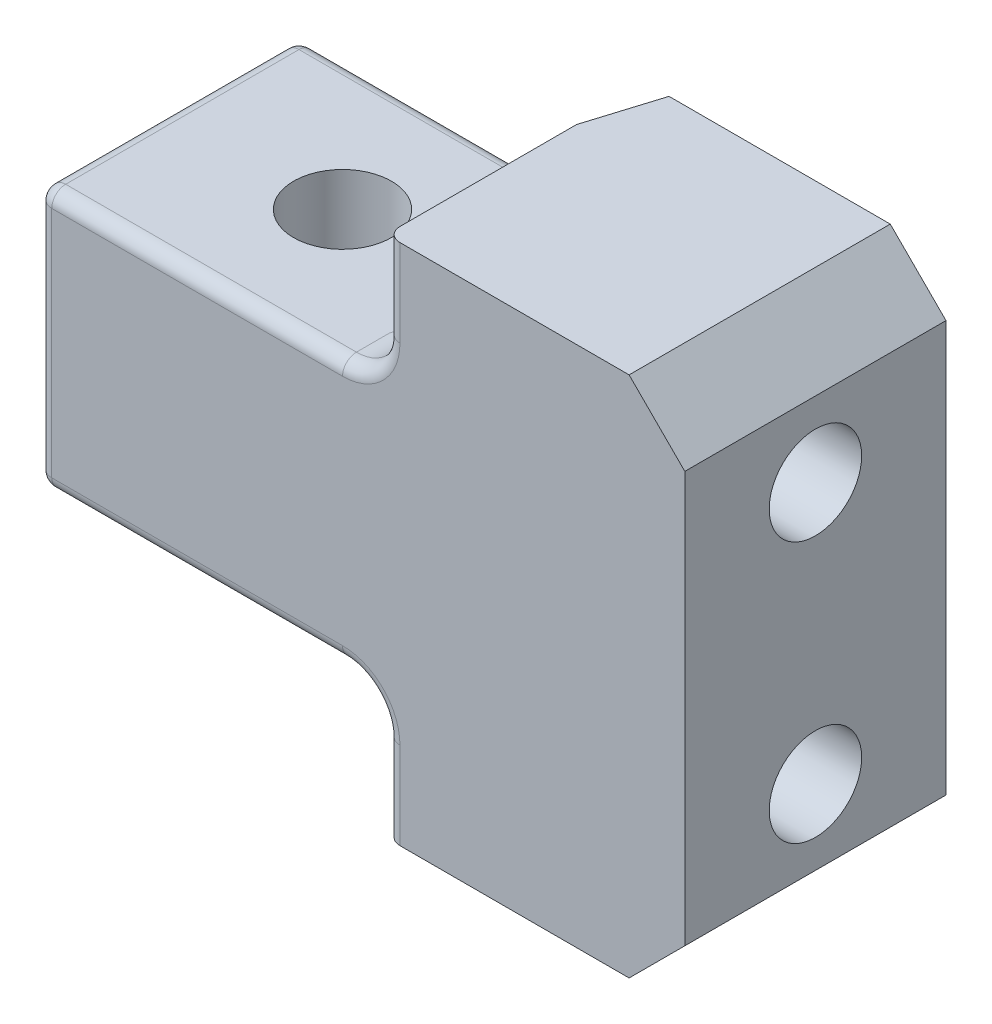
ISO-10303-21;
HEADER;
FILE_DESCRIPTION(('STEP AP214'),'2;1');
FILE_NAME('part.step','',(''),(''),'','','');
FILE_SCHEMA(('AUTOMOTIVE_DESIGN { 1 0 10303 214 1 1 1 1 }'));
ENDSEC;
DATA;
#1=APPLICATION_CONTEXT('core data for automotive mechanical design processes');
#2=APPLICATION_PROTOCOL_DEFINITION('international standard','automotive_design',2000,#1);
#3=PRODUCT_CONTEXT('',#1,'mechanical');
#4=PRODUCT('Part','Part','',(#3));
#5=PRODUCT_RELATED_PRODUCT_CATEGORY('part','',(#4));
#6=PRODUCT_DEFINITION_FORMATION('','',#4);
#7=PRODUCT_DEFINITION_CONTEXT('part definition',#1,'design');
#8=PRODUCT_DEFINITION('design','',#6,#7);
#9=PRODUCT_DEFINITION_SHAPE('','',#8);
#10=(LENGTH_UNIT() NAMED_UNIT(*) SI_UNIT(.MILLI.,.METRE.));
#11=(NAMED_UNIT(*) PLANE_ANGLE_UNIT() SI_UNIT($,.RADIAN.));
#12=(NAMED_UNIT(*) SI_UNIT($,.STERADIAN.) SOLID_ANGLE_UNIT());
#13=UNCERTAINTY_MEASURE_WITH_UNIT(LENGTH_MEASURE(1.E-05),#10,'distance_accuracy_value','');
#14=(GEOMETRIC_REPRESENTATION_CONTEXT(3) GLOBAL_UNCERTAINTY_ASSIGNED_CONTEXT((#13)) GLOBAL_UNIT_ASSIGNED_CONTEXT((#10,
#11,#12)) REPRESENTATION_CONTEXT('',''));
#15=CARTESIAN_POINT('',(0.,0.,0.));
#16=DIRECTION('',(0.,0.,1.));
#17=DIRECTION('',(1.,0.,0.));
#18=AXIS2_PLACEMENT_3D('',#15,#16,#17);
#19=CARTESIAN_POINT('',(22.225,12.7,9.525));
#20=DIRECTION('',(0.,0.,-1.));
#21=DIRECTION('',(-1.,0.,0.));
#22=AXIS2_PLACEMENT_3D('',#19,#20,#21);
#23=CYLINDRICAL_SURFACE('',#22,3.17500000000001);
#24=CARTESIAN_POINT('',(22.225,9.52499999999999,6.10455036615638));
#25=CARTESIAN_POINT('',(22.3009504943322,9.52501417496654,5.85055313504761));
#26=CARTESIAN_POINT('',(22.3769692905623,9.52772596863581,5.59657349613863));
#27=CARTESIAN_POINT('',(22.5292247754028,9.53868207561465,5.08837771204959));
#28=CARTESIAN_POINT('',(22.6054616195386,9.54693480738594,4.8341617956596));
#29=CARTESIAN_POINT('',(22.758072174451,9.56912088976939,4.32576547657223));
#30=CARTESIAN_POINT('',(22.8344459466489,9.58305938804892,4.07158531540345));
#31=CARTESIAN_POINT('',(22.9872470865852,9.61686333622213,3.56353732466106));
#32=CARTESIAN_POINT('',(23.0636744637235,9.63673082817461,3.3096696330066));
#33=CARTESIAN_POINT('',(23.2167945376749,9.68281825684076,2.80154357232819));
#34=CARTESIAN_POINT('',(23.2934871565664,9.70906169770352,2.54728729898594));
#35=CARTESIAN_POINT('',(23.446764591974,9.7683335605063,2.03962494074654));
#36=CARTESIAN_POINT('',(23.5233494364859,9.80135964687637,1.78621859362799));
#37=CARTESIAN_POINT('',(23.6763203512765,9.87484650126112,1.28055130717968));
#38=CARTESIAN_POINT('',(23.7527064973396,9.91530381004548,1.0282898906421));
#39=CARTESIAN_POINT('',(23.9051833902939,10.004555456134,0.525224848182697));
#40=CARTESIAN_POINT('',(23.9812742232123,10.0533471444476,0.274420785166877));
#41=CARTESIAN_POINT('',(24.0974796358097,10.1354579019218,-0.108241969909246));
#42=CARTESIAN_POINT('',(24.1377540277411,10.1653218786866,-0.240797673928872));
#43=CARTESIAN_POINT('',(24.2181444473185,10.2280368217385,-0.505254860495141));
#44=CARTESIAN_POINT('',(24.258260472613,10.2608878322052,-0.637156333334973));
#45=CARTESIAN_POINT('',(24.33828645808,10.3298868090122,-0.900150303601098));
#46=CARTESIAN_POINT('',(24.378196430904,10.3660345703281,-1.03124285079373));
#47=CARTESIAN_POINT('',(24.4577534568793,10.4420220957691,-1.29243482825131));
#48=CARTESIAN_POINT('',(24.4974005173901,10.4818617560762,-1.42253428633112));
#49=CARTESIAN_POINT('',(24.5749277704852,10.5642221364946,-1.67681049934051));
#50=CARTESIAN_POINT('',(24.6128200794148,10.6065941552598,-1.80103151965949));
#51=CARTESIAN_POINT('',(24.6881854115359,10.6958156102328,-2.0479835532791));
#52=CARTESIAN_POINT('',(24.7256584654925,10.742664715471,-2.17071467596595));
#53=CARTESIAN_POINT('',(24.800052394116,10.8416231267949,-2.41425637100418));
#54=CARTESIAN_POINT('',(24.836973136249,10.893733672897,-2.53506648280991));
#55=CARTESIAN_POINT('',(24.9100311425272,11.0042318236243,-2.77401536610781));
#56=CARTESIAN_POINT('',(24.9461686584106,11.0626173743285,-2.8921549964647));
#57=CARTESIAN_POINT('',(25.0028913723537,11.161899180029,-3.07751030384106));
#58=CARTESIAN_POINT('',(25.0238426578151,11.2002907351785,-3.14595553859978));
#59=CARTESIAN_POINT('',(25.0652304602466,11.2802308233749,-3.28112998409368));
#60=CARTESIAN_POINT('',(25.0856670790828,11.3217787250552,-3.34785953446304));
#61=CARTESIAN_POINT('',(25.1258544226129,11.4085078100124,-3.47904679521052));
#62=CARTESIAN_POINT('',(25.145605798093,11.4536854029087,-3.5435066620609));
#63=CARTESIAN_POINT('',(25.1842063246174,11.5483343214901,-3.6694523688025));
#64=CARTESIAN_POINT('',(25.2030559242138,11.5978034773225,-3.73093968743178));
#65=CARTESIAN_POINT('',(25.241952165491,11.7087700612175,-3.85779115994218));
#66=CARTESIAN_POINT('',(25.2618249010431,11.7709922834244,-3.92258432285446));
#67=CARTESIAN_POINT('',(25.2992112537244,11.903395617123,-4.04445203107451));
#68=CARTESIAN_POINT('',(25.3167261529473,11.97357236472,-4.1015307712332));
#69=CARTESIAN_POINT('',(25.3438529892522,12.1029340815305,-4.18991794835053));
#70=CARTESIAN_POINT('',(25.3543233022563,12.159995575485,-4.22402791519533));
#71=CARTESIAN_POINT('',(25.3725125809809,12.278842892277,-4.28327873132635));
#72=CARTESIAN_POINT('',(25.3802434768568,12.3406067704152,-4.30845847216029));
#73=CARTESIAN_POINT('',(25.3906468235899,12.4518468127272,-4.34234059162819));
#74=CARTESIAN_POINT('',(25.3941055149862,12.5004565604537,-4.35360425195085));
#75=CARTESIAN_POINT('',(25.3976163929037,12.5744985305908,-4.36503767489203));
#76=CARTESIAN_POINT('',(25.3985073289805,12.5994869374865,-4.36793902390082));
#77=CARTESIAN_POINT('',(25.3997002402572,12.6496466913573,-4.37182373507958));
#78=CARTESIAN_POINT('',(25.4000017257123,12.6748181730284,-4.3728055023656));
#79=CARTESIAN_POINT('',(25.4,12.7,-4.37279989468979));
#80=B_SPLINE_CURVE_WITH_KNOTS('',3,(#24,#25,#26,#27,#28,#29,#30,#31,#32,#33,#34,#35,#36,#37,#38,
#39,#40,#41,#42,#43,#44,#45,#46,#47,#48,#49,#50,#51,#52,#53,#54,#55,#56,#57,#58,#59,#60,#61,#62,
#63,#64,#65,#66,#67,#68,#69,#70,#71,#72,#73,#74,#75,#76,#77,#78,#79),.UNSPECIFIED.,.F.,.F.,(4,2,
2,2,2,2,2,2,2,2,2,2,2,2,2,2,2,2,2,2,2,2,2,2,2,2,2,4),(0.,0.795319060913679,1.59184920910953,
2.38910211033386,3.18662991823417,3.98714355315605,4.78738199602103,5.58724886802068,
6.38686198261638,6.81199870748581,7.2371417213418,7.66225831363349,8.08736295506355,
8.49712165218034,8.90685008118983,9.31667530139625,9.72636678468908,9.96997971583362,
10.2135440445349,10.4568703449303,10.7000743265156,10.9756041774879,11.2509835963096,
11.4522632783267,11.6526552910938,11.802119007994,11.8775617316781,11.9530671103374),.UNSPECIFIED.);
#81=CARTESIAN_POINT('',(22.224999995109,9.52500000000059,6.10455038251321));
#82=VERTEX_POINT('',#81);
#83=CARTESIAN_POINT('',(25.4,12.7,-4.37279989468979));
#84=VERTEX_POINT('',#83);
#85=EDGE_CURVE('E283',#82,#84,#80,.T.);
#86=ORIENTED_EDGE('',*,*,#85,.F.);
#87=DIRECTION('',(0.,0.,-1.));
#88=VECTOR('',#87,1.);
#89=CARTESIAN_POINT('',(22.225,9.525,9.525));
#90=LINE('',#89,#88);
#91=CARTESIAN_POINT('',(22.225,9.525,8.509));
#92=VERTEX_POINT('',#91);
#93=EDGE_CURVE('E239',#92,#82,#90,.T.);
#94=ORIENTED_EDGE('',*,*,#93,.F.);
#95=CARTESIAN_POINT('',(22.225,12.7,8.509));
#96=DIRECTION('',(0.,0.,1.));
#97=DIRECTION('',(1.,0.,0.));
#98=AXIS2_PLACEMENT_3D('',#95,#96,#97);
#99=CIRCLE('',#98,3.17500000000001);
#100=CARTESIAN_POINT('',(25.4,12.7,8.509));
#101=VERTEX_POINT('',#100);
#102=EDGE_CURVE('E487',#92,#101,#99,.T.);
#103=ORIENTED_EDGE('',*,*,#102,.T.);
#104=DIRECTION('',(0.,0.,-1.));
#105=VECTOR('',#104,1.);
#106=CARTESIAN_POINT('',(25.4,12.7,9.525));
#107=LINE('',#106,#105);
#108=EDGE_CURVE('E423',#101,#84,#107,.T.);
#109=ORIENTED_EDGE('',*,*,#108,.T.);
#110=EDGE_LOOP('',(#86,#94,#103,#109));
#111=FACE_BOUND('',#110,.T.);
#112=ADVANCED_FACE('F32',(#111),#23,.F.);
#113=CARTESIAN_POINT('',(22.225,-12.7,9.525));
#114=DIRECTION('',(0.,0.,-1.));
#115=DIRECTION('',(-1.,0.,0.));
#116=AXIS2_PLACEMENT_3D('',#113,#114,#115);
#117=CYLINDRICAL_SURFACE('',#116,3.17500000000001);
#118=CARTESIAN_POINT('',(25.4,-12.7,-4.37279988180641));
#119=CARTESIAN_POINT('',(25.4000054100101,-12.6689716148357,-4.37281746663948));
#120=CARTESIAN_POINT('',(25.3995453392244,-12.6379544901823,-4.37131928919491));
#121=CARTESIAN_POINT('',(25.3977365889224,-12.5762710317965,-4.3654290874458));
#122=CARTESIAN_POINT('',(25.3963893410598,-12.5456042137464,-4.3610417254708));
#123=CARTESIAN_POINT('',(25.3928734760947,-12.4852792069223,-4.34959188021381));
#124=CARTESIAN_POINT('',(25.390716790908,-12.4556128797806,-4.34256825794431));
#125=CARTESIAN_POINT('',(25.3856491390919,-12.3970352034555,-4.32606396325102));
#126=CARTESIAN_POINT('',(25.3827378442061,-12.368124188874,-4.31658222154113));
#127=CARTESIAN_POINT('',(25.3713828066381,-12.2687396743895,-4.27959855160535));
#128=CARTESIAN_POINT('',(25.361163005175,-12.2005790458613,-4.24630973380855));
#129=CARTESIAN_POINT('',(25.3376671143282,-12.0704290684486,-4.16976401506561));
#130=CARTESIAN_POINT('',(25.3243730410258,-12.0084792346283,-4.12644845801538));
#131=CARTESIAN_POINT('',(25.2974519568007,-11.8978227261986,-4.03871556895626));
#132=CARTESIAN_POINT('',(25.2840647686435,-11.8484231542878,-3.99508171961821));
#133=CARTESIAN_POINT('',(25.2561002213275,-11.7536918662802,-3.90391824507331));
#134=CARTESIAN_POINT('',(25.2415218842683,-11.7083635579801,-3.85638541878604));
#135=CARTESIAN_POINT('',(25.211465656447,-11.62121605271,-3.75836789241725));
#136=CARTESIAN_POINT('',(25.1959864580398,-11.5794021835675,-3.70787890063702));
#137=CARTESIAN_POINT('',(25.164363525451,-11.4989038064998,-3.60471268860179));
#138=CARTESIAN_POINT('',(25.1482200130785,-11.460218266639,-3.55203619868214));
#139=CARTESIAN_POINT('',(25.0992306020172,-11.3486982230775,-3.39214988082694));
#140=CARTESIAN_POINT('',(25.0656193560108,-11.2798265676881,-3.28240992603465));
#141=CARTESIAN_POINT('',(24.9970526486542,-11.1502554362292,-3.05844361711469));
#142=CARTESIAN_POINT('',(24.9620949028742,-11.0895707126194,-2.94420963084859));
#143=CARTESIAN_POINT('',(24.8912604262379,-10.9748257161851,-2.71263521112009));
#144=CARTESIAN_POINT('',(24.8553829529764,-10.9207710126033,-2.59529226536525));
#145=CARTESIAN_POINT('',(24.7826191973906,-10.8176536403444,-2.35719855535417));
#146=CARTESIAN_POINT('',(24.7457263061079,-10.7686486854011,-2.23642504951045));
#147=CARTESIAN_POINT('',(24.6715065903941,-10.6754573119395,-1.99334421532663));
#148=CARTESIAN_POINT('',(24.6341803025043,-10.6312655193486,-1.87103877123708));
#149=CARTESIAN_POINT('',(24.5591844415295,-10.5470060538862,-1.62518742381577));
#150=CARTESIAN_POINT('',(24.521515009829,-10.5069367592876,-1.50164202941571));
#151=CARTESIAN_POINT('',(24.4199046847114,-10.404072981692,-1.16822986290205));
#152=CARTESIAN_POINT('',(24.3557081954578,-10.3445956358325,-0.957416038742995));
#153=CARTESIAN_POINT('',(24.2267709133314,-10.2340854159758,-0.533657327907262));
#154=CARTESIAN_POINT('',(24.1620298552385,-10.1830569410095,-0.320711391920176));
#155=CARTESIAN_POINT('',(24.0321250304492,-10.0882196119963,0.106920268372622));
#156=CARTESIAN_POINT('',(23.9669608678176,-10.0444190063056,0.321607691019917));
#157=CARTESIAN_POINT('',(23.8363189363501,-9.96317758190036,0.7523701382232));
#158=CARTESIAN_POINT('',(23.7708408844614,-9.92574448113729,0.96844652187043));
#159=CARTESIAN_POINT('',(23.6396667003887,-9.85661412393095,1.40167746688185));
#160=CARTESIAN_POINT('',(23.573970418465,-9.82492245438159,1.61883286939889));
#161=CARTESIAN_POINT('',(23.4424471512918,-9.76680750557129,2.05393733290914));
#162=CARTESIAN_POINT('',(23.3766201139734,-9.74038713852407,2.27188676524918));
#163=CARTESIAN_POINT('',(23.2501788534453,-9.6943737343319,2.69087622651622));
#164=CARTESIAN_POINT('',(23.1895682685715,-9.67440390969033,2.89187625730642));
#165=CARTESIAN_POINT('',(23.0683688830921,-9.63840763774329,3.29411200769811));
#166=CARTESIAN_POINT('',(23.007780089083,-9.62237900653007,3.49534753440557));
#167=CARTESIAN_POINT('',(22.8866945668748,-9.59409505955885,3.89782095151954));
#168=CARTESIAN_POINT('',(22.8261978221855,-9.58183482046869,4.09905849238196));
#169=CARTESIAN_POINT('',(22.7053658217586,-9.56095173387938,4.50130445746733));
#170=CARTESIAN_POINT('',(22.6450304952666,-9.55232124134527,4.70231246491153));
#171=CARTESIAN_POINT('',(22.5245901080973,-9.53858641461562,5.10386854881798));
#172=CARTESIAN_POINT('',(22.464484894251,-9.53347172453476,5.30441622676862));
#173=CARTESIAN_POINT('',(22.3445726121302,-9.52668775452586,5.70482237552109));
#174=CARTESIAN_POINT('',(22.2847652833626,-9.52500535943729,5.90468054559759));
#175=CARTESIAN_POINT('',(22.225,-9.525,6.10455037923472));
#176=B_SPLINE_CURVE_WITH_KNOTS('',3,(#118,#119,#120,#121,#122,#123,#124,#125,#126,#127,#128,
#129,#130,#131,#132,#133,#134,#135,#136,#137,#138,#139,#140,#141,#142,#143,#144,#145,#146,#147,
#148,#149,#150,#151,#152,#153,#154,#155,#156,#157,#158,#159,#160,#161,#162,#163,#164,#165,#166,
#167,#168,#169,#170,#171,#172,#173,#174,#175),.UNSPECIFIED.,.F.,.F.,(4,2,2,2,2,2,2,2,2,2,2,2,2,
2,2,2,2,2,2,2,2,2,2,2,2,2,2,2,4),(0.,0.0930274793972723,0.185905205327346,0.27746441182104,
0.369063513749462,0.597259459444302,0.826825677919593,1.02829922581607,1.22993987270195,
1.43188088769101,1.63375501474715,2.03479098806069,2.43654022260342,2.83862464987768,
3.24488746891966,3.65069192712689,4.05633613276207,4.74088205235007,5.42578327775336,
6.11146077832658,6.79796354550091,7.48513079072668,8.17267662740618,8.80530028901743,
9.43757260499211,10.0690153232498,10.6991213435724,11.3273633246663,11.9532001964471),.UNSPECIFIED.);
#177=CARTESIAN_POINT('',(25.4,-12.7,-4.37279988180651));
#178=VERTEX_POINT('',#177);
#179=CARTESIAN_POINT('',(22.2249999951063,-9.52500000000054,6.10455039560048));
#180=VERTEX_POINT('',#179);
#181=EDGE_CURVE('E663',#178,#180,#176,.T.);
#182=ORIENTED_EDGE('',*,*,#181,.F.);
#183=DIRECTION('',(0.,0.,-1.));
#184=VECTOR('',#183,1.);
#185=CARTESIAN_POINT('',(25.4,-12.7,9.525));
#186=LINE('',#185,#184);
#187=CARTESIAN_POINT('',(25.4,-12.7,8.509));
#188=VERTEX_POINT('',#187);
#189=EDGE_CURVE('E426',#188,#178,#186,.T.);
#190=ORIENTED_EDGE('',*,*,#189,.F.);
#191=CARTESIAN_POINT('',(22.225,-12.7,8.509));
#192=DIRECTION('',(0.,0.,1.));
#193=DIRECTION('',(1.,0.,0.));
#194=AXIS2_PLACEMENT_3D('',#191,#192,#193);
#195=CIRCLE('',#194,3.17500000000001);
#196=CARTESIAN_POINT('',(22.225,-9.525,8.509));
#197=VERTEX_POINT('',#196);
#198=EDGE_CURVE('E489',#188,#197,#195,.T.);
#199=ORIENTED_EDGE('',*,*,#198,.T.);
#200=DIRECTION('',(0.,0.,-1.));
#201=VECTOR('',#200,1.);
#202=CARTESIAN_POINT('',(22.225,-9.525,9.525));
#203=LINE('',#202,#201);
#204=EDGE_CURVE('E434',#197,#180,#203,.T.);
#205=ORIENTED_EDGE('',*,*,#204,.T.);
#206=EDGE_LOOP('',(#182,#190,#199,#205));
#207=FACE_BOUND('',#206,.T.);
#208=ADVANCED_FACE('F299',(#207),#117,.F.);
#209=CARTESIAN_POINT('',(25.4,-12.7,9.525));
#210=DIRECTION('',(1.,0.,0.));
#211=DIRECTION('',(0.,1.,0.));
#212=AXIS2_PLACEMENT_3D('',#209,#210,#211);
#213=PLANE('',#212);
#214=DIRECTION('',(0.,1.,0.));
#215=VECTOR('',#214,1.);
#216=CARTESIAN_POINT('',(25.4,-15.8750000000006,-4.37279988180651));
#217=LINE('',#216,#215);
#218=CARTESIAN_POINT('',(25.3999999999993,-19.05,-4.37279988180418));
#219=VERTEX_POINT('',#218);
#220=EDGE_CURVE('E662',#219,#178,#217,.T.);
#221=ORIENTED_EDGE('',*,*,#220,.F.);
#222=DIRECTION('',(0.,0.,-1.));
#223=VECTOR('',#222,1.);
#224=CARTESIAN_POINT('',(25.4,-19.05,9.525));
#225=LINE('',#224,#223);
#226=CARTESIAN_POINT('',(25.4,-19.05,8.509));
#227=VERTEX_POINT('',#226);
#228=EDGE_CURVE('E422',#227,#219,#225,.T.);
#229=ORIENTED_EDGE('',*,*,#228,.F.);
#230=DIRECTION('',(0.,-1.,0.));
#231=VECTOR('',#230,1.);
#232=CARTESIAN_POINT('',(25.4,-12.7,8.509));
#233=LINE('',#232,#231);
#234=EDGE_CURVE('E485',#227,#188,#233,.F.);
#235=ORIENTED_EDGE('',*,*,#234,.T.);
#236=ORIENTED_EDGE('',*,*,#189,.T.);
#237=EDGE_LOOP('',(#221,#229,#235,#236));
#238=FACE_BOUND('',#237,.T.);
#239=ADVANCED_FACE('F685',(#238),#213,.F.);
#240=CARTESIAN_POINT('',(25.4,19.05,9.525));
#241=DIRECTION('',(0.,-1.,0.));
#242=DIRECTION('',(0.,0.,-1.));
#243=AXIS2_PLACEMENT_3D('',#240,#241,#242);
#244=PLANE('',#243);
#245=CARTESIAN_POINT('',(-72.8322376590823,19.049999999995,2012.81034212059));
#246=CARTESIAN_POINT('',(-78.5281653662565,19.0499999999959,1655.11775366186));
#247=CARTESIAN_POINT('',(-78.1954852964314,19.0499999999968,1297.53789233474));
#248=CARTESIAN_POINT('',(-78.2140301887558,19.0499999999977,933.878670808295));
#249=CARTESIAN_POINT('',(-78.2008987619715,19.0499999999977,927.80612360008));
#250=CARTESIAN_POINT('',(-78.1414561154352,19.0499999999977,915.661649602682));
#251=CARTESIAN_POINT('',(-78.0065730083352,19.0499999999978,897.445793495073));
#252=CARTESIAN_POINT('',(-77.7453439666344,19.0499999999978,879.232299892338));
#253=CARTESIAN_POINT('',(-77.0831142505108,19.0499999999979,842.807926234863));
#254=CARTESIAN_POINT('',(-76.4553036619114,19.049999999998,818.528494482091));
#255=CARTESIAN_POINT('',(-74.9789938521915,19.0499999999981,769.973757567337));
#256=CARTESIAN_POINT('',(-74.1401653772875,19.0499999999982,745.698271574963));
#257=CARTESIAN_POINT('',(-72.2201917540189,19.0499999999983,697.151830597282));
#258=CARTESIAN_POINT('',(-71.1376401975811,19.0499999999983,672.881862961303));
#259=CARTESIAN_POINT('',(-68.6785112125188,19.0499999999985,624.367159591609));
#260=CARTESIAN_POINT('',(-67.3026407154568,19.0499999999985,600.120281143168));
#261=CARTESIAN_POINT('',(-64.1983744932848,19.0499999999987,551.651759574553));
#262=CARTESIAN_POINT('',(-62.4697777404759,19.0499999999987,527.430130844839));
#263=CARTESIAN_POINT('',(-58.5978607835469,19.0499999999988,479.016561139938));
#264=CARTESIAN_POINT('',(-56.4484038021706,19.0499999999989,454.82505946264));
#265=CARTESIAN_POINT('',(-52.9064075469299,19.049999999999,418.560557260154));
#266=CARTESIAN_POINT('',(-51.6734216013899,19.049999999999,406.476135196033));
#267=CARTESIAN_POINT('',(-49.1054156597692,19.0499999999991,382.314595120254));
#268=CARTESIAN_POINT('',(-47.7737636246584,19.0499999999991,370.243781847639));
#269=CARTESIAN_POINT('',(-43.6041814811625,19.0499999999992,334.073418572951));
#270=CARTESIAN_POINT('',(-40.5848320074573,19.0499999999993,310.015397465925));
#271=CARTESIAN_POINT('',(-33.8025125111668,19.0499999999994,262.071753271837));
#272=CARTESIAN_POINT('',(-30.0300083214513,19.0499999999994,238.188340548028));
#273=CARTESIAN_POINT('',(-23.8003451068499,19.0499999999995,202.495578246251));
#274=CARTESIAN_POINT('',(-21.6288468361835,19.0499999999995,190.620002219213));
#275=CARTESIAN_POINT('',(-17.0965254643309,19.0499999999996,166.912742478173));
#276=CARTESIAN_POINT('',(-14.735503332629,19.0499999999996,155.081104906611));
#277=CARTESIAN_POINT('',(-7.33253325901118,19.0499999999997,119.660357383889));
#278=CARTESIAN_POINT('',(-1.9705367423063,19.0499999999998,96.1454462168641));
#279=CARTESIAN_POINT('',(9.79702360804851,19.0499999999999,49.3575603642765));
#280=CARTESIAN_POINT('',(16.1988881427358,19.05,26.0837280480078));
#281=CARTESIAN_POINT('',(26.661884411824,19.05,-8.62759521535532));
#282=CARTESIAN_POINT('',(30.2937474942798,19.0500000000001,-20.164606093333));
#283=CARTESIAN_POINT('',(37.8560097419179,19.0500000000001,-43.1694164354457));
#284=CARTESIAN_POINT('',(45.7136435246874,19.0500000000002,-66.1057490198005));
#285=CARTESIAN_POINT('',(54.1504411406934,19.0500000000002,-88.907810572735));
#286=CARTESIAN_POINT('',(60.6912550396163,19.0500000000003,-105.95992566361));
#287=CARTESIAN_POINT('',(62.9070661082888,19.0500000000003,-111.635724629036));
#288=CARTESIAN_POINT('',(152.564495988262,19.0500000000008,-337.373455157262));
#289=CARTESIAN_POINT('',(291.325141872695,19.0500000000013,-545.537788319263));
#290=CARTESIAN_POINT('',(936.888297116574,19.0500000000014,-636.207050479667));
#291=B_SPLINE_CURVE_WITH_KNOTS('',3,(#245,#246,#247,#248,#249,#250,#251,#252,#253,#254,#255,
#256,#257,#258,#259,#260,#261,#262,#263,#264,#265,#266,#267,#268,#269,#270,#271,#272,#273,#274,
#275,#276,#277,#278,#279,#280,#281,#282,#283,#284,#285,#286,#287,#288,#289,#290),.UNSPECIFIED.,
.F.,.F.,(4,2,2,1,2,2,2,2,2,2,2,2,2,2,2,2,2,2,2,2,1,2,2,4),(-0.857551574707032,
0.0625000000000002,0.0781250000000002,0.0937500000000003,0.125,0.187500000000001,
0.250000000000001,0.312500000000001,0.375000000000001,0.437500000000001,0.500000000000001,
0.531250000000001,0.562500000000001,0.625000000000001,0.687500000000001,0.718750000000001,
0.750000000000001,0.812500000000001,0.875000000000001,0.90625,0.9375,0.96875,0.984375,
1.59108268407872),.UNSPECIFIED.);
#292=CARTESIAN_POINT('',(25.3999999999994,19.05,-4.3727998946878));
#293=VERTEX_POINT('',#292);
#294=CARTESIAN_POINT('',(26.9924763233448,19.05,-9.52499999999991));
#295=VERTEX_POINT('',#294);
#296=EDGE_CURVE('E228',#293,#295,#291,.T.);
#297=ORIENTED_EDGE('',*,*,#296,.F.);
#298=DIRECTION('',(0.,0.,-1.));
#299=VECTOR('',#298,1.);
#300=CARTESIAN_POINT('',(25.4,19.05,9.525));
#301=LINE('',#300,#299);
#302=CARTESIAN_POINT('',(25.4,19.05,8.509));
#303=VERTEX_POINT('',#302);
#304=EDGE_CURVE('E415',#303,#293,#301,.T.);
#305=ORIENTED_EDGE('',*,*,#304,.F.);
#306=CARTESIAN_POINT('',(26.416,19.05,8.509));
#307=DIRECTION('',(0.,-1.,0.));
#308=DIRECTION('',(0.,0.,-1.));
#309=AXIS2_PLACEMENT_3D('',#306,#307,#308);
#310=CIRCLE('',#309,1.016);
#311=CARTESIAN_POINT('',(26.416,19.05,9.525));
#312=VERTEX_POINT('',#311);
#313=EDGE_CURVE('E467',#303,#312,#310,.F.);
#314=ORIENTED_EDGE('',*,*,#313,.T.);
#315=DIRECTION('',(-1.,0.,0.));
#316=VECTOR('',#315,1.);
#317=CARTESIAN_POINT('',(25.4,19.05,9.525));
#318=LINE('',#317,#316);
#319=CARTESIAN_POINT('',(43.130661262,19.05,9.525));
#320=VERTEX_POINT('',#319);
#321=EDGE_CURVE('E428',#320,#312,#318,.T.);
#322=ORIENTED_EDGE('',*,*,#321,.F.);
#323=DIRECTION('',(0.,0.,-1.));
#324=VECTOR('',#323,1.);
#325=CARTESIAN_POINT('',(43.130661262,19.05,9.525));
#326=LINE('',#325,#324);
#327=CARTESIAN_POINT('',(43.130661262,19.05,-9.525));
#328=VERTEX_POINT('',#327);
#329=EDGE_CURVE('E438',#320,#328,#326,.T.);
#330=ORIENTED_EDGE('',*,*,#329,.T.);
#331=DIRECTION('',(-1.,0.,0.));
#332=VECTOR('',#331,1.);
#333=CARTESIAN_POINT('',(25.4,19.05,-9.525));
#334=LINE('',#333,#332);
#335=EDGE_CURVE('E418',#328,#295,#334,.T.);
#336=ORIENTED_EDGE('',*,*,#335,.T.);
#337=EDGE_LOOP('',(#297,#305,#314,#322,#330,#336));
#338=FACE_BOUND('',#337,.T.);
#339=ADVANCED_FACE('F414',(#338),#244,.F.);
#340=CARTESIAN_POINT('',(25.4,12.7,9.525));
#341=DIRECTION('',(1.,0.,0.));
#342=DIRECTION('',(0.,1.,0.));
#343=AXIS2_PLACEMENT_3D('',#340,#341,#342);
#344=PLANE('',#343);
#345=DIRECTION('',(0.,-1.,0.));
#346=VECTOR('',#345,1.);
#347=CARTESIAN_POINT('',(25.4,15.8750000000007,-4.37279989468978));
#348=LINE('',#347,#346);
#349=EDGE_CURVE('E292',#84,#293,#348,.F.);
#350=ORIENTED_EDGE('',*,*,#349,.F.);
#351=ORIENTED_EDGE('',*,*,#108,.F.);
#352=DIRECTION('',(0.,-1.,0.));
#353=VECTOR('',#352,1.);
#354=CARTESIAN_POINT('',(25.4,19.05,8.509));
#355=LINE('',#354,#353);
#356=EDGE_CURVE('E421',#101,#303,#355,.F.);
#357=ORIENTED_EDGE('',*,*,#356,.T.);
#358=ORIENTED_EDGE('',*,*,#304,.T.);
#359=EDGE_LOOP('',(#350,#351,#357,#358));
#360=FACE_BOUND('',#359,.T.);
#361=ADVANCED_FACE('F419',(#360),#344,.F.);
#362=CARTESIAN_POINT('',(22.225,12.7,-9.525));
#363=DIRECTION('',(0.,0.,1.));
#364=DIRECTION('',(1.,0.,0.));
#365=AXIS2_PLACEMENT_3D('',#362,#363,#364);
#366=PLANE('',#365);
#367=CARTESIAN_POINT('',(22.225,12.7,-9.525));
#368=DIRECTION('',(0.,0.,1.));
#369=DIRECTION('',(1.,0.,0.));
#370=AXIS2_PLACEMENT_3D('',#367,#368,#369);
#371=CIRCLE('',#370,4.19100000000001);
#372=CARTESIAN_POINT('',(22.225,8.509,-9.525));
#373=VERTEX_POINT('',#372);
#374=CARTESIAN_POINT('',(24.9606637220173,9.52499999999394,-9.525));
#375=VERTEX_POINT('',#374);
#376=EDGE_CURVE('E53',#373,#375,#371,.T.);
#377=ORIENTED_EDGE('',*,*,#376,.T.);
#378=DIRECTION('',(1.,0.,-4.39035754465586E-12));
#379=VECTOR('',#378,1.);
#380=CARTESIAN_POINT('',(53.2985716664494,9.52500000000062,-9.52499999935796));
#381=LINE('',#380,#379);
#382=CARTESIAN_POINT('',(26.992476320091,9.52500000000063,-9.52499998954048));
#383=VERTEX_POINT('',#382);
#384=EDGE_CURVE('E237',#375,#383,#381,.T.);
#385=ORIENTED_EDGE('',*,*,#384,.T.);
#386=DIRECTION('',(0.,-1.,0.));
#387=VECTOR('',#386,1.);
#388=CARTESIAN_POINT('',(26.9924763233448,15.8750000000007,-9.52499999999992));
#389=LINE('',#388,#387);
#390=EDGE_CURVE('E222',#295,#383,#389,.T.);
#391=ORIENTED_EDGE('',*,*,#390,.F.);
#392=ORIENTED_EDGE('',*,*,#335,.F.);
#393=DIRECTION('',(-0.707106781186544,0.707106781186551,0.));
#394=VECTOR('',#393,1.);
#395=CARTESIAN_POINT('',(43.130661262,19.05,-9.525));
#396=LINE('',#395,#394);
#397=CARTESIAN_POINT('',(47.194661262,14.9859999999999,-9.525));
#398=VERTEX_POINT('',#397);
#399=EDGE_CURVE('E443',#328,#398,#396,.F.);
#400=ORIENTED_EDGE('',*,*,#399,.T.);
#401=DIRECTION('',(0.,1.,0.));
#402=VECTOR('',#401,1.);
#403=CARTESIAN_POINT('',(47.194661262,-19.05,-9.525));
#404=LINE('',#403,#402);
#405=CARTESIAN_POINT('',(47.194661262,-14.9859999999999,-9.525));
#406=VERTEX_POINT('',#405);
#407=EDGE_CURVE('E580',#406,#398,#404,.T.);
#408=ORIENTED_EDGE('',*,*,#407,.F.);
#409=DIRECTION('',(0.707106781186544,0.707106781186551,0.));
#410=VECTOR('',#409,1.);
#411=CARTESIAN_POINT('',(47.194661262,-14.9859999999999,-9.525));
#412=LINE('',#411,#410);
#413=CARTESIAN_POINT('',(43.130661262,-19.05,-9.525));
#414=VERTEX_POINT('',#413);
#415=EDGE_CURVE('E440',#406,#414,#412,.F.);
#416=ORIENTED_EDGE('',*,*,#415,.T.);
#417=DIRECTION('',(1.,0.,0.));
#418=VECTOR('',#417,1.);
#419=CARTESIAN_POINT('',(25.4,-19.05,-9.525));
#420=LINE('',#419,#418);
#421=CARTESIAN_POINT('',(26.9924763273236,-19.05,-9.52500000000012));
#422=VERTEX_POINT('',#421);
#423=EDGE_CURVE('E564',#422,#414,#420,.T.);
#424=ORIENTED_EDGE('',*,*,#423,.F.);
#425=DIRECTION('',(0.,1.,0.));
#426=VECTOR('',#425,1.);
#427=CARTESIAN_POINT('',(26.9924763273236,-15.8750000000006,-9.52500000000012));
#428=LINE('',#427,#426);
#429=CARTESIAN_POINT('',(26.992476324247,-9.52500000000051,-9.52499999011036));
#430=VERTEX_POINT('',#429);
#431=EDGE_CURVE('E291',#430,#422,#428,.F.);
#432=ORIENTED_EDGE('',*,*,#431,.F.);
#433=DIRECTION('',(1.,0.,0.));
#434=VECTOR('',#433,1.);
#435=CARTESIAN_POINT('',(53.2985716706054,-9.52500000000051,-9.52499999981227));
#436=LINE('',#435,#434);
#437=CARTESIAN_POINT('',(24.9606637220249,-9.52500000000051,-9.52499999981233));
#438=VERTEX_POINT('',#437);
#439=EDGE_CURVE('E240',#438,#430,#436,.T.);
#440=ORIENTED_EDGE('',*,*,#439,.F.);
#441=CARTESIAN_POINT('',(22.225,-12.7,-9.525));
#442=DIRECTION('',(0.,0.,1.));
#443=DIRECTION('',(1.,0.,0.));
#444=AXIS2_PLACEMENT_3D('',#441,#442,#443);
#445=CIRCLE('',#444,4.19100000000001);
#446=CARTESIAN_POINT('',(22.225,-8.509,-9.525));
#447=VERTEX_POINT('',#446);
#448=EDGE_CURVE('E464',#438,#447,#445,.T.);
#449=ORIENTED_EDGE('',*,*,#448,.T.);
#450=DIRECTION('',(1.,0.,0.));
#451=VECTOR('',#450,1.);
#452=CARTESIAN_POINT('',(22.225,-8.509,-9.525));
#453=LINE('',#452,#451);
#454=CARTESIAN_POINT('',(1.016,-8.509,-9.525));
#455=VERTEX_POINT('',#454);
#456=EDGE_CURVE('E460',#447,#455,#453,.F.);
#457=ORIENTED_EDGE('',*,*,#456,.T.);
#458=DIRECTION('',(0.,-1.,0.));
#459=VECTOR('',#458,1.);
#460=CARTESIAN_POINT('',(1.016,12.7,-9.525));
#461=LINE('',#460,#459);
#462=CARTESIAN_POINT('',(1.016,8.509,-9.525));
#463=VERTEX_POINT('',#462);
#464=EDGE_CURVE('E458',#455,#463,#461,.F.);
#465=ORIENTED_EDGE('',*,*,#464,.T.);
#466=DIRECTION('',(-1.,0.,0.));
#467=VECTOR('',#466,1.);
#468=CARTESIAN_POINT('',(22.225,8.509,-9.525));
#469=LINE('',#468,#467);
#470=EDGE_CURVE('E462',#463,#373,#469,.F.);
#471=ORIENTED_EDGE('',*,*,#470,.T.);
#472=EDGE_LOOP('',(#377,#385,#391,#392,#400,#408,#416,#424,#432,#440,#449,#457,#465,#471));
#473=FACE_BOUND('',#472,.T.);
#474=ADVANCED_FACE('F242',(#473),#366,.F.);
#475=CARTESIAN_POINT('',(22.225,-12.7,-8.509));
#476=DIRECTION('',(0.,0.,1.));
#477=DIRECTION('',(1.,0.,0.));
#478=AXIS2_PLACEMENT_3D('',#475,#476,#477);
#479=TOROIDAL_SURFACE('',#478,4.19100000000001,1.016);
#480=ORIENTED_EDGE('',*,*,#448,.F.);
#481=CARTESIAN_POINT('',(22.225,-9.52500000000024,-8.509));
#482=CARTESIAN_POINT('',(22.2250000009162,-9.52500000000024,-8.5089988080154));
#483=CARTESIAN_POINT('',(22.2250001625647,-9.52500000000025,-8.50899761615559));
#484=CARTESIAN_POINT('',(22.2250007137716,-9.52500000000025,-8.50899528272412));
#485=CARTESIAN_POINT('',(22.2250011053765,-9.52500000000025,-8.50899414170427));
#486=CARTESIAN_POINT('',(22.2250020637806,-9.52500000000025,-8.50899188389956));
#487=CARTESIAN_POINT('',(22.2250026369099,-9.52500000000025,-8.50899076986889));
#488=CARTESIAN_POINT('',(22.2250039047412,-9.52500000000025,-8.5089886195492));
#489=CARTESIAN_POINT('',(22.2250045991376,-9.52500000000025,-8.508987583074));
#490=CARTESIAN_POINT('',(22.2250069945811,-9.52500000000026,-8.50898429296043));
#491=CARTESIAN_POINT('',(22.2250088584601,-9.52500000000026,-8.50898215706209));
#492=CARTESIAN_POINT('',(22.22501281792,-9.52500000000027,-8.50897819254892));
#493=CARTESIAN_POINT('',(22.2250149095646,-9.52500000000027,-8.50897635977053));
#494=CARTESIAN_POINT('',(22.225022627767,-9.52500000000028,-8.50896996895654));
#495=CARTESIAN_POINT('',(22.2250285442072,-9.5250000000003,-8.50896575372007));
#496=CARTESIAN_POINT('',(22.2250405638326,-9.52500000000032,-8.50895841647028));
#497=CARTESIAN_POINT('',(22.2250466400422,-9.52500000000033,-8.50895524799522));
#498=CARTESIAN_POINT('',(22.2250711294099,-9.52500000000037,-8.50894273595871));
#499=CARTESIAN_POINT('',(22.2250897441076,-9.5250000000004,-8.50893380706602));
#500=CARTESIAN_POINT('',(22.2251254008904,-9.52500000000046,-8.50891857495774));
#501=CARTESIAN_POINT('',(22.2251423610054,-9.52500000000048,-8.50891208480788));
#502=CARTESIAN_POINT('',(22.2252590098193,-9.5250000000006,-8.50886357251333));
#503=CARTESIAN_POINT('',(22.2253510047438,-9.52500000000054,-8.50880524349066));
#504=CARTESIAN_POINT('',(22.2256996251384,-9.52500000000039,-8.50859305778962));
#505=CARTESIAN_POINT('',(22.2259616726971,-9.52500000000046,-8.50845131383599));
#506=CARTESIAN_POINT('',(22.2269473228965,-9.52500000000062,-8.50790937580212));
#507=CARTESIAN_POINT('',(22.2276653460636,-9.52500000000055,-8.50749661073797));
#508=CARTESIAN_POINT('',(22.2305211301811,-9.52500000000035,-8.50586382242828));
#509=CARTESIAN_POINT('',(22.2326650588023,-9.52500000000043,-8.50465780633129));
#510=CARTESIAN_POINT('',(22.274707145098,-9.52500000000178,-8.48099698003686));
#511=CARTESIAN_POINT('',(22.3145369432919,-9.52500000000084,-8.45838601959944));
#512=CARTESIAN_POINT('',(22.394778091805,-9.52500000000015,-8.41304894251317));
#513=CARTESIAN_POINT('',(22.4351904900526,-9.52500000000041,-8.39032491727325));
#514=CARTESIAN_POINT('',(22.5146217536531,-9.52500000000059,-8.34584010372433));
#515=CARTESIAN_POINT('',(22.5536377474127,-9.52500000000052,-8.32407438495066));
#516=CARTESIAN_POINT('',(22.6316647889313,-9.52500000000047,-8.28084225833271));
#517=CARTESIAN_POINT('',(22.6706754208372,-9.52500000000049,-8.25937509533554));
#518=CARTESIAN_POINT('',(22.7960576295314,-9.52500000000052,-8.19098458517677));
#519=CARTESIAN_POINT('',(22.882738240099,-9.5250000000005,-8.14462300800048));
#520=CARTESIAN_POINT('',(23.0580401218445,-9.52500000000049,-8.05372499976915));
#521=CARTESIAN_POINT('',(23.1466717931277,-9.5250000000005,-8.00920844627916));
#522=CARTESIAN_POINT('',(23.3048839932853,-9.5250000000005,-7.9332342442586));
#523=CARTESIAN_POINT('',(23.3741526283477,-9.5250000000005,-7.90112969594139));
#524=CARTESIAN_POINT('',(23.5135809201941,-9.5250000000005,-7.83932483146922));
#525=CARTESIAN_POINT('',(23.5837383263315,-9.5250000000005,-7.8096194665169));
#526=CARTESIAN_POINT('',(23.7237805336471,-9.5250000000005,-7.75359895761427));
#527=CARTESIAN_POINT('',(23.793642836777,-9.5250000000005,-7.72722798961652));
#528=CARTESIAN_POINT('',(23.9345379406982,-9.5250000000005,-7.67771286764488));
#529=CARTESIAN_POINT('',(24.0055712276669,-9.5250000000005,-7.6545700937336));
#530=CARTESIAN_POINT('',(24.1578876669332,-9.5250000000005,-7.60941100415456));
#531=CARTESIAN_POINT('',(24.239328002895,-9.5250000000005,-7.58790998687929));
#532=CARTESIAN_POINT('',(24.4038700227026,-9.5250000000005,-7.55063233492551));
#533=CARTESIAN_POINT('',(24.4869778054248,-9.5250000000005,-7.53488367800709));
#534=CARTESIAN_POINT('',(24.7445450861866,-9.5250000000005,-7.49710956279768));
#535=CARTESIAN_POINT('',(24.9211757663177,-9.5250000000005,-7.48653307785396));
#536=CARTESIAN_POINT('',(25.1809175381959,-9.5250000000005,-7.50201830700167));
#537=CARTESIAN_POINT('',(25.2650506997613,-9.5250000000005,-7.51193166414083));
#538=CARTESIAN_POINT('',(25.430665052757,-9.5250000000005,-7.54301283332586));
#539=CARTESIAN_POINT('',(25.5121615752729,-9.5250000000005,-7.56409424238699));
#540=CARTESIAN_POINT('',(25.672093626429,-9.5250000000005,-7.61944976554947));
#541=CARTESIAN_POINT('',(25.7504610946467,-9.5250000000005,-7.65392561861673));
#542=CARTESIAN_POINT('',(25.8991852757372,-9.5250000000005,-7.73747396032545));
#543=CARTESIAN_POINT('',(25.969551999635,-9.5250000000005,-7.78652792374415));
#544=CARTESIAN_POINT('',(26.073862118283,-9.5250000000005,-7.87880965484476));
#545=CARTESIAN_POINT('',(26.1117249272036,-9.5250000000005,-7.91762777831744));
#546=CARTESIAN_POINT('',(26.1806598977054,-9.5250000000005,-8.00091143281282));
#547=CARTESIAN_POINT('',(26.2117374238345,-9.5250000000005,-8.04537245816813));
#548=CARTESIAN_POINT('',(26.2657153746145,-9.5250000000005,-8.13950197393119));
#549=CARTESIAN_POINT('',(26.2885527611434,-9.5250000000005,-8.18920699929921));
#550=CARTESIAN_POINT('',(26.3242402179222,-9.5250000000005,-8.29209510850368));
#551=CARTESIAN_POINT('',(26.3370971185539,-9.5250000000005,-8.34527578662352));
#552=CARTESIAN_POINT('',(26.3510235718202,-9.5250000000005,-8.44670169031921));
#553=CARTESIAN_POINT('',(26.3533130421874,-9.5250000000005,-8.49478177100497));
#554=CARTESIAN_POINT('',(26.3493011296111,-9.5250000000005,-8.59057270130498));
#555=CARTESIAN_POINT('',(26.3430024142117,-9.5250000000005,-8.63828366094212));
#556=CARTESIAN_POINT('',(26.3227354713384,-9.5250000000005,-8.7294298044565));
#557=CARTESIAN_POINT('',(26.3091811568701,-9.5250000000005,-8.77295847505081));
#558=CARTESIAN_POINT('',(26.2753672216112,-9.5250000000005,-8.8573112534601));
#559=CARTESIAN_POINT('',(26.2551068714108,-9.5250000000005,-8.89813506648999));
#560=CARTESIAN_POINT('',(26.2073363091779,-9.5250000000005,-8.97869307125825));
#561=CARTESIAN_POINT('',(26.179458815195,-9.5250000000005,-9.01820834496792));
#562=CARTESIAN_POINT('',(26.1182782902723,-9.5250000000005,-9.09275926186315));
#563=CARTESIAN_POINT('',(26.084972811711,-9.5250000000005,-9.12779287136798));
#564=CARTESIAN_POINT('',(25.9993020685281,-9.5250000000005,-9.20667226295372));
#565=CARTESIAN_POINT('',(25.9447562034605,-9.5250000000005,-9.2481575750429));
#566=CARTESIAN_POINT('',(25.82960346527,-9.5250000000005,-9.32172580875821));
#567=CARTESIAN_POINT('',(25.7689812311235,-9.5250000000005,-9.35378405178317));
#568=CARTESIAN_POINT('',(25.6212699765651,-9.5250000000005,-9.41893041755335));
#569=CARTESIAN_POINT('',(25.5325148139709,-9.5250000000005,-9.44822780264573));
#570=CARTESIAN_POINT('',(25.3518893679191,-9.5250000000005,-9.49223964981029));
#571=CARTESIAN_POINT('',(25.2600265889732,-9.5250000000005,-9.50698696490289));
#572=CARTESIAN_POINT('',(25.0295362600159,-9.5250000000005,-9.52845524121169));
#573=CARTESIAN_POINT('',(24.890223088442,-9.5250000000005,-9.52761315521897));
#574=CARTESIAN_POINT('',(24.6109984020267,-9.5250000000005,-9.50463969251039));
#575=CARTESIAN_POINT('',(24.4711290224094,-9.5250000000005,-9.4820898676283));
#576=CARTESIAN_POINT('',(24.1649311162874,-9.5250000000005,-9.41381675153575));
#577=CARTESIAN_POINT('',(23.9995264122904,-9.52500000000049,-9.36409613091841));
#578=CARTESIAN_POINT('',(23.6742477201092,-9.5250000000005,-9.24766288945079));
#579=CARTESIAN_POINT('',(23.514402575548,-9.5250000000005,-9.18087338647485));
#580=CARTESIAN_POINT('',(23.2134197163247,-9.5250000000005,-9.04259119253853));
#581=CARTESIAN_POINT('',(23.071857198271,-9.52500000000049,-8.97200029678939));
#582=CARTESIAN_POINT('',(22.7930263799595,-9.52500000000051,-8.82612680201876));
#583=CARTESIAN_POINT('',(22.6557292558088,-9.52500000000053,-8.7508983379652));
#584=CARTESIAN_POINT('',(22.4985498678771,-9.52500000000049,-8.66316272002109));
#585=CARTESIAN_POINT('',(22.4780705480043,-9.52500000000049,-8.65169973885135));
#586=CARTESIAN_POINT('',(22.436646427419,-9.52500000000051,-8.62845881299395));
#587=CARTESIAN_POINT('',(22.4157021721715,-9.52500000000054,-8.61667987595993));
#588=CARTESIAN_POINT('',(22.3669821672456,-9.52500000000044,-8.58925020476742));
#589=CARTESIAN_POINT('',(22.3392109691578,-9.52500000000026,-8.57359229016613));
#590=CARTESIAN_POINT('',(22.2859125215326,-9.52500000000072,-8.54343540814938));
#591=CARTESIAN_POINT('',(22.2603821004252,-9.5250000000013,-8.52894308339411));
#592=CARTESIAN_POINT('',(22.23267288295,-9.52500000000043,-8.51334642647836));
#593=CARTESIAN_POINT('',(22.2305366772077,-9.52500000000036,-8.51214487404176));
#594=CARTESIAN_POINT('',(22.2276829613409,-9.52500000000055,-8.51051333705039));
#595=CARTESIAN_POINT('',(22.2269593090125,-9.52500000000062,-8.51009731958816));
#596=CARTESIAN_POINT('',(22.2259663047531,-9.52500000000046,-8.50955135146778));
#597=CARTESIAN_POINT('',(22.2257025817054,-9.52500000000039,-8.50940870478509));
#598=CARTESIAN_POINT('',(22.2253519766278,-9.52500000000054,-8.50919529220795));
#599=CARTESIAN_POINT('',(22.2252596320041,-9.5250000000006,-8.50913674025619));
#600=CARTESIAN_POINT('',(22.2251425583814,-9.52500000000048,-8.50908809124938));
#601=CARTESIAN_POINT('',(22.2251255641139,-9.52500000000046,-8.50908159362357));
#602=CARTESIAN_POINT('',(22.2250898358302,-9.5250000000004,-8.50906633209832));
#603=CARTESIAN_POINT('',(22.2250711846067,-9.52500000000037,-8.50905737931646));
#604=CARTESIAN_POINT('',(22.2250466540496,-9.52500000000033,-8.50904483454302));
#605=CARTESIAN_POINT('',(22.2250405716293,-9.52500000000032,-8.50904165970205));
#606=CARTESIAN_POINT('',(22.2250285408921,-9.5250000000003,-8.50903430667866));
#607=CARTESIAN_POINT('',(22.225022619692,-9.52500000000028,-8.50903008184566));
#608=CARTESIAN_POINT('',(22.2250148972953,-9.52500000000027,-8.50902367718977));
#609=CARTESIAN_POINT('',(22.2250128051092,-9.52500000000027,-8.50902184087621));
#610=CARTESIAN_POINT('',(22.2250088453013,-9.52500000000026,-8.50901786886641));
#611=CARTESIAN_POINT('',(22.2250069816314,-9.52500000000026,-8.50901572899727));
#612=CARTESIAN_POINT('',(22.2250045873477,-9.52500000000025,-8.50901243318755));
#613=CARTESIAN_POINT('',(22.2250038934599,-9.52500000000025,-8.50901139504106));
#614=CARTESIAN_POINT('',(22.2250026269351,-9.52500000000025,-8.50900924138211));
#615=CARTESIAN_POINT('',(22.2250020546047,-9.52500000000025,-8.50900812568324));
#616=CARTESIAN_POINT('',(22.2250010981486,-9.52500000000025,-8.50900586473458));
#617=CARTESIAN_POINT('',(22.2250007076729,-9.52500000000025,-8.50900472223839));
#618=CARTESIAN_POINT('',(22.2250001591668,-9.52500000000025,-8.50900238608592));
#619=CARTESIAN_POINT('',(22.224999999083,-9.52500000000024,-8.50900119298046));
#620=CARTESIAN_POINT('',(22.225,-9.52500000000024,-8.509));
#621=B_SPLINE_CURVE_WITH_KNOTS('',3,(#481,#482,#483,#484,#485,#486,#487,#488,#489,#490,#491,
#492,#493,#494,#495,#496,#497,#498,#499,#500,#501,#502,#503,#504,#505,#506,#507,#508,#509,#510,
#511,#512,#513,#514,#515,#516,#517,#518,#519,#520,#521,#522,#523,#524,#525,#526,#527,#528,#529,
#530,#531,#532,#533,#534,#535,#536,#537,#538,#539,#540,#541,#542,#543,#544,#545,#546,#547,#548,
#549,#550,#551,#552,#553,#554,#555,#556,#557,#558,#559,#560,#561,#562,#563,#564,#565,#566,#567,
#568,#569,#570,#571,#572,#573,#574,#575,#576,#577,#578,#579,#580,#581,#582,#583,#584,#585,#586,
#587,#588,#589,#590,#591,#592,#593,#594,#595,#596,#597,#598,#599,#600,#601,#602,#603,#604,#605,
#606,#607,#608,#609,#610,#611,#612,#613,#614,#615,#616,#617,#618,#619,#620),.UNSPECIFIED.,.T.,
.F.,(4,2,2,2,2,2,2,2,2,2,2,2,2,2,2,2,2,2,2,2,2,2,2,2,2,2,2,2,2,2,2,2,2,2,2,2,2,2,2,2,2,2,2,2,2,
2,2,2,2,2,2,2,2,2,2,2,2,2,2,2,2,2,2,2,2,2,2,2,2,4),(0.,3.57213417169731E-06,
7.17655101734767E-06,1.09238661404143E-05,1.46618759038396E-05,2.31254278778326E-05,
3.14608111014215E-05,5.31627396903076E-05,7.37022837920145E-05,0.000135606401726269,
0.000190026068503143,0.000514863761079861,0.00141011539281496,0.00389295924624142,
0.0112742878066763,0.148652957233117,0.287748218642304,0.421775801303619,0.55535724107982,
0.85023716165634,1.14773722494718,1.37674328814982,1.60525414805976,1.82920497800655,
2.05325125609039,2.30571839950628,2.5593976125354,3.08575432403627,3.33930053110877,
3.59091319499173,3.84647235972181,4.10170814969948,4.26377443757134,4.42571212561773,
4.5888636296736,4.7519033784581,4.89555466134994,5.03916133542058,5.17533382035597,
5.31152112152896,5.45602808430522,5.60060039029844,5.80505489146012,6.01003995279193,
6.28888231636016,6.56709362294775,6.98273088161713,7.40654399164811,7.92329502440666,
8.44241595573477,8.9167853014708,9.38639861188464,9.45680658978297,9.5288935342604,
9.62454137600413,9.71259838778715,9.71995299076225,9.72245531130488,9.72335628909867,
9.72368235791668,9.72373688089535,9.72379891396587,9.72381947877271,9.72384120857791,
9.72384955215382,9.72385802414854,9.72386176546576,9.72386551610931,9.72386912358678,
9.72387269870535),.UNSPECIFIED.);
#622=CARTESIAN_POINT('',(22.225,-9.525,-8.50899999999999));
#623=VERTEX_POINT('',#622);
#624=EDGE_CURVE('E231',#438,#623,#621,.T.);
#625=ORIENTED_EDGE('',*,*,#624,.T.);
#626=CARTESIAN_POINT('',(22.225,-8.50899999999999,-8.509));
#627=DIRECTION('',(-1.,0.,0.));
#628=DIRECTION('',(0.,0.,1.));
#629=AXIS2_PLACEMENT_3D('',#626,#627,#628);
#630=CIRCLE('',#629,1.016);
#631=EDGE_CURVE('E541',#447,#623,#630,.T.);
#632=ORIENTED_EDGE('',*,*,#631,.F.);
#633=EDGE_LOOP('',(#480,#625,#632));
#634=FACE_BOUND('',#633,.T.);
#635=ADVANCED_FACE('F313',(#634),#479,.T.);
#636=CARTESIAN_POINT('',(22.225,12.7,-8.509));
#637=DIRECTION('',(0.,0.,1.));
#638=DIRECTION('',(1.,0.,0.));
#639=AXIS2_PLACEMENT_3D('',#636,#637,#638);
#640=TOROIDAL_SURFACE('',#639,4.19100000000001,1.016);
#641=CARTESIAN_POINT('',(22.225,8.509,-8.509));
#642=DIRECTION('',(1.,0.,0.));
#643=DIRECTION('',(0.,0.,-1.));
#644=AXIS2_PLACEMENT_3D('',#641,#642,#643);
#645=CIRCLE('',#644,1.016);
#646=CARTESIAN_POINT('',(22.225,9.52500000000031,-8.509));
#647=VERTEX_POINT('',#646);
#648=EDGE_CURVE('E511',#373,#647,#645,.T.);
#649=ORIENTED_EDGE('',*,*,#648,.T.);
#650=CARTESIAN_POINT('',(22.225,9.52500000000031,-8.509));
#651=CARTESIAN_POINT('',(22.2250000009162,9.52500000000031,-8.50900119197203));
#652=CARTESIAN_POINT('',(22.2250001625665,9.52500000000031,-8.50900238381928));
#653=CARTESIAN_POINT('',(22.2250007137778,9.52500000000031,-8.50900471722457));
#654=CARTESIAN_POINT('',(22.2250011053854,9.52500000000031,-8.50900585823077));
#655=CARTESIAN_POINT('',(22.2250020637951,9.52500000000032,-8.5090081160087));
#656=CARTESIAN_POINT('',(22.2250026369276,9.52500000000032,-8.50900923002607));
#657=CARTESIAN_POINT('',(22.2250039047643,9.52500000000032,-8.50901138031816));
#658=CARTESIAN_POINT('',(22.2250045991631,9.52500000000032,-8.50901241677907));
#659=CARTESIAN_POINT('',(22.2250069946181,9.52500000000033,-8.50901570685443));
#660=CARTESIAN_POINT('',(22.225008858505,9.52500000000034,-8.50901784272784));
#661=CARTESIAN_POINT('',(22.2250128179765,9.52500000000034,-8.50902180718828));
#662=CARTESIAN_POINT('',(22.2250149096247,9.52500000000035,-8.50902363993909));
#663=CARTESIAN_POINT('',(22.2250226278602,9.52500000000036,-8.50903003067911));
#664=CARTESIAN_POINT('',(22.2250285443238,9.52500000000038,-8.50903424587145));
#665=CARTESIAN_POINT('',(22.2250405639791,9.52500000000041,-8.50904158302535));
#666=CARTESIAN_POINT('',(22.2250466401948,9.52500000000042,-8.50904475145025));
#667=CARTESIAN_POINT('',(22.225071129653,9.52500000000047,-8.50905726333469));
#668=CARTESIAN_POINT('',(22.2250897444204,9.52500000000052,-8.50906619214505));
#669=CARTESIAN_POINT('',(22.2251254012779,9.52500000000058,-8.50908142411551));
#670=CARTESIAN_POINT('',(22.2251423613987,9.52500000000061,-8.50908791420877));
#671=CARTESIAN_POINT('',(22.2252590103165,9.52500000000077,-8.50913642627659));
#672=CARTESIAN_POINT('',(22.2253510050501,9.52500000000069,-8.50919475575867));
#673=CARTESIAN_POINT('',(22.2256996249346,9.52500000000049,-8.50940694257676));
#674=CARTESIAN_POINT('',(22.2259616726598,9.52500000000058,-8.50954868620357));
#675=CARTESIAN_POINT('',(22.2269473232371,9.52500000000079,-8.51009062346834));
#676=CARTESIAN_POINT('',(22.2276653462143,9.5250000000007,-8.51050338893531));
#677=CARTESIAN_POINT('',(22.2305211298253,9.52500000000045,-8.5121361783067));
#678=CARTESIAN_POINT('',(22.2326650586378,9.52500000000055,-8.51334219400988));
#679=CARTESIAN_POINT('',(22.2747071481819,9.52500000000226,-8.53700301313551));
#680=CARTESIAN_POINT('',(22.3145369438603,9.52500000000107,-8.55961397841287));
#681=CARTESIAN_POINT('',(22.3947780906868,9.52500000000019,-8.60495105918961));
#682=CARTESIAN_POINT('',(22.4351904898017,9.52500000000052,-8.62767508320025));
#683=CARTESIAN_POINT('',(22.5146217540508,9.52500000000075,-8.67215989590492));
#684=CARTESIAN_POINT('',(22.5536377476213,9.52500000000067,-8.69392561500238));
#685=CARTESIAN_POINT('',(22.6316647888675,9.5250000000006,-8.73715774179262));
#686=CARTESIAN_POINT('',(22.6706754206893,9.52500000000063,-8.75862490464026));
#687=CARTESIAN_POINT('',(22.7960576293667,9.52500000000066,-8.82701541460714));
#688=CARTESIAN_POINT('',(22.8827382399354,9.52500000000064,-8.87337699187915));
#689=CARTESIAN_POINT('',(23.0580401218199,9.52500000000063,-8.96427500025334));
#690=CARTESIAN_POINT('',(23.1466717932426,9.52500000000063,-9.00879155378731));
#691=CARTESIAN_POINT('',(23.3048839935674,9.52500000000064,-9.08476575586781));
#692=CARTESIAN_POINT('',(23.3741526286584,9.52500000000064,-9.11687030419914));
#693=CARTESIAN_POINT('',(23.5135809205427,9.52500000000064,-9.17867516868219));
#694=CARTESIAN_POINT('',(23.583738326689,9.52500000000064,-9.20838053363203));
#695=CARTESIAN_POINT('',(23.7237805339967,9.52500000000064,-9.26440104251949));
#696=CARTESIAN_POINT('',(23.7936428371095,9.52500000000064,-9.29077201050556));
#697=CARTESIAN_POINT('',(23.9345379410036,9.52500000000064,-9.34028713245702));
#698=CARTESIAN_POINT('',(24.0055712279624,9.52500000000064,-9.36342990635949));
#699=CARTESIAN_POINT('',(24.1578876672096,9.52500000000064,-9.40858899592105));
#700=CARTESIAN_POINT('',(24.2393280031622,9.52500000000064,-9.43009001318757));
#701=CARTESIAN_POINT('',(24.4038700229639,9.52500000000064,-9.46736766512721));
#702=CARTESIAN_POINT('',(24.4869778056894,9.52500000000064,-9.48311632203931));
#703=CARTESIAN_POINT('',(24.7445450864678,9.52500000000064,-9.52089043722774));
#704=CARTESIAN_POINT('',(24.9211757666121,9.52500000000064,-9.53146692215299));
#705=CARTESIAN_POINT('',(25.1809175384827,9.52500000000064,-9.51598169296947));
#706=CARTESIAN_POINT('',(25.2650507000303,9.52500000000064,-9.50606833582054));
#707=CARTESIAN_POINT('',(25.4306650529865,9.52500000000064,-9.47498716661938));
#708=CARTESIAN_POINT('',(25.5121615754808,9.52500000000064,-9.45390575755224));
#709=CARTESIAN_POINT('',(25.6720936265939,9.52500000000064,-9.39855023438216));
#710=CARTESIAN_POINT('',(25.75046109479,9.52500000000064,-9.36407438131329));
#711=CARTESIAN_POINT('',(25.8991852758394,9.52500000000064,-9.28052603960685));
#712=CARTESIAN_POINT('',(25.9695519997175,9.52500000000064,-9.23147207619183));
#713=CARTESIAN_POINT('',(26.0738621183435,9.52500000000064,-9.13919034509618));
#714=CARTESIAN_POINT('',(26.1117249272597,9.52500000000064,-9.10037222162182));
#715=CARTESIAN_POINT('',(26.1806598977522,9.52500000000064,-9.01708856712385));
#716=CARTESIAN_POINT('',(26.2117374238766,9.52500000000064,-8.97262754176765));
#717=CARTESIAN_POINT('',(26.2657153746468,9.52500000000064,-8.87849802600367));
#718=CARTESIAN_POINT('',(26.2885527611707,9.52500000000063,-8.82879300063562));
#719=CARTESIAN_POINT('',(26.32424021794,9.52500000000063,-8.72590489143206));
#720=CARTESIAN_POINT('',(26.3370971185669,9.52500000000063,-8.67272421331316));
#721=CARTESIAN_POINT('',(26.351023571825,9.52500000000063,-8.57129830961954));
#722=CARTESIAN_POINT('',(26.3533130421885,9.52500000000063,-8.52321822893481));
#723=CARTESIAN_POINT('',(26.3493011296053,9.52500000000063,-8.42742729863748));
#724=CARTESIAN_POINT('',(26.3430024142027,9.52500000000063,-8.37971633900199));
#725=CARTESIAN_POINT('',(26.3227354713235,9.52500000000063,-8.28857019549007));
#726=CARTESIAN_POINT('',(26.3091811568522,9.52500000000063,-8.24504152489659));
#727=CARTESIAN_POINT('',(26.2753672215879,9.52500000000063,-8.16068874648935));
#728=CARTESIAN_POINT('',(26.2551068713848,9.52500000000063,-8.11986493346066));
#729=CARTESIAN_POINT('',(26.2073363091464,9.52500000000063,-8.03930692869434));
#730=CARTESIAN_POINT('',(26.1794588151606,9.52500000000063,-7.9997916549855));
#731=CARTESIAN_POINT('',(26.1182782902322,9.52500000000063,-7.92524073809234));
#732=CARTESIAN_POINT('',(26.0849728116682,9.52500000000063,-7.89020712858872));
#733=CARTESIAN_POINT('',(25.9993020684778,9.52500000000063,-7.81132773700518));
#734=CARTESIAN_POINT('',(25.9447562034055,9.52500000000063,-7.7698424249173));
#735=CARTESIAN_POINT('',(25.8296034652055,9.52500000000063,-7.69627419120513));
#736=CARTESIAN_POINT('',(25.7689812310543,9.52500000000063,-7.66421594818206));
#737=CARTESIAN_POINT('',(25.6212699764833,9.52500000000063,-7.59906958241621));
#738=CARTESIAN_POINT('',(25.5325148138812,9.52500000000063,-7.56977219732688));
#739=CARTESIAN_POINT('',(25.3518893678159,9.52500000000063,-7.52576035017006));
#740=CARTESIAN_POINT('',(25.2600265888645,9.52500000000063,-7.51101303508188));
#741=CARTESIAN_POINT('',(25.0295362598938,9.52500000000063,-7.48954475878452));
#742=CARTESIAN_POINT('',(24.8902230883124,9.52500000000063,-7.49038684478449));
#743=CARTESIAN_POINT('',(24.6109984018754,9.52500000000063,-7.51336030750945));
#744=CARTESIAN_POINT('',(24.4711290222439,9.52500000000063,-7.53591013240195));
#745=CARTESIAN_POINT('',(24.1649311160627,9.52500000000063,-7.60418324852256));
#746=CARTESIAN_POINT('',(23.9995264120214,9.52500000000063,-7.65390386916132));
#747=CARTESIAN_POINT('',(23.6742477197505,9.52500000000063,-7.77033711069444));
#748=CARTESIAN_POINT('',(23.5144025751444,9.52500000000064,-7.83712661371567));
#749=CARTESIAN_POINT('',(23.2134197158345,9.52500000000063,-7.97540880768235));
#750=CARTESIAN_POINT('',(23.0718571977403,9.52500000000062,-8.04599970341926));
#751=CARTESIAN_POINT('',(22.7930263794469,9.52500000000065,-8.19187319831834));
#752=CARTESIAN_POINT('',(22.6557292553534,9.52500000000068,-8.26710166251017));
#753=CARTESIAN_POINT('',(22.4985498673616,9.52500000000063,-8.3548372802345));
#754=CARTESIAN_POINT('',(22.4780705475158,9.52500000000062,-8.36630026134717));
#755=CARTESIAN_POINT('',(22.43664642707,9.52500000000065,-8.3895411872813));
#756=CARTESIAN_POINT('',(22.4157021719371,9.52500000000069,-8.40132012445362));
#757=CARTESIAN_POINT('',(22.3669821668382,9.52500000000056,-8.42874979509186));
#758=CARTESIAN_POINT('',(22.3392109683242,9.52500000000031,-8.44440770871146));
#759=CARTESIAN_POINT('',(22.2859125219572,9.52500000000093,-8.47456459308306));
#760=CARTESIAN_POINT('',(22.2603821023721,9.52500000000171,-8.48905692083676));
#761=CARTESIAN_POINT('',(22.2326728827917,9.52500000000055,-8.50465357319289));
#762=CARTESIAN_POINT('',(22.2305366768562,9.52500000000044,-8.50585512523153));
#763=CARTESIAN_POINT('',(22.2276829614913,9.5250000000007,-8.50748666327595));
#764=CARTESIAN_POINT('',(22.2269593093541,9.5250000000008,-8.50790268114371));
#765=CARTESIAN_POINT('',(22.2259663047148,9.52500000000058,-8.50844864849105));
#766=CARTESIAN_POINT('',(22.2257025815,9.52500000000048,-8.50859129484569));
#767=CARTESIAN_POINT('',(22.2253519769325,9.52500000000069,-8.50880470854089));
#768=CARTESIAN_POINT('',(22.2252596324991,9.52500000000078,-8.5088632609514));
#769=CARTESIAN_POINT('',(22.2251425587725,9.52500000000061,-8.50891190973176));
#770=CARTESIAN_POINT('',(22.2251255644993,9.52500000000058,-8.50891840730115));
#771=CARTESIAN_POINT('',(22.2250898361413,9.52500000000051,-8.50893366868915));
#772=CARTESIAN_POINT('',(22.2250711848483,9.52500000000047,-8.50894262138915));
#773=CARTESIAN_POINT('',(22.2250466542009,9.52500000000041,-8.50895516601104));
#774=CARTESIAN_POINT('',(22.2250405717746,9.5250000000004,-8.50895834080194));
#775=CARTESIAN_POINT('',(22.2250285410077,9.52500000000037,-8.50896569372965));
#776=CARTESIAN_POINT('',(22.2250226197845,9.52500000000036,-8.50896991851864));
#777=CARTESIAN_POINT('',(22.2250148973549,9.52500000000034,-8.50897632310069));
#778=CARTESIAN_POINT('',(22.2250128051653,9.52500000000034,-8.50897815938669));
#779=CARTESIAN_POINT('',(22.2250088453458,9.52500000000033,-8.50898213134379));
#780=CARTESIAN_POINT('',(22.2250069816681,9.52500000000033,-8.50898427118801));
#781=CARTESIAN_POINT('',(22.225004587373,9.52500000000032,-8.50898756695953));
#782=CARTESIAN_POINT('',(22.2250038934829,9.52500000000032,-8.50898860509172));
#783=CARTESIAN_POINT('',(22.2250026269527,9.52500000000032,-8.50899075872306));
#784=CARTESIAN_POINT('',(22.2250020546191,9.52500000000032,-8.50899187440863));
#785=CARTESIAN_POINT('',(22.2250010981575,9.52500000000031,-8.50899413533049));
#786=CARTESIAN_POINT('',(22.225000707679,9.52500000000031,-8.50899527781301));
#787=CARTESIAN_POINT('',(22.2250001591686,9.52500000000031,-8.50899761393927));
#788=CARTESIAN_POINT('',(22.2249999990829,9.52500000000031,-8.50899880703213));
#789=CARTESIAN_POINT('',(22.225,9.52500000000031,-8.509));
#790=B_SPLINE_CURVE_WITH_KNOTS('',3,(#650,#651,#652,#653,#654,#655,#656,#657,#658,#659,#660,
#661,#662,#663,#664,#665,#666,#667,#668,#669,#670,#671,#672,#673,#674,#675,#676,#677,#678,#679,
#680,#681,#682,#683,#684,#685,#686,#687,#688,#689,#690,#691,#692,#693,#694,#695,#696,#697,#698,
#699,#700,#701,#702,#703,#704,#705,#706,#707,#708,#709,#710,#711,#712,#713,#714,#715,#716,#717,
#718,#719,#720,#721,#722,#723,#724,#725,#726,#727,#728,#729,#730,#731,#732,#733,#734,#735,#736,
#737,#738,#739,#740,#741,#742,#743,#744,#745,#746,#747,#748,#749,#750,#751,#752,#753,#754,#755,
#756,#757,#758,#759,#760,#761,#762,#763,#764,#765,#766,#767,#768,#769,#770,#771,#772,#773,#774,
#775,#776,#777,#778,#779,#780,#781,#782,#783,#784,#785,#786,#787,#788,#789),.UNSPECIFIED.,.T.,
.F.,(4,2,2,2,2,2,2,2,2,2,2,2,2,2,2,2,2,2,2,2,2,2,2,2,2,2,2,2,2,2,2,2,2,2,2,2,2,2,2,2,2,2,2,2,2,
2,2,2,2,2,2,2,2,2,2,2,2,2,2,2,2,2,2,2,2,2,2,2,2,4),(0.,3.57209647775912E-06,
7.17647711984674E-06,1.09237610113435E-05,1.46617390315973E-05,2.31252502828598E-05,
3.146058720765E-05,5.31624969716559E-05,7.3701987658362E-05,0.000135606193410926,
0.000190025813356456,0.000514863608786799,0.00141011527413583,0.00389295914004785,
0.0112742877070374,0.148652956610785,0.287748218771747,0.421775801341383,0.555357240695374,
0.850237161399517,1.14773722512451,1.37674328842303,1.60525414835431,1.82920497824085,
2.0532512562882,2.30571839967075,2.55939761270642,3.08575432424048,3.33930053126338,
3.59091319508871,3.84647235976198,4.10170814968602,4.26377443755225,4.42571212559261,
4.5888636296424,4.75190337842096,4.89555466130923,5.03916133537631,5.17533382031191,
5.31152112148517,5.45602808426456,5.60060039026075,5.80505489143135,6.01003995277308,
6.28888231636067,6.56709362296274,6.98273088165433,7.40654399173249,7.92329502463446,
8.44241595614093,8.91678530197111,9.38639861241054,9.45680659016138,9.52889353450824,
9.62454137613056,9.71259838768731,9.71995299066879,9.72245531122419,9.7233562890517,
9.72368235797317,9.72373688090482,9.7237989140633,9.72381947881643,9.72384120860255,
9.723849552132,9.72385802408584,9.72386176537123,9.72386551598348,9.72386912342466,
9.72387269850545),.UNSPECIFIED.);
#791=EDGE_CURVE('E255',#647,#375,#790,.T.);
#792=ORIENTED_EDGE('',*,*,#791,.T.);
#793=ORIENTED_EDGE('',*,*,#376,.F.);
#794=EDGE_LOOP('',(#649,#792,#793));
#795=FACE_BOUND('',#794,.T.);
#796=ADVANCED_FACE('F309',(#795),#640,.T.);
#797=CARTESIAN_POINT('',(0.,9.525,9.525));
#798=DIRECTION('',(0.,-1.,0.));
#799=DIRECTION('',(0.,0.,-1.));
#800=AXIS2_PLACEMENT_3D('',#797,#798,#799);
#801=PLANE('',#800);
#802=CARTESIAN_POINT('',(12.7,9.525,0.));
#803=DIRECTION('',(0.,1.,0.));
#804=DIRECTION('',(0.,0.,1.));
#805=AXIS2_PLACEMENT_3D('',#802,#803,#804);
#806=CIRCLE('',#805,3.5687);
#807=CARTESIAN_POINT('',(12.7,9.525,3.5687));
#808=VERTEX_POINT('',#807);
#809=EDGE_CURVE('E566',#808,#808,#806,.T.);
#810=ORIENTED_EDGE('',*,*,#809,.F.);
#811=EDGE_LOOP('',(#810));
#812=FACE_BOUND('',#811,.T.);
#813=DIRECTION('',(-1.,0.,0.));
#814=VECTOR('',#813,1.);
#815=CARTESIAN_POINT('',(22.225,9.525,8.509));
#816=LINE('',#815,#814);
#817=CARTESIAN_POINT('',(1.016,9.525,8.509));
#818=VERTEX_POINT('',#817);
#819=EDGE_CURVE('E493',#818,#92,#816,.F.);
#820=ORIENTED_EDGE('',*,*,#819,.T.);
#821=ORIENTED_EDGE('',*,*,#93,.T.);
#822=CARTESIAN_POINT('',(-72.8322376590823,9.52499999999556,2012.81034212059));
#823=CARTESIAN_POINT('',(-78.5281653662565,9.52499999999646,1655.11775366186));
#824=CARTESIAN_POINT('',(-78.1954852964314,9.52499999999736,1297.53789233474));
#825=CARTESIAN_POINT('',(-78.2140301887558,9.52499999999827,933.878670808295));
#826=CARTESIAN_POINT('',(-78.2008987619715,9.52499999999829,927.80612360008));
#827=CARTESIAN_POINT('',(-78.1414561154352,9.52499999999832,915.661649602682));
#828=CARTESIAN_POINT('',(-78.0065730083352,9.52499999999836,897.445793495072));
#829=CARTESIAN_POINT('',(-77.7453439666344,9.52499999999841,879.232299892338));
#830=CARTESIAN_POINT('',(-77.0831142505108,9.5249999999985,842.807926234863));
#831=CARTESIAN_POINT('',(-76.4553036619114,9.52499999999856,818.528494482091));
#832=CARTESIAN_POINT('',(-74.9789938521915,9.52499999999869,769.973757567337));
#833=CARTESIAN_POINT('',(-74.1401653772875,9.52499999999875,745.698271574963));
#834=CARTESIAN_POINT('',(-72.2201917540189,9.52499999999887,697.151830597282));
#835=CARTESIAN_POINT('',(-71.1376401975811,9.52499999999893,672.881862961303));
#836=CARTESIAN_POINT('',(-68.6785112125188,9.52499999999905,624.367159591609));
#837=CARTESIAN_POINT('',(-67.3026407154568,9.52499999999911,600.120281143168));
#838=CARTESIAN_POINT('',(-64.1983744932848,9.52499999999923,551.651759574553));
#839=CARTESIAN_POINT('',(-62.4697777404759,9.5249999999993,527.430130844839));
#840=CARTESIAN_POINT('',(-58.5978607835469,9.52499999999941,479.016561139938));
#841=CARTESIAN_POINT('',(-56.4484038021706,9.52499999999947,454.82505946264));
#842=CARTESIAN_POINT('',(-52.9064075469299,9.52499999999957,418.560557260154));
#843=CARTESIAN_POINT('',(-51.6734216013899,9.5249999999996,406.476135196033));
#844=CARTESIAN_POINT('',(-49.1054156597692,9.52499999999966,382.314595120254));
#845=CARTESIAN_POINT('',(-47.7737636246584,9.52499999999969,370.243781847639));
#846=CARTESIAN_POINT('',(-43.6041814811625,9.52499999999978,334.073418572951));
#847=CARTESIAN_POINT('',(-40.5848320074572,9.52499999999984,310.015397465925));
#848=CARTESIAN_POINT('',(-33.8025125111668,9.52499999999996,262.071753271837));
#849=CARTESIAN_POINT('',(-30.0300083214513,9.52500000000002,238.188340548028));
#850=CARTESIAN_POINT('',(-23.8003451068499,9.52500000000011,202.495578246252));
#851=CARTESIAN_POINT('',(-21.6288468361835,9.52500000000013,190.620002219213));
#852=CARTESIAN_POINT('',(-17.0965254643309,9.52500000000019,166.912742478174));
#853=CARTESIAN_POINT('',(-14.735503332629,9.52500000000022,155.081104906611));
#854=CARTESIAN_POINT('',(-7.33253325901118,9.52500000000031,119.660357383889));
#855=CARTESIAN_POINT('',(-1.97053674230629,9.52500000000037,96.145446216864));
#856=CARTESIAN_POINT('',(9.79702360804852,9.52500000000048,49.3575603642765));
#857=CARTESIAN_POINT('',(16.1988881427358,9.52500000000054,26.0837280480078));
#858=CARTESIAN_POINT('',(26.661884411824,9.52500000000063,-8.62759521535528));
#859=CARTESIAN_POINT('',(30.2937474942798,9.52500000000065,-20.164606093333));
#860=CARTESIAN_POINT('',(37.8560097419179,9.52500000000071,-43.1694164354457));
#861=CARTESIAN_POINT('',(45.7136435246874,9.52500000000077,-66.1057490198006));
#862=CARTESIAN_POINT('',(54.1504411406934,9.52500000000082,-88.9078105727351));
#863=CARTESIAN_POINT('',(60.6912550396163,9.52500000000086,-105.95992566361));
#864=CARTESIAN_POINT('',(62.9070661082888,9.52500000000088,-111.635724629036));
#865=CARTESIAN_POINT('',(152.564495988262,9.52500000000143,-337.373455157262));
#866=CARTESIAN_POINT('',(291.325141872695,9.52500000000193,-545.537788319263));
#867=CARTESIAN_POINT('',(936.888297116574,9.52500000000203,-636.207050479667));
#868=B_SPLINE_CURVE_WITH_KNOTS('',3,(#822,#823,#824,#825,#826,#827,#828,#829,#830,#831,#832,
#833,#834,#835,#836,#837,#838,#839,#840,#841,#842,#843,#844,#845,#846,#847,#848,#849,#850,#851,
#852,#853,#854,#855,#856,#857,#858,#859,#860,#861,#862,#863,#864,#865,#866,#867),.UNSPECIFIED.,
.F.,.F.,(4,2,2,1,2,2,2,2,2,2,2,2,2,2,2,2,2,2,2,2,1,2,2,4),(-0.857551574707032,
0.0625000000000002,0.0781250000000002,0.0937500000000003,0.125,0.187500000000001,
0.250000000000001,0.312500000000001,0.375000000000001,0.437500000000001,0.500000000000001,
0.531250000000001,0.562500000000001,0.625000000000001,0.687500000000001,0.718750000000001,
0.750000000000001,0.812500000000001,0.875000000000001,0.90625,0.9375,0.96875,0.984375,
1.59108268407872),.UNSPECIFIED.);
#869=EDGE_CURVE('E225',#82,#383,#868,.T.);
#870=ORIENTED_EDGE('',*,*,#869,.T.);
#871=ORIENTED_EDGE('',*,*,#384,.F.);
#872=ORIENTED_EDGE('',*,*,#791,.F.);
#873=DIRECTION('',(-1.,0.,0.));
#874=VECTOR('',#873,1.);
#875=CARTESIAN_POINT('',(0.,9.525,-8.509));
#876=LINE('',#875,#874);
#877=CARTESIAN_POINT('',(1.016,9.525,-8.509));
#878=VERTEX_POINT('',#877);
#879=EDGE_CURVE('E495',#647,#878,#876,.T.);
#880=ORIENTED_EDGE('',*,*,#879,.T.);
#881=DIRECTION('',(0.,0.,-1.));
#882=VECTOR('',#881,1.);
#883=CARTESIAN_POINT('',(1.016,9.525,9.525));
#884=LINE('',#883,#882);
#885=EDGE_CURVE('E491',#878,#818,#884,.F.);
#886=ORIENTED_EDGE('',*,*,#885,.T.);
#887=EDGE_LOOP('',(#820,#821,#870,#871,#872,#880,#886));
#888=FACE_BOUND('',#887,.T.);
#889=ADVANCED_FACE('F236',(#812,#888),#801,.F.);
#890=CARTESIAN_POINT('',(0.,-9.525,9.525));
#891=DIRECTION('',(1.,0.,0.));
#892=DIRECTION('',(0.,0.,-1.));
#893=AXIS2_PLACEMENT_3D('',#890,#891,#892);
#894=PLANE('',#893);
#895=CARTESIAN_POINT('',(0.,8.509,-7.40909256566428));
#896=CARTESIAN_POINT('',(0.,8.22778360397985,-7.45928773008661));
#897=CARTESIAN_POINT('',(0.,7.9461353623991,-7.50706766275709));
#898=CARTESIAN_POINT('',(0.,7.38240192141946,-7.59768934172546));
#899=CARTESIAN_POINT('',(0.,7.10031768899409,-7.64053710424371));
#900=CARTESIAN_POINT('',(0.,6.53570907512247,-7.72127300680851));
#901=CARTESIAN_POINT('',(0.,6.25318535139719,-7.75916574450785));
#902=CARTESIAN_POINT('',(0.,5.68769524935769,-7.82997115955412));
#903=CARTESIAN_POINT('',(0.,5.40472926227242,-7.86288696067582));
#904=CARTESIAN_POINT('',(0.,4.83835182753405,-7.92371740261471));
#905=CARTESIAN_POINT('',(0.,4.55494055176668,-7.95163364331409));
#906=CARTESIAN_POINT('',(0.,3.9876614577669,-8.00244438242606));
#907=CARTESIAN_POINT('',(0.,3.70379362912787,-8.02533876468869));
#908=CARTESIAN_POINT('',(0.,3.13560868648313,-8.06608290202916));
#909=CARTESIAN_POINT('',(0.,2.85129146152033,-8.08393111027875));
#910=CARTESIAN_POINT('',(0.,2.28220677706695,-8.11456097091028));
#911=CARTESIAN_POINT('',(0.,1.99743914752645,-8.12733946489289));
#912=CARTESIAN_POINT('',(0.,1.42745261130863,-8.14780729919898));
#913=CARTESIAN_POINT('',(0.,1.14223353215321,-8.15549183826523));
#914=CARTESIAN_POINT('',(0.,0.571343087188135,-8.16575068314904));
#915=CARTESIAN_POINT('',(0.,0.285671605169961,-8.16831852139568));
#916=CARTESIAN_POINT('',(0.,-1.23878406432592E-10,-8.16831735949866));
#917=B_SPLINE_CURVE_WITH_KNOTS('',3,(#895,#896,#897,#898,#899,#900,#901,#902,#903,#904,#905,
#906,#907,#908,#909,#910,#911,#912,#913,#914,#915,#916),.UNSPECIFIED.,.F.,.F.,(4,2,2,2,2,2,2,2,
2,2,4),(0.,0.856973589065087,1.7128905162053,2.5680075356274,3.42258559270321,4.27688969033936,
5.13121354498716,5.98579899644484,6.84091601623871,7.69683787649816,8.55384094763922),.UNSPECIFIED.);
#918=CARTESIAN_POINT('',(0.,8.509,-7.40909256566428));
#919=VERTEX_POINT('',#918);
#920=CARTESIAN_POINT('',(2.1129582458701E-10,1.63191973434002E-13,-8.1683173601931));
#921=VERTEX_POINT('',#920);
#922=EDGE_CURVE('E621',#919,#921,#917,.T.);
#923=ORIENTED_EDGE('',*,*,#922,.T.);
#924=CARTESIAN_POINT('',(1.05776498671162E-10,0.,-8.16831734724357));
#925=CARTESIAN_POINT('',(3.79626794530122E-11,-0.285671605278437,-8.16831850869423));
#926=CARTESIAN_POINT('',(1.01657746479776E-11,-0.571343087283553,-8.16575067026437));
#927=CARTESIAN_POINT('',(-1.01529493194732E-11,-1.14223353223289,-8.15549182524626));
#928=CARTESIAN_POINT('',(-2.71922793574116E-12,-1.42745261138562,-8.14780728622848));
#929=CARTESIAN_POINT('',(2.71667099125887E-12,-1.99743914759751,-8.12733945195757));
#930=CARTESIAN_POINT('',(7.27710631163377E-13,-2.28220677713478,-8.11456095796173));
#931=CARTESIAN_POINT('',(-7.2725826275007E-13,-2.85129146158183,-8.08393109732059));
#932=CARTESIAN_POINT('',(-1.94834376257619E-13,-3.13560868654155,-8.06608288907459));
#933=CARTESIAN_POINT('',(1.94774735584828E-13,-3.70379362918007,-8.02533875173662));
#934=CARTESIAN_POINT('',(0.,-3.98766145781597,-8.00244436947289));
#935=CARTESIAN_POINT('',(0.,-4.55494055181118,-7.95163363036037));
#936=CARTESIAN_POINT('',(0.,-4.83835182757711,-7.9237173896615));
#937=CARTESIAN_POINT('',(0.,-5.40472926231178,-7.86288694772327));
#938=CARTESIAN_POINT('',(0.,-5.68769524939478,-7.8299711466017));
#939=CARTESIAN_POINT('',(0.,-6.25318535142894,-7.7591657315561));
#940=CARTESIAN_POINT('',(0.,-6.53570907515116,-7.7212729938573));
#941=CARTESIAN_POINT('',(0.,-7.10031768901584,-7.64053709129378));
#942=CARTESIAN_POINT('',(0.,-7.38240192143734,-7.59768932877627));
#943=CARTESIAN_POINT('',(0.,-7.94613536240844,-7.50706764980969));
#944=CARTESIAN_POINT('',(0.,-8.22778360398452,-7.45928771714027));
#945=CARTESIAN_POINT('',(0.,-8.50900000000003,-7.40909255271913));
#946=B_SPLINE_CURVE_WITH_KNOTS('',3,(#924,#925,#926,#927,#928,#929,#930,#931,#932,#933,#934,
#935,#936,#937,#938,#939,#940,#941,#942,#943,#944,#945),.UNSPECIFIED.,.F.,.F.,(4,2,2,2,2,2,2,2,
2,2,4),(0.,0.857003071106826,1.71292493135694,2.56804195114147,3.42262740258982,4.2769512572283,
5.13125535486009,5.98583341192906,6.84095043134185,7.69686735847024,8.553840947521),.UNSPECIFIED.);
#947=CARTESIAN_POINT('',(0.,-8.50900000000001,-7.40909255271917));
#948=VERTEX_POINT('',#947);
#949=EDGE_CURVE('E247',#921,#948,#946,.T.);
#950=ORIENTED_EDGE('',*,*,#949,.T.);
#951=DIRECTION('',(0.,0.,-1.));
#952=VECTOR('',#951,1.);
#953=CARTESIAN_POINT('',(0.,-8.509,9.525));
#954=LINE('',#953,#952);
#955=CARTESIAN_POINT('',(0.,-8.509,8.509));
#956=VERTEX_POINT('',#955);
#957=EDGE_CURVE('E507',#948,#956,#954,.F.);
#958=ORIENTED_EDGE('',*,*,#957,.T.);
#959=DIRECTION('',(0.,-1.,0.));
#960=VECTOR('',#959,1.);
#961=CARTESIAN_POINT('',(0.,9.525,8.509));
#962=LINE('',#961,#960);
#963=CARTESIAN_POINT('',(0.,8.509,8.509));
#964=VERTEX_POINT('',#963);
#965=EDGE_CURVE('E505',#956,#964,#962,.F.);
#966=ORIENTED_EDGE('',*,*,#965,.T.);
#967=DIRECTION('',(0.,0.,-1.));
#968=VECTOR('',#967,1.);
#969=CARTESIAN_POINT('',(0.,8.509,9.525));
#970=LINE('',#969,#968);
#971=EDGE_CURVE('E46',#964,#919,#970,.T.);
#972=ORIENTED_EDGE('',*,*,#971,.T.);
#973=EDGE_LOOP('',(#923,#950,#958,#966,#972));
#974=FACE_BOUND('',#973,.T.);
#975=ADVANCED_FACE('F619',(#974),#894,.F.);
#976=CARTESIAN_POINT('',(0.,-9.525,9.525));
#977=DIRECTION('',(0.,1.,0.));
#978=DIRECTION('',(0.,0.,1.));
#979=AXIS2_PLACEMENT_3D('',#976,#977,#978);
#980=PLANE('',#979);
#981=DIRECTION('',(1.,0.,0.));
#982=VECTOR('',#981,1.);
#983=CARTESIAN_POINT('',(0.,-9.525,8.509));
#984=LINE('',#983,#982);
#985=CARTESIAN_POINT('',(1.016,-9.525,8.509));
#986=VERTEX_POINT('',#985);
#987=EDGE_CURVE('E503',#197,#986,#984,.F.);
#988=ORIENTED_EDGE('',*,*,#987,.T.);
#989=DIRECTION('',(0.,0.,-1.));
#990=VECTOR('',#989,1.);
#991=CARTESIAN_POINT('',(1.016,-9.525,9.525));
#992=LINE('',#991,#990);
#993=CARTESIAN_POINT('',(1.016,-9.525,-8.509));
#994=VERTEX_POINT('',#993);
#995=EDGE_CURVE('E498',#986,#994,#992,.T.);
#996=ORIENTED_EDGE('',*,*,#995,.T.);
#997=DIRECTION('',(1.,0.,0.));
#998=VECTOR('',#997,1.);
#999=CARTESIAN_POINT('',(0.,-9.525,-8.509));
#1000=LINE('',#999,#998);
#1001=EDGE_CURVE('E500',#994,#623,#1000,.T.);
#1002=ORIENTED_EDGE('',*,*,#1001,.T.);
#1003=ORIENTED_EDGE('',*,*,#624,.F.);
#1004=ORIENTED_EDGE('',*,*,#439,.T.);
#1005=CARTESIAN_POINT('',(-72.8322376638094,-9.52500000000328,2012.81034211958));
#1006=CARTESIAN_POINT('',(-78.5281653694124,-9.5250000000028,1655.11775366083));
#1007=CARTESIAN_POINT('',(-78.1954852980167,-9.52500000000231,1297.53789233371));
#1008=CARTESIAN_POINT('',(-78.2140301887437,-9.52500000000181,933.878670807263));
#1009=CARTESIAN_POINT('',(-78.2008987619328,-9.52500000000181,927.806123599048));
#1010=CARTESIAN_POINT('',(-78.1414561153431,-9.52500000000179,915.661649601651));
#1011=CARTESIAN_POINT('',(-78.006573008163,-9.52500000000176,897.445793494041));
#1012=CARTESIAN_POINT('',(-77.7453439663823,-9.52500000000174,879.232299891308));
#1013=CARTESIAN_POINT('',(-77.0831142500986,-9.52500000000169,842.807926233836));
#1014=CARTESIAN_POINT('',(-76.4553036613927,-9.52500000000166,818.528494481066));
#1015=CARTESIAN_POINT('',(-74.9789938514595,-9.52500000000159,769.97375756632));
#1016=CARTESIAN_POINT('',(-74.1401653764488,-9.52500000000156,745.698271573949));
#1017=CARTESIAN_POINT('',(-72.220191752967,-9.52500000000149,697.151830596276));
#1018=CARTESIAN_POINT('',(-71.1376401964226,-9.52500000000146,672.881862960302));
#1019=CARTESIAN_POINT('',(-68.6785112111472,-9.52500000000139,624.36715959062));
#1020=CARTESIAN_POINT('',(-67.3026407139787,-9.52500000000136,600.120281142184));
#1021=CARTESIAN_POINT('',(-64.1983744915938,-9.52500000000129,551.651759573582));
#1022=CARTESIAN_POINT('',(-62.4697777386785,-9.52500000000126,527.430130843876));
#1023=CARTESIAN_POINT('',(-58.5978607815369,-9.52500000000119,479.016561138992));
#1024=CARTESIAN_POINT('',(-56.4484038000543,-9.52500000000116,454.825059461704));
#1025=CARTESIAN_POINT('',(-52.9064075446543,-9.52500000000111,418.560557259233));
#1026=CARTESIAN_POINT('',(-51.6734215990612,-9.52500000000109,406.476135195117));
#1027=CARTESIAN_POINT('',(-49.1054156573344,-9.52500000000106,382.31459511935));
#1028=CARTESIAN_POINT('',(-47.7737636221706,-9.52500000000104,370.243781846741));
#1029=CARTESIAN_POINT('',(-43.6041814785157,-9.52500000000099,334.073418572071));
#1030=CARTESIAN_POINT('',(-40.5848320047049,-9.52500000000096,310.015397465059));
#1031=CARTESIAN_POINT('',(-33.8025125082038,-9.52500000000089,262.071753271));
#1032=CARTESIAN_POINT('',(-30.0300083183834,-9.52500000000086,238.188340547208));
#1033=CARTESIAN_POINT('',(-23.8003451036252,-9.52500000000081,202.495578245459));
#1034=CARTESIAN_POINT('',(-21.6288468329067,-9.52500000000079,190.62000221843));
#1035=CARTESIAN_POINT('',(-17.0965254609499,-9.52500000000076,166.91274247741));
#1036=CARTESIAN_POINT('',(-14.735503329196,-9.52500000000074,155.081104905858));
#1037=CARTESIAN_POINT('',(-7.33253325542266,-9.5250000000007,119.660357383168));
#1038=CARTESIAN_POINT('',(-1.97053673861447,-9.52500000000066,96.145446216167));
#1039=CARTESIAN_POINT('',(9.79702361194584,-9.5250000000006,49.3575603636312));
#1040=CARTESIAN_POINT('',(16.1988881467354,-9.52500000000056,26.0837280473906));
#1041=CARTESIAN_POINT('',(26.661884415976,-9.52500000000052,-8.6275952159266));
#1042=CARTESIAN_POINT('',(30.2937474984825,-9.5250000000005,-20.1646060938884));
#1043=CARTESIAN_POINT('',(37.8560097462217,-9.52500000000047,-43.1694164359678));
#1044=CARTESIAN_POINT('',(45.7136435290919,-9.52500000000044,-66.1057490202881));
#1045=CARTESIAN_POINT('',(54.150441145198,-9.52500000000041,-88.9078105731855));
#1046=CARTESIAN_POINT('',(60.6912550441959,-9.52500000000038,-105.959925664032));
#1047=CARTESIAN_POINT('',(62.9070661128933,-9.52500000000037,-111.635724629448));
#1048=CARTESIAN_POINT('',(152.564495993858,-9.52500000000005,-337.37345515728));
#1049=CARTESIAN_POINT('',(291.325141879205,-9.52499999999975,-545.537788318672));
#1050=CARTESIAN_POINT('',(936.888297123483,-9.52499999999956,-636.207050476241));
#1051=B_SPLINE_CURVE_WITH_KNOTS('',3,(#1005,#1006,#1007,#1008,#1009,#1010,#1011,#1012,#1013,
#1014,#1015,#1016,#1017,#1018,#1019,#1020,#1021,#1022,#1023,#1024,#1025,#1026,#1027,#1028,#1029,
#1030,#1031,#1032,#1033,#1034,#1035,#1036,#1037,#1038,#1039,#1040,#1041,#1042,#1043,#1044,#1045,
#1046,#1047,#1048,#1049,#1050),.UNSPECIFIED.,.F.,.F.,(4,2,2,1,2,2,2,2,2,2,2,2,2,2,2,2,2,2,2,2,1,
2,2,4),(-0.857551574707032,0.0625000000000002,0.0781250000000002,0.0937500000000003,0.125,
0.187500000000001,0.250000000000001,0.312500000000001,0.375000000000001,0.437500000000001,
0.500000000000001,0.531250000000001,0.562500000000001,0.625000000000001,0.687500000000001,
0.718750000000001,0.750000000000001,0.812500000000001,0.875000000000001,0.90625,0.9375,0.96875,
0.984375,1.59108268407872),.UNSPECIFIED.);
#1052=EDGE_CURVE('E350',#180,#430,#1051,.T.);
#1053=ORIENTED_EDGE('',*,*,#1052,.F.);
#1054=ORIENTED_EDGE('',*,*,#204,.F.);
#1055=EDGE_LOOP('',(#988,#996,#1002,#1003,#1004,#1053,#1054));
#1056=FACE_BOUND('',#1055,.T.);
#1057=CARTESIAN_POINT('',(12.7,-9.525,0.));
#1058=DIRECTION('',(0.,1.,0.));
#1059=DIRECTION('',(0.,0.,1.));
#1060=AXIS2_PLACEMENT_3D('',#1057,#1058,#1059);
#1061=CIRCLE('',#1060,3.5687);
#1062=CARTESIAN_POINT('',(12.7,-9.525,3.5687));
#1063=VERTEX_POINT('',#1062);
#1064=EDGE_CURVE('E515',#1063,#1063,#1061,.T.);
#1065=ORIENTED_EDGE('',*,*,#1064,.T.);
#1066=EDGE_LOOP('',(#1065));
#1067=FACE_BOUND('',#1066,.T.);
#1068=ADVANCED_FACE('F688',(#1056,#1067),#980,.F.);
#1069=CARTESIAN_POINT('',(25.4,-19.05,9.525));
#1070=DIRECTION('',(0.,1.,0.));
#1071=DIRECTION('',(-1.,0.,0.));
#1072=AXIS2_PLACEMENT_3D('',#1069,#1070,#1071);
#1073=PLANE('',#1072);
#1074=ORIENTED_EDGE('',*,*,#228,.T.);
#1075=CARTESIAN_POINT('',(-72.8322376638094,-19.0500000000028,2012.81034211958));
#1076=CARTESIAN_POINT('',(-78.5281653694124,-19.0500000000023,1655.11775366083));
#1077=CARTESIAN_POINT('',(-78.1954852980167,-19.0500000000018,1297.53789233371));
#1078=CARTESIAN_POINT('',(-78.2140301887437,-19.0500000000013,933.878670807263));
#1079=CARTESIAN_POINT('',(-78.2008987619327,-19.0500000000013,927.806123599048));
#1080=CARTESIAN_POINT('',(-78.141456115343,-19.0500000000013,915.661649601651));
#1081=CARTESIAN_POINT('',(-78.006573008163,-19.0500000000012,897.445793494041));
#1082=CARTESIAN_POINT('',(-77.7453439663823,-19.0500000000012,879.232299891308));
#1083=CARTESIAN_POINT('',(-77.0831142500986,-19.0500000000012,842.807926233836));
#1084=CARTESIAN_POINT('',(-76.4553036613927,-19.0500000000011,818.528494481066));
#1085=CARTESIAN_POINT('',(-74.9789938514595,-19.0500000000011,769.97375756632));
#1086=CARTESIAN_POINT('',(-74.1401653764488,-19.050000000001,745.698271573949));
#1087=CARTESIAN_POINT('',(-72.2201917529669,-19.050000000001,697.151830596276));
#1088=CARTESIAN_POINT('',(-71.1376401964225,-19.0500000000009,672.881862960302));
#1089=CARTESIAN_POINT('',(-68.6785112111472,-19.0500000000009,624.367159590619));
#1090=CARTESIAN_POINT('',(-67.3026407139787,-19.0500000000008,600.120281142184));
#1091=CARTESIAN_POINT('',(-64.1983744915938,-19.0500000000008,551.651759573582));
#1092=CARTESIAN_POINT('',(-62.4697777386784,-19.0500000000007,527.430130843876));
#1093=CARTESIAN_POINT('',(-58.5978607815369,-19.0500000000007,479.016561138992));
#1094=CARTESIAN_POINT('',(-56.4484038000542,-19.0500000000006,454.825059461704));
#1095=CARTESIAN_POINT('',(-52.9064075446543,-19.0500000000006,418.560557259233));
#1096=CARTESIAN_POINT('',(-51.6734215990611,-19.0500000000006,406.476135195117));
#1097=CARTESIAN_POINT('',(-49.1054156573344,-19.0500000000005,382.31459511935));
#1098=CARTESIAN_POINT('',(-47.7737636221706,-19.0500000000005,370.243781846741));
#1099=CARTESIAN_POINT('',(-43.6041814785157,-19.0500000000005,334.073418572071));
#1100=CARTESIAN_POINT('',(-40.5848320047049,-19.0500000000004,310.015397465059));
#1101=CARTESIAN_POINT('',(-33.8025125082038,-19.0500000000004,262.071753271));
#1102=CARTESIAN_POINT('',(-30.0300083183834,-19.0500000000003,238.188340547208));
#1103=CARTESIAN_POINT('',(-23.8003451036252,-19.0500000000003,202.495578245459));
#1104=CARTESIAN_POINT('',(-21.6288468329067,-19.0500000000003,190.62000221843));
#1105=CARTESIAN_POINT('',(-17.0965254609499,-19.0500000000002,166.91274247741));
#1106=CARTESIAN_POINT('',(-14.735503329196,-19.0500000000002,155.081104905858));
#1107=CARTESIAN_POINT('',(-7.33253325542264,-19.0500000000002,119.660357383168));
#1108=CARTESIAN_POINT('',(-1.97053673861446,-19.0500000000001,96.145446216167));
#1109=CARTESIAN_POINT('',(9.79702361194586,-19.0500000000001,49.3575603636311));
#1110=CARTESIAN_POINT('',(16.1988881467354,-19.05,26.0837280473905));
#1111=CARTESIAN_POINT('',(26.661884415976,-19.05,-8.62759521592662));
#1112=CARTESIAN_POINT('',(30.2937474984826,-19.05,-20.1646060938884));
#1113=CARTESIAN_POINT('',(37.8560097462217,-19.0499999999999,-43.1694164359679));
#1114=CARTESIAN_POINT('',(45.7136435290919,-19.0499999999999,-66.1057490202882));
#1115=CARTESIAN_POINT('',(54.150441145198,-19.0499999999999,-88.9078105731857));
#1116=CARTESIAN_POINT('',(60.6912550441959,-19.0499999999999,-105.959925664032));
#1117=CARTESIAN_POINT('',(62.9070661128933,-19.0499999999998,-111.635724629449));
#1118=CARTESIAN_POINT('',(152.564495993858,-19.0499999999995,-337.373455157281));
#1119=CARTESIAN_POINT('',(291.325141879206,-19.0499999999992,-545.537788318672));
#1120=CARTESIAN_POINT('',(936.888297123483,-19.049999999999,-636.20705047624));
#1121=B_SPLINE_CURVE_WITH_KNOTS('',3,(#1075,#1076,#1077,#1078,#1079,#1080,#1081,#1082,#1083,
#1084,#1085,#1086,#1087,#1088,#1089,#1090,#1091,#1092,#1093,#1094,#1095,#1096,#1097,#1098,#1099,
#1100,#1101,#1102,#1103,#1104,#1105,#1106,#1107,#1108,#1109,#1110,#1111,#1112,#1113,#1114,#1115,
#1116,#1117,#1118,#1119,#1120),.UNSPECIFIED.,.F.,.F.,(4,2,2,1,2,2,2,2,2,2,2,2,2,2,2,2,2,2,2,2,1,
2,2,4),(-0.857551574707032,0.0625000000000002,0.0781250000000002,0.0937500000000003,0.125,
0.187500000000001,0.250000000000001,0.312500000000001,0.375000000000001,0.437500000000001,
0.500000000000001,0.531250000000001,0.562500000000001,0.625000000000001,0.687500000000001,
0.718750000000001,0.750000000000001,0.812500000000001,0.875000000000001,0.90625,0.9375,0.96875,
0.984375,1.59108268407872),.UNSPECIFIED.);
#1122=EDGE_CURVE('E661',#219,#422,#1121,.T.);
#1123=ORIENTED_EDGE('',*,*,#1122,.T.);
#1124=ORIENTED_EDGE('',*,*,#423,.T.);
#1125=DIRECTION('',(0.,0.,1.));
#1126=VECTOR('',#1125,1.);
#1127=CARTESIAN_POINT('',(43.130661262,-19.05,9.525));
#1128=LINE('',#1127,#1126);
#1129=CARTESIAN_POINT('',(43.130661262,-19.05,9.525));
#1130=VERTEX_POINT('',#1129);
#1131=EDGE_CURVE('E454',#414,#1130,#1128,.T.);
#1132=ORIENTED_EDGE('',*,*,#1131,.T.);
#1133=DIRECTION('',(1.,0.,0.));
#1134=VECTOR('',#1133,1.);
#1135=CARTESIAN_POINT('',(25.4,-19.05,9.525));
#1136=LINE('',#1135,#1134);
#1137=CARTESIAN_POINT('',(26.416,-19.05,9.525));
#1138=VERTEX_POINT('',#1137);
#1139=EDGE_CURVE('E584',#1138,#1130,#1136,.T.);
#1140=ORIENTED_EDGE('',*,*,#1139,.F.);
#1141=CARTESIAN_POINT('',(26.416,-19.05,8.509));
#1142=DIRECTION('',(0.,1.,0.));
#1143=DIRECTION('',(-1.,0.,0.));
#1144=AXIS2_PLACEMENT_3D('',#1141,#1142,#1143);
#1145=CIRCLE('',#1144,1.016);
#1146=EDGE_CURVE('E483',#1138,#227,#1145,.F.);
#1147=ORIENTED_EDGE('',*,*,#1146,.T.);
#1148=EDGE_LOOP('',(#1074,#1123,#1124,#1132,#1140,#1147));
#1149=FACE_BOUND('',#1148,.T.);
#1150=ADVANCED_FACE('F644',(#1149),#1073,.F.);
#1151=CARTESIAN_POINT('',(47.194661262,-19.05,9.525));
#1152=DIRECTION('',(-1.,0.,0.));
#1153=DIRECTION('',(0.,0.,1.));
#1154=AXIS2_PLACEMENT_3D('',#1151,#1152,#1153);
#1155=PLANE('',#1154);
#1156=CARTESIAN_POINT('',(47.194661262,9.525,0.));
#1157=DIRECTION('',(1.,0.,0.));
#1158=DIRECTION('',(0.,0.,-1.));
#1159=AXIS2_PLACEMENT_3D('',#1156,#1157,#1158);
#1160=CIRCLE('',#1159,3.37312);
#1161=CARTESIAN_POINT('',(47.194661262,9.525,-3.37312));
#1162=VERTEX_POINT('',#1161);
#1163=EDGE_CURVE('E1066',#1162,#1162,#1160,.T.);
#1164=ORIENTED_EDGE('',*,*,#1163,.F.);
#1165=EDGE_LOOP('',(#1164));
#1166=FACE_BOUND('',#1165,.T.);
#1167=CARTESIAN_POINT('',(47.194661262,-9.525,0.));
#1168=DIRECTION('',(1.,0.,0.));
#1169=DIRECTION('',(0.,0.,-1.));
#1170=AXIS2_PLACEMENT_3D('',#1167,#1168,#1169);
#1171=CIRCLE('',#1170,3.37312);
#1172=CARTESIAN_POINT('',(47.194661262,-9.525,-3.37312));
#1173=VERTEX_POINT('',#1172);
#1174=EDGE_CURVE('E570',#1173,#1173,#1171,.T.);
#1175=ORIENTED_EDGE('',*,*,#1174,.F.);
#1176=EDGE_LOOP('',(#1175));
#1177=FACE_BOUND('',#1176,.T.);
#1178=ORIENTED_EDGE('',*,*,#407,.T.);
#1179=DIRECTION('',(0.,0.,1.));
#1180=VECTOR('',#1179,1.);
#1181=CARTESIAN_POINT('',(47.194661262,14.9859999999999,9.525));
#1182=LINE('',#1181,#1180);
#1183=CARTESIAN_POINT('',(47.194661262,14.9859999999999,9.525));
#1184=VERTEX_POINT('',#1183);
#1185=EDGE_CURVE('E448',#398,#1184,#1182,.T.);
#1186=ORIENTED_EDGE('',*,*,#1185,.T.);
#1187=DIRECTION('',(0.,1.,0.));
#1188=VECTOR('',#1187,1.);
#1189=CARTESIAN_POINT('',(47.194661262,-19.05,9.525));
#1190=LINE('',#1189,#1188);
#1191=CARTESIAN_POINT('',(47.194661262,-14.9859999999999,9.525));
#1192=VERTEX_POINT('',#1191);
#1193=EDGE_CURVE('E586',#1192,#1184,#1190,.T.);
#1194=ORIENTED_EDGE('',*,*,#1193,.F.);
#1195=DIRECTION('',(0.,0.,-1.));
#1196=VECTOR('',#1195,1.);
#1197=CARTESIAN_POINT('',(47.194661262,-14.9859999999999,9.525));
#1198=LINE('',#1197,#1196);
#1199=EDGE_CURVE('E445',#1192,#406,#1198,.T.);
#1200=ORIENTED_EDGE('',*,*,#1199,.T.);
#1201=EDGE_LOOP('',(#1178,#1186,#1194,#1200));
#1202=FACE_BOUND('',#1201,.T.);
#1203=ADVANCED_FACE('F653',(#1166,#1177,#1202),#1155,.F.);
#1204=CARTESIAN_POINT('',(22.225,12.7,9.525));
#1205=DIRECTION('',(0.,0.,1.));
#1206=DIRECTION('',(1.,0.,0.));
#1207=AXIS2_PLACEMENT_3D('',#1204,#1205,#1206);
#1208=PLANE('',#1207);
#1209=DIRECTION('',(-1.,0.,0.));
#1210=VECTOR('',#1209,1.);
#1211=CARTESIAN_POINT('',(0.,8.509,9.525));
#1212=LINE('',#1211,#1210);
#1213=CARTESIAN_POINT('',(22.225,8.509,9.525));
#1214=VERTEX_POINT('',#1213);
#1215=CARTESIAN_POINT('',(1.016,8.509,9.525));
#1216=VERTEX_POINT('',#1215);
#1217=EDGE_CURVE('E473',#1214,#1216,#1212,.T.);
#1218=ORIENTED_EDGE('',*,*,#1217,.T.);
#1219=DIRECTION('',(0.,-1.,0.));
#1220=VECTOR('',#1219,1.);
#1221=CARTESIAN_POINT('',(1.016,-9.525,9.525));
#1222=LINE('',#1221,#1220);
#1223=CARTESIAN_POINT('',(1.016,-8.509,9.525));
#1224=VERTEX_POINT('',#1223);
#1225=EDGE_CURVE('E469',#1216,#1224,#1222,.T.);
#1226=ORIENTED_EDGE('',*,*,#1225,.T.);
#1227=DIRECTION('',(1.,0.,0.));
#1228=VECTOR('',#1227,1.);
#1229=CARTESIAN_POINT('',(22.225,-8.509,9.525));
#1230=LINE('',#1229,#1228);
#1231=CARTESIAN_POINT('',(22.225,-8.509,9.525));
#1232=VERTEX_POINT('',#1231);
#1233=EDGE_CURVE('E471',#1224,#1232,#1230,.T.);
#1234=ORIENTED_EDGE('',*,*,#1233,.T.);
#1235=CARTESIAN_POINT('',(22.225,-12.7,9.525));
#1236=DIRECTION('',(0.,0.,1.));
#1237=DIRECTION('',(1.,0.,0.));
#1238=AXIS2_PLACEMENT_3D('',#1235,#1236,#1237);
#1239=CIRCLE('',#1238,4.19100000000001);
#1240=CARTESIAN_POINT('',(26.416,-12.7,9.525));
#1241=VERTEX_POINT('',#1240);
#1242=EDGE_CURVE('E475',#1232,#1241,#1239,.F.);
#1243=ORIENTED_EDGE('',*,*,#1242,.T.);
#1244=DIRECTION('',(0.,-1.,0.));
#1245=VECTOR('',#1244,1.);
#1246=CARTESIAN_POINT('',(26.416,-19.05,9.525));
#1247=LINE('',#1246,#1245);
#1248=EDGE_CURVE('E479',#1241,#1138,#1247,.T.);
#1249=ORIENTED_EDGE('',*,*,#1248,.T.);
#1250=ORIENTED_EDGE('',*,*,#1139,.T.);
#1251=DIRECTION('',(-0.707106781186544,-0.707106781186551,0.));
#1252=VECTOR('',#1251,1.);
#1253=CARTESIAN_POINT('',(48.5528306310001,-13.6278306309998,9.525));
#1254=LINE('',#1253,#1252);
#1255=EDGE_CURVE('E450',#1130,#1192,#1254,.F.);
#1256=ORIENTED_EDGE('',*,*,#1255,.T.);
#1257=ORIENTED_EDGE('',*,*,#1193,.T.);
#1258=DIRECTION('',(0.707106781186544,-0.707106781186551,0.));
#1259=VECTOR('',#1258,1.);
#1260=CARTESIAN_POINT('',(35.8528306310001,26.327830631,9.525));
#1261=LINE('',#1260,#1259);
#1262=EDGE_CURVE('E452',#1184,#320,#1261,.F.);
#1263=ORIENTED_EDGE('',*,*,#1262,.T.);
#1264=ORIENTED_EDGE('',*,*,#321,.T.);
#1265=DIRECTION('',(0.,-1.,0.));
#1266=VECTOR('',#1265,1.);
#1267=CARTESIAN_POINT('',(26.416,12.7,9.525));
#1268=LINE('',#1267,#1266);
#1269=CARTESIAN_POINT('',(26.416,12.7,9.525));
#1270=VERTEX_POINT('',#1269);
#1271=EDGE_CURVE('E481',#312,#1270,#1268,.T.);
#1272=ORIENTED_EDGE('',*,*,#1271,.T.);
#1273=CARTESIAN_POINT('',(22.225,12.7,9.525));
#1274=DIRECTION('',(0.,0.,1.));
#1275=DIRECTION('',(1.,0.,0.));
#1276=AXIS2_PLACEMENT_3D('',#1273,#1274,#1275);
#1277=CIRCLE('',#1276,4.19100000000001);
#1278=EDGE_CURVE('E477',#1270,#1214,#1277,.F.);
#1279=ORIENTED_EDGE('',*,*,#1278,.T.);
#1280=EDGE_LOOP('',(#1218,#1226,#1234,#1243,#1249,#1250,#1256,#1257,#1263,#1264,#1272,#1279));
#1281=FACE_BOUND('',#1280,.T.);
#1282=ADVANCED_FACE('F305',(#1281),#1208,.T.);
#1283=CARTESIAN_POINT('',(43.130661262,19.05,9.525));
#1284=DIRECTION('',(-0.707106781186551,-0.707106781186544,0.));
#1285=DIRECTION('',(0.707106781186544,-0.707106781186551,0.));
#1286=AXIS2_PLACEMENT_3D('',#1283,#1284,#1285);
#1287=PLANE('',#1286);
#1288=ORIENTED_EDGE('',*,*,#1262,.F.);
#1289=ORIENTED_EDGE('',*,*,#1185,.F.);
#1290=ORIENTED_EDGE('',*,*,#399,.F.);
#1291=ORIENTED_EDGE('',*,*,#329,.F.);
#1292=EDGE_LOOP('',(#1288,#1289,#1290,#1291));
#1293=FACE_BOUND('',#1292,.T.);
#1294=ADVANCED_FACE('F301',(#1293),#1287,.F.);
#1295=CARTESIAN_POINT('',(47.194661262,-14.9859999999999,9.525));
#1296=DIRECTION('',(-0.707106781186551,0.707106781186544,0.));
#1297=DIRECTION('',(-0.707106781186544,-0.707106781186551,0.));
#1298=AXIS2_PLACEMENT_3D('',#1295,#1296,#1297);
#1299=PLANE('',#1298);
#1300=ORIENTED_EDGE('',*,*,#1255,.F.);
#1301=ORIENTED_EDGE('',*,*,#1131,.F.);
#1302=ORIENTED_EDGE('',*,*,#415,.F.);
#1303=ORIENTED_EDGE('',*,*,#1199,.F.);
#1304=EDGE_LOOP('',(#1300,#1301,#1302,#1303));
#1305=FACE_BOUND('',#1304,.T.);
#1306=ADVANCED_FACE('F304',(#1305),#1299,.F.);
#1307=CARTESIAN_POINT('',(26.416,12.7,8.509));
#1308=DIRECTION('',(0.,1.,0.));
#1309=DIRECTION('',(-1.,0.,0.));
#1310=AXIS2_PLACEMENT_3D('',#1307,#1308,#1309);
#1311=CYLINDRICAL_SURFACE('',#1310,1.016);
#1312=ORIENTED_EDGE('',*,*,#1146,.F.);
#1313=ORIENTED_EDGE('',*,*,#1248,.F.);
#1314=CARTESIAN_POINT('',(26.416,-12.7,8.509));
#1315=DIRECTION('',(0.,1.,0.));
#1316=DIRECTION('',(-1.,0.,0.));
#1317=AXIS2_PLACEMENT_3D('',#1314,#1315,#1316);
#1318=CIRCLE('',#1317,1.016);
#1319=EDGE_CURVE('E562',#188,#1241,#1318,.T.);
#1320=ORIENTED_EDGE('',*,*,#1319,.F.);
#1321=ORIENTED_EDGE('',*,*,#234,.F.);
#1322=EDGE_LOOP('',(#1312,#1313,#1320,#1321));
#1323=FACE_BOUND('',#1322,.T.);
#1324=ADVANCED_FACE('F34',(#1323),#1311,.T.);
#1325=CARTESIAN_POINT('',(22.225,-12.7,8.509));
#1326=DIRECTION('',(0.,0.,1.));
#1327=DIRECTION('',(1.,0.,0.));
#1328=AXIS2_PLACEMENT_3D('',#1325,#1326,#1327);
#1329=TOROIDAL_SURFACE('',#1328,4.19100000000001,1.016);
#1330=ORIENTED_EDGE('',*,*,#1319,.T.);
#1331=ORIENTED_EDGE('',*,*,#1242,.F.);
#1332=CARTESIAN_POINT('',(22.225,-8.50899999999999,8.509));
#1333=DIRECTION('',(-1.,0.,0.));
#1334=DIRECTION('',(0.,0.,1.));
#1335=AXIS2_PLACEMENT_3D('',#1332,#1333,#1334);
#1336=CIRCLE('',#1335,1.016);
#1337=EDGE_CURVE('E559',#197,#1232,#1336,.T.);
#1338=ORIENTED_EDGE('',*,*,#1337,.F.);
#1339=ORIENTED_EDGE('',*,*,#198,.F.);
#1340=EDGE_LOOP('',(#1330,#1331,#1338,#1339));
#1341=FACE_BOUND('',#1340,.T.);
#1342=ADVANCED_FACE('F636',(#1341),#1329,.T.);
#1343=CARTESIAN_POINT('',(26.416,12.7,8.509));
#1344=DIRECTION('',(0.,1.,0.));
#1345=DIRECTION('',(-1.,0.,0.));
#1346=AXIS2_PLACEMENT_3D('',#1343,#1344,#1345);
#1347=CYLINDRICAL_SURFACE('',#1346,1.016);
#1348=ORIENTED_EDGE('',*,*,#313,.F.);
#1349=ORIENTED_EDGE('',*,*,#356,.F.);
#1350=CARTESIAN_POINT('',(26.416,12.7,8.509));
#1351=DIRECTION('',(0.,-1.,0.));
#1352=DIRECTION('',(1.,0.,0.));
#1353=AXIS2_PLACEMENT_3D('',#1350,#1351,#1352);
#1354=CIRCLE('',#1353,1.016);
#1355=EDGE_CURVE('E556',#1270,#101,#1354,.T.);
#1356=ORIENTED_EDGE('',*,*,#1355,.F.);
#1357=ORIENTED_EDGE('',*,*,#1271,.F.);
#1358=EDGE_LOOP('',(#1348,#1349,#1356,#1357));
#1359=FACE_BOUND('',#1358,.T.);
#1360=ADVANCED_FACE('F596',(#1359),#1347,.T.);
#1361=CARTESIAN_POINT('',(22.225,-8.509,8.509));
#1362=DIRECTION('',(-1.,0.,0.));
#1363=DIRECTION('',(0.,0.,1.));
#1364=AXIS2_PLACEMENT_3D('',#1361,#1362,#1363);
#1365=CYLINDRICAL_SURFACE('',#1364,1.016);
#1366=ORIENTED_EDGE('',*,*,#1337,.T.);
#1367=ORIENTED_EDGE('',*,*,#1233,.F.);
#1368=CARTESIAN_POINT('',(1.016,-8.509,8.509));
#1369=DIRECTION('',(-1.,0.,0.));
#1370=DIRECTION('',(0.,0.,1.));
#1371=AXIS2_PLACEMENT_3D('',#1368,#1369,#1370);
#1372=CIRCLE('',#1371,1.016);
#1373=EDGE_CURVE('E553',#986,#1224,#1372,.T.);
#1374=ORIENTED_EDGE('',*,*,#1373,.F.);
#1375=ORIENTED_EDGE('',*,*,#987,.F.);
#1376=EDGE_LOOP('',(#1366,#1367,#1374,#1375));
#1377=FACE_BOUND('',#1376,.T.);
#1378=ADVANCED_FACE('F631',(#1377),#1365,.T.);
#1379=CARTESIAN_POINT('',(22.225,12.7,8.509));
#1380=DIRECTION('',(0.,0.,1.));
#1381=DIRECTION('',(1.,0.,0.));
#1382=AXIS2_PLACEMENT_3D('',#1379,#1380,#1381);
#1383=TOROIDAL_SURFACE('',#1382,4.19100000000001,1.016);
#1384=ORIENTED_EDGE('',*,*,#1355,.T.);
#1385=ORIENTED_EDGE('',*,*,#102,.F.);
#1386=CARTESIAN_POINT('',(22.225,8.50899999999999,8.509));
#1387=DIRECTION('',(-1.,0.,0.));
#1388=DIRECTION('',(0.,0.,1.));
#1389=AXIS2_PLACEMENT_3D('',#1386,#1387,#1388);
#1390=CIRCLE('',#1389,1.016);
#1391=EDGE_CURVE('E550',#1214,#92,#1390,.T.);
#1392=ORIENTED_EDGE('',*,*,#1391,.F.);
#1393=ORIENTED_EDGE('',*,*,#1278,.F.);
#1394=EDGE_LOOP('',(#1384,#1385,#1392,#1393));
#1395=FACE_BOUND('',#1394,.T.);
#1396=ADVANCED_FACE('F601',(#1395),#1383,.T.);
#1397=CARTESIAN_POINT('',(1.016,-8.509,8.509));
#1398=DIRECTION('',(0.,0.,1.));
#1399=DIRECTION('',(1.,0.,0.));
#1400=AXIS2_PLACEMENT_3D('',#1397,#1398,#1399);
#1401=SPHERICAL_SURFACE('',#1400,1.016);
#1402=CARTESIAN_POINT('',(1.016,-8.509,8.509));
#1403=DIRECTION('',(0.,0.,1.));
#1404=DIRECTION('',(1.,0.,0.));
#1405=AXIS2_PLACEMENT_3D('',#1402,#1403,#1404);
#1406=CIRCLE('',#1405,1.016);
#1407=EDGE_CURVE('E544',#986,#956,#1406,.F.);
#1408=ORIENTED_EDGE('',*,*,#1407,.F.);
#1409=ORIENTED_EDGE('',*,*,#1373,.T.);
#1410=CARTESIAN_POINT('',(1.016,-8.509,8.509));
#1411=DIRECTION('',(0.,-1.,0.));
#1412=DIRECTION('',(1.,0.,0.));
#1413=AXIS2_PLACEMENT_3D('',#1410,#1411,#1412);
#1414=CIRCLE('',#1413,1.016);
#1415=EDGE_CURVE('E547',#956,#1224,#1414,.F.);
#1416=ORIENTED_EDGE('',*,*,#1415,.F.);
#1417=EDGE_LOOP('',(#1408,#1409,#1416));
#1418=FACE_BOUND('',#1417,.T.);
#1419=ADVANCED_FACE('F390',(#1418),#1401,.T.);
#1420=CARTESIAN_POINT('',(22.225,8.509,8.509));
#1421=DIRECTION('',(1.,0.,0.));
#1422=DIRECTION('',(0.,0.,-1.));
#1423=AXIS2_PLACEMENT_3D('',#1420,#1421,#1422);
#1424=CYLINDRICAL_SURFACE('',#1423,1.016);
#1425=ORIENTED_EDGE('',*,*,#1391,.T.);
#1426=ORIENTED_EDGE('',*,*,#819,.F.);
#1427=CARTESIAN_POINT('',(1.016,8.509,8.509));
#1428=DIRECTION('',(-1.,0.,0.));
#1429=DIRECTION('',(0.,-1.,0.));
#1430=AXIS2_PLACEMENT_3D('',#1427,#1428,#1429);
#1431=CIRCLE('',#1430,1.016);
#1432=EDGE_CURVE('E538',#1216,#818,#1431,.T.);
#1433=ORIENTED_EDGE('',*,*,#1432,.F.);
#1434=ORIENTED_EDGE('',*,*,#1217,.F.);
#1435=EDGE_LOOP('',(#1425,#1426,#1433,#1434));
#1436=FACE_BOUND('',#1435,.T.);
#1437=ADVANCED_FACE('F386',(#1436),#1424,.T.);
#1438=CARTESIAN_POINT('',(1.016,12.7,8.509));
#1439=DIRECTION('',(0.,1.,0.));
#1440=DIRECTION('',(0.,0.,1.));
#1441=AXIS2_PLACEMENT_3D('',#1438,#1439,#1440);
#1442=CYLINDRICAL_SURFACE('',#1441,1.016);
#1443=ORIENTED_EDGE('',*,*,#1415,.T.);
#1444=ORIENTED_EDGE('',*,*,#1225,.F.);
#1445=CARTESIAN_POINT('',(1.016,8.509,8.509));
#1446=DIRECTION('',(0.,1.,0.));
#1447=DIRECTION('',(0.,0.,1.));
#1448=AXIS2_PLACEMENT_3D('',#1445,#1446,#1447);
#1449=CIRCLE('',#1448,1.016);
#1450=EDGE_CURVE('E535',#964,#1216,#1449,.T.);
#1451=ORIENTED_EDGE('',*,*,#1450,.F.);
#1452=ORIENTED_EDGE('',*,*,#965,.F.);
#1453=EDGE_LOOP('',(#1443,#1444,#1451,#1452));
#1454=FACE_BOUND('',#1453,.T.);
#1455=ADVANCED_FACE('F381',(#1454),#1442,.T.);
#1456=CARTESIAN_POINT('',(1.016,-8.509,9.525));
#1457=DIRECTION('',(0.,0.,-1.));
#1458=DIRECTION('',(-1.,0.,0.));
#1459=AXIS2_PLACEMENT_3D('',#1456,#1457,#1458);
#1460=CYLINDRICAL_SURFACE('',#1459,1.016);
#1461=CARTESIAN_POINT('',(0.380125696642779,-9.30141395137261,-8.50900000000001));
#1462=CARTESIAN_POINT('',(0.366517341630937,-9.29048554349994,-8.46652466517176));
#1463=CARTESIAN_POINT('',(0.352919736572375,-9.27900532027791,-8.42418137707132));
#1464=CARTESIAN_POINT('',(0.32569059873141,-9.25469928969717,-8.33962117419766));
#1465=CARTESIAN_POINT('',(0.312059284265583,-9.24186649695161,-8.29740620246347));
#1466=CARTESIAN_POINT('',(0.284826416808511,-9.21469908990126,-8.2133384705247));
#1467=CARTESIAN_POINT('',(0.271224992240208,-9.20036128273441,-8.17148669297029));
#1468=CARTESIAN_POINT('',(0.243929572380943,-9.16974966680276,-8.08782345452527));
#1469=CARTESIAN_POINT('',(0.230236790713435,-9.15345242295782,-8.04602009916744));
#1470=CARTESIAN_POINT('',(0.203016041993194,-9.1187531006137,-7.96332431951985));
#1471=CARTESIAN_POINT('',(0.189487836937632,-9.10035459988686,-7.92243048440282));
#1472=CARTESIAN_POINT('',(0.162672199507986,-9.06095712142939,-7.84189043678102));
#1473=CARTESIAN_POINT('',(0.149384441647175,-9.03996201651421,-7.80224247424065));
#1474=CARTESIAN_POINT('',(0.126779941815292,-9.00083696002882,-7.73540151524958));
#1475=CARTESIAN_POINT('',(0.117374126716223,-8.98350181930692,-7.70777637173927));
#1476=CARTESIAN_POINT('',(0.0988551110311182,-8.94663881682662,-7.65387187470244));
#1477=CARTESIAN_POINT('',(0.0897421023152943,-8.92710955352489,-7.62759339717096));
#1478=CARTESIAN_POINT('',(0.0719129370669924,-8.88514091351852,-7.57685092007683));
#1479=CARTESIAN_POINT('',(0.0632011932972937,-8.86267646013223,-7.55240579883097));
#1480=CARTESIAN_POINT('',(0.0466146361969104,-8.81428637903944,-7.50686606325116));
#1481=CARTESIAN_POINT('',(0.0387373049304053,-8.78837172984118,-7.48576126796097));
#1482=CARTESIAN_POINT('',(0.0275608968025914,-8.74460365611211,-7.45706666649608));
#1483=CARTESIAN_POINT('',(0.0237583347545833,-8.72813114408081,-7.44758600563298));
#1484=CARTESIAN_POINT('',(0.0168104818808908,-8.69388103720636,-7.4310044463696));
#1485=CARTESIAN_POINT('',(0.0136647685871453,-8.67610429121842,-7.4239020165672));
#1486=CARTESIAN_POINT('',(0.00821046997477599,-8.63925486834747,-7.41266287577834));
#1487=CARTESIAN_POINT('',(0.00591216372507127,-8.62016941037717,-7.40856202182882));
#1488=CARTESIAN_POINT('',(0.00240342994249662,-8.58147544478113,-7.40400722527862));
#1489=CARTESIAN_POINT('',(0.00119083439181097,-8.5618680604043,-7.40354600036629));
#1490=CARTESIAN_POINT('',(0.000364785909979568,-8.53680682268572,-7.40532089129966));
#1491=CARTESIAN_POINT('',(0.000227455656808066,-8.53121487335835,-7.40587040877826));
#1492=CARTESIAN_POINT('',(4.52433982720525E-05,-8.52007439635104,-7.40726367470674));
#1493=CARTESIAN_POINT('',(2.27480433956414E-07,-8.51452581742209,-7.40810699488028));
#1494=CARTESIAN_POINT('',(0.,-8.50900000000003,-7.40909255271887));
#1495=B_SPLINE_CURVE_WITH_KNOTS('',3,(#1461,#1462,#1463,#1464,#1465,#1466,#1467,#1468,#1469,
#1470,#1471,#1472,#1473,#1474,#1475,#1476,#1477,#1478,#1479,#1480,#1481,#1482,#1483,#1484,#1485,
#1486,#1487,#1488,#1489,#1490,#1491,#1492,#1493,#1494),.UNSPECIFIED.,.F.,.F.,(4,2,2,2,2,2,2,2,2,
2,2,2,2,2,2,2,4),(0.,0.137769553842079,0.276289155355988,0.415108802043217,0.555794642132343,
0.696244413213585,0.836487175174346,0.938244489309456,1.04006717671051,1.14282490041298,
1.24526313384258,1.30325521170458,1.36120987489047,1.41984604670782,1.47836486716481,
1.49522095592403,1.51205257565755),.UNSPECIFIED.);
#1496=CARTESIAN_POINT('',(0.38012569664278,-9.30141395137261,-8.50900000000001));
#1497=VERTEX_POINT('',#1496);
#1498=EDGE_CURVE('E369',#1497,#948,#1495,.T.);
#1499=ORIENTED_EDGE('',*,*,#1498,.F.);
#1500=CARTESIAN_POINT('',(1.016,-8.509,-8.509));
#1501=DIRECTION('',(0.,0.,-1.));
#1502=DIRECTION('',(-1.,0.,0.));
#1503=AXIS2_PLACEMENT_3D('',#1500,#1501,#1502);
#1504=CIRCLE('',#1503,1.016);
#1505=EDGE_CURVE('E532',#994,#1497,#1504,.T.);
#1506=ORIENTED_EDGE('',*,*,#1505,.F.);
#1507=ORIENTED_EDGE('',*,*,#995,.F.);
#1508=ORIENTED_EDGE('',*,*,#1407,.T.);
#1509=ORIENTED_EDGE('',*,*,#957,.F.);
#1510=EDGE_LOOP('',(#1499,#1506,#1507,#1508,#1509));
#1511=FACE_BOUND('',#1510,.T.);
#1512=ADVANCED_FACE('F375',(#1511),#1460,.T.);
#1513=CARTESIAN_POINT('',(0.,-8.509,-8.509));
#1514=DIRECTION('',(1.,0.,0.));
#1515=DIRECTION('',(0.,0.,-1.));
#1516=AXIS2_PLACEMENT_3D('',#1513,#1514,#1515);
#1517=CYLINDRICAL_SURFACE('',#1516,1.016);
#1518=ORIENTED_EDGE('',*,*,#631,.T.);
#1519=ORIENTED_EDGE('',*,*,#1001,.F.);
#1520=CARTESIAN_POINT('',(1.016,-8.509,-8.509));
#1521=DIRECTION('',(-1.,0.,0.));
#1522=DIRECTION('',(0.,0.,1.));
#1523=AXIS2_PLACEMENT_3D('',#1520,#1521,#1522);
#1524=CIRCLE('',#1523,1.016);
#1525=EDGE_CURVE('E529',#455,#994,#1524,.T.);
#1526=ORIENTED_EDGE('',*,*,#1525,.F.);
#1527=ORIENTED_EDGE('',*,*,#456,.F.);
#1528=EDGE_LOOP('',(#1518,#1519,#1526,#1527));
#1529=FACE_BOUND('',#1528,.T.);
#1530=ADVANCED_FACE('F380',(#1529),#1517,.T.);
#1531=CARTESIAN_POINT('',(1.016,8.509,8.509));
#1532=DIRECTION('',(0.,0.,1.));
#1533=DIRECTION('',(1.,0.,0.));
#1534=AXIS2_PLACEMENT_3D('',#1531,#1532,#1533);
#1535=SPHERICAL_SURFACE('',#1534,1.016);
#1536=ORIENTED_EDGE('',*,*,#1450,.T.);
#1537=ORIENTED_EDGE('',*,*,#1432,.T.);
#1538=CARTESIAN_POINT('',(1.016,8.509,8.509));
#1539=DIRECTION('',(0.,0.,1.));
#1540=DIRECTION('',(1.,0.,0.));
#1541=AXIS2_PLACEMENT_3D('',#1538,#1539,#1540);
#1542=CIRCLE('',#1541,1.016);
#1543=EDGE_CURVE('E526',#964,#818,#1542,.F.);
#1544=ORIENTED_EDGE('',*,*,#1543,.F.);
#1545=EDGE_LOOP('',(#1536,#1537,#1544));
#1546=FACE_BOUND('',#1545,.T.);
#1547=ADVANCED_FACE('F612',(#1546),#1535,.T.);
#1548=CARTESIAN_POINT('',(1.016,-8.509,-8.509));
#1549=DIRECTION('',(0.,0.,1.));
#1550=DIRECTION('',(1.,0.,0.));
#1551=AXIS2_PLACEMENT_3D('',#1548,#1549,#1550);
#1552=SPHERICAL_SURFACE('',#1551,1.016);
#1553=CARTESIAN_POINT('',(0.620801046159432,-8.509,-9.4449881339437));
#1554=CARTESIAN_POINT('',(0.623560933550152,-8.55293722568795,-9.44618470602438));
#1555=CARTESIAN_POINT('',(0.625240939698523,-8.5970270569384,-9.44375636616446));
#1556=CARTESIAN_POINT('',(0.626437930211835,-8.68425223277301,-9.43187841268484));
#1557=CARTESIAN_POINT('',(0.62595635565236,-8.72738819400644,-9.42243348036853));
#1558=CARTESIAN_POINT('',(0.622829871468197,-8.811527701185,-9.39674580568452));
#1559=CARTESIAN_POINT('',(0.62018393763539,-8.85253022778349,-9.38049984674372));
#1560=CARTESIAN_POINT('',(0.612799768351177,-8.93120790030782,-9.34168385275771));
#1561=CARTESIAN_POINT('',(0.608061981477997,-8.96888375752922,-9.31911517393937));
#1562=CARTESIAN_POINT('',(0.596626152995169,-9.03980201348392,-9.2683180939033));
#1563=CARTESIAN_POINT('',(0.589930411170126,-9.07304954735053,-9.2400963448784));
#1564=CARTESIAN_POINT('',(0.574744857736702,-9.13426597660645,-9.17872498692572));
#1565=CARTESIAN_POINT('',(0.566252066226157,-9.16222595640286,-9.14556722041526));
#1566=CARTESIAN_POINT('',(0.547728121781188,-9.21195380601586,-9.07536257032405));
#1567=CARTESIAN_POINT('',(0.537699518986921,-9.23373177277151,-9.03832216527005));
#1568=CARTESIAN_POINT('',(0.516389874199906,-9.27049958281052,-8.96142689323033));
#1569=CARTESIAN_POINT('',(0.50511100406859,-9.28550097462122,-8.92157694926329));
#1570=CARTESIAN_POINT('',(0.481608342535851,-9.30833773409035,-8.84016004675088));
#1571=CARTESIAN_POINT('',(0.469384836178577,-9.31617525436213,-8.79859360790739));
#1572=CARTESIAN_POINT('',(0.444338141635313,-9.32445823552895,-8.71492739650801));
#1573=CARTESIAN_POINT('',(0.431515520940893,-9.32491055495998,-8.67282815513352));
#1574=CARTESIAN_POINT('',(0.412196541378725,-9.32008105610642,-8.61046682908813));
#1575=CARTESIAN_POINT('',(0.405780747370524,-9.31758379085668,-8.5899296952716));
#1576=CARTESIAN_POINT('',(0.392947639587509,-9.31081821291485,-8.54919221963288));
#1577=CARTESIAN_POINT('',(0.386530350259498,-9.30655316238,-8.5289913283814));
#1578=CARTESIAN_POINT('',(0.380125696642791,-9.30141395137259,-8.50900000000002));
#1579=B_SPLINE_CURVE_WITH_KNOTS('',3,(#1553,#1554,#1555,#1556,#1557,#1558,#1559,#1560,#1561,
#1562,#1563,#1564,#1565,#1566,#1567,#1568,#1569,#1570,#1571,#1572,#1573,#1574,#1575,#1576,#1577,
#1578),.UNSPECIFIED.,.F.,.F.,(4,2,2,2,2,2,2,2,2,2,2,2,4),(0.,0.131945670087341,
0.263803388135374,0.395723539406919,0.527615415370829,0.659352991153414,0.791310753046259,
0.923051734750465,1.05456735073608,1.18604343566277,1.31739741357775,1.38231392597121,
1.44711117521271),.UNSPECIFIED.);
#1580=CARTESIAN_POINT('',(0.620801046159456,-8.509,-9.44498813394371));
#1581=VERTEX_POINT('',#1580);
#1582=EDGE_CURVE('E349',#1581,#1497,#1579,.T.);
#1583=ORIENTED_EDGE('',*,*,#1582,.F.);
#1584=CARTESIAN_POINT('',(1.016,-8.509,-8.509));
#1585=DIRECTION('',(0.,-1.,0.));
#1586=DIRECTION('',(0.,0.,-1.));
#1587=AXIS2_PLACEMENT_3D('',#1584,#1585,#1586);
#1588=CIRCLE('',#1587,1.016);
#1589=EDGE_CURVE('E523',#455,#1581,#1588,.F.);
#1590=ORIENTED_EDGE('',*,*,#1589,.F.);
#1591=ORIENTED_EDGE('',*,*,#1525,.T.);
#1592=ORIENTED_EDGE('',*,*,#1505,.T.);
#1593=EDGE_LOOP('',(#1583,#1590,#1591,#1592));
#1594=FACE_BOUND('',#1593,.T.);
#1595=ADVANCED_FACE('F821',(#1594),#1552,.T.);
#1596=CARTESIAN_POINT('',(1.016,8.509,9.525));
#1597=DIRECTION('',(0.,0.,-1.));
#1598=DIRECTION('',(-1.,0.,0.));
#1599=AXIS2_PLACEMENT_3D('',#1596,#1597,#1598);
#1600=CYLINDRICAL_SURFACE('',#1599,1.016);
#1601=CARTESIAN_POINT('',(0.,8.509,-7.40909256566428));
#1602=CARTESIAN_POINT('',(-5.99321465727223E-07,8.51772674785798,-7.40753297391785));
#1603=CARTESIAN_POINT('',(0.000112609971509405,8.52651528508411,-7.40633410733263));
#1604=CARTESIAN_POINT('',(0.000570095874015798,8.54415397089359,-7.40468015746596));
#1605=CARTESIAN_POINT('',(0.00091432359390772,8.55300410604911,-7.40422491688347));
#1606=CARTESIAN_POINT('',(0.00229018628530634,8.57939479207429,-7.40400870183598));
#1607=CARTESIAN_POINT('',(0.00366490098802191,8.59694029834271,-7.4053675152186));
#1608=CARTESIAN_POINT('',(0.00725641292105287,8.63145205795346,-7.41093918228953));
#1609=CARTESIAN_POINT('',(0.00947284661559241,8.64841855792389,-7.41515080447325));
#1610=CARTESIAN_POINT('',(0.0146028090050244,8.68145293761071,-7.42601143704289));
#1611=CARTESIAN_POINT('',(0.0175175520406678,8.69751919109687,-7.43266470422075));
#1612=CARTESIAN_POINT('',(0.02571973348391,8.73753128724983,-7.45231500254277));
#1613=CARTESIAN_POINT('',(0.0314061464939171,8.76067830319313,-7.46675776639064));
#1614=CARTESIAN_POINT('',(0.0436199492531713,8.80438399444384,-7.49885176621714));
#1615=CARTESIAN_POINT('',(0.0501500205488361,8.82493398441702,-7.51651330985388));
#1616=CARTESIAN_POINT('',(0.0635008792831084,8.8631117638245,-7.5533069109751));
#1617=CARTESIAN_POINT('',(0.0703040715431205,8.88081548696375,-7.57236796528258));
#1618=CARTESIAN_POINT('',(0.084239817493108,8.91447631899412,-7.61187689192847));
#1619=CARTESIAN_POINT('',(0.0913726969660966,8.93043164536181,-7.63232614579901));
#1620=CARTESIAN_POINT('',(0.105904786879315,8.96096247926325,-7.6743400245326));
#1621=CARTESIAN_POINT('',(0.113305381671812,8.97552875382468,-7.69591081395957));
#1622=CARTESIAN_POINT('',(0.128260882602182,9.00339321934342,-7.73978186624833));
#1623=CARTESIAN_POINT('',(0.135815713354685,9.01669201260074,-7.76208177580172));
#1624=CARTESIAN_POINT('',(0.156386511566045,9.05118343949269,-7.82310714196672));
#1625=CARTESIAN_POINT('',(0.169511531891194,9.07136046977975,-7.86236917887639));
#1626=CARTESIAN_POINT('',(0.195975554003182,9.10929111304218,-7.94202184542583));
#1627=CARTESIAN_POINT('',(0.209314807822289,9.12704159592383,-7.98241385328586));
#1628=CARTESIAN_POINT('',(0.236141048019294,9.16056530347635,-8.06403033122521));
#1629=CARTESIAN_POINT('',(0.249628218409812,9.17633566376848,-8.10525590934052));
#1630=CARTESIAN_POINT('',(0.276107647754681,9.20555332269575,-8.18650273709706));
#1631=CARTESIAN_POINT('',(0.289096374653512,9.21907117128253,-8.22649998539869));
#1632=CARTESIAN_POINT('',(0.315101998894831,9.24475264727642,-8.3068254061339));
#1633=CARTESIAN_POINT('',(0.328118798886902,9.25691874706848,-8.34715282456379));
#1634=CARTESIAN_POINT('',(0.354129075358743,9.28002602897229,-8.42794735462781));
#1635=CARTESIAN_POINT('',(0.367122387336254,9.29097254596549,-8.46841298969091));
#1636=CARTESIAN_POINT('',(0.3801256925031,9.30141394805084,-8.50899999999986));
#1637=B_SPLINE_CURVE_WITH_KNOTS('',3,(#1601,#1602,#1603,#1604,#1605,#1606,#1607,#1608,#1609,
#1610,#1611,#1612,#1613,#1614,#1615,#1616,#1617,#1618,#1619,#1620,#1621,#1622,#1623,#1624,#1625,
#1626,#1627,#1628,#1629,#1630,#1631,#1632,#1633,#1634,#1635,#1636),.UNSPECIFIED.,.F.,.F.,(4,2,2,
2,2,2,2,2,2,2,2,2,2,2,2,2,2,4),(0.,0.0265807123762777,0.0531558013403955,0.105811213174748,
0.158443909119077,0.211168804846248,0.294298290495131,0.37769881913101,0.458245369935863,
0.53887329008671,0.620004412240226,0.701096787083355,0.839141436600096,0.977362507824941,
1.11578127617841,1.24827405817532,1.38052037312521,1.51216337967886),.UNSPECIFIED.);
#1638=CARTESIAN_POINT('',(0.380125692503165,9.30141394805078,-8.509));
#1639=VERTEX_POINT('',#1638);
#1640=EDGE_CURVE('E60',#919,#1639,#1637,.T.);
#1641=ORIENTED_EDGE('',*,*,#1640,.F.);
#1642=ORIENTED_EDGE('',*,*,#971,.F.);
#1643=ORIENTED_EDGE('',*,*,#1543,.T.);
#1644=ORIENTED_EDGE('',*,*,#885,.F.);
#1645=CARTESIAN_POINT('',(1.016,8.509,-8.509));
#1646=DIRECTION('',(0.,0.,-1.));
#1647=DIRECTION('',(-1.,0.,0.));
#1648=AXIS2_PLACEMENT_3D('',#1645,#1646,#1647);
#1649=CIRCLE('',#1648,1.016);
#1650=EDGE_CURVE('E521',#1639,#878,#1649,.T.);
#1651=ORIENTED_EDGE('',*,*,#1650,.F.);
#1652=EDGE_LOOP('',(#1641,#1642,#1643,#1644,#1651));
#1653=FACE_BOUND('',#1652,.T.);
#1654=ADVANCED_FACE('F328',(#1653),#1600,.T.);
#1655=CARTESIAN_POINT('',(1.016,-9.525,-8.509));
#1656=DIRECTION('',(0.,-1.,0.));
#1657=DIRECTION('',(0.,0.,-1.));
#1658=AXIS2_PLACEMENT_3D('',#1655,#1656,#1657);
#1659=CYLINDRICAL_SURFACE('',#1658,1.016);
#1660=CARTESIAN_POINT('',(0.332984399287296,0.,-9.26116068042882));
#1661=CARTESIAN_POINT('',(0.332983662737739,-0.169363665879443,-9.26115827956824));
#1662=CARTESIAN_POINT('',(0.333364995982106,-0.338726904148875,-9.26150645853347));
#1663=CARTESIAN_POINT('',(0.334885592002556,-0.677447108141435,-9.26288377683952));
#1664=CARTESIAN_POINT('',(0.336024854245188,-0.846804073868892,-9.26391291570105));
#1665=CARTESIAN_POINT('',(0.340569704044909,-1.3548000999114,-9.26799101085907));
#1666=CARTESIAN_POINT('',(0.345102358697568,-1.69342199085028,-9.27203065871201));
#1667=CARTESIAN_POINT('',(0.357438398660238,-2.39209720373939,-9.28270687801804));
#1668=CARTESIAN_POINT('',(0.365431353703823,-2.75214477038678,-9.28949218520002));
#1669=CARTESIAN_POINT('',(0.384491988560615,-3.47212580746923,-9.30499233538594));
#1670=CARTESIAN_POINT('',(0.395559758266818,-3.83205927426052,-9.31370723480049));
#1671=CARTESIAN_POINT('',(0.420558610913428,-4.55180586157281,-9.33237625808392));
#1672=CARTESIAN_POINT('',(0.434489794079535,-4.9116189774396,-9.34233042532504));
#1673=CARTESIAN_POINT('',(0.465022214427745,-5.63130942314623,-9.3628254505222));
#1674=CARTESIAN_POINT('',(0.481624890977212,-5.99118668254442,-9.37336662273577));
#1675=CARTESIAN_POINT('',(0.517312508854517,-6.71080435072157,-9.39443498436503));
#1676=CARTESIAN_POINT('',(0.536397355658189,-7.07054476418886,-9.40496217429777));
#1677=CARTESIAN_POINT('',(0.576893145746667,-7.78987495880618,-9.42549385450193));
#1678=CARTESIAN_POINT('',(0.598303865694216,-8.14946475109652,-9.43549839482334));
#1679=CARTESIAN_POINT('',(0.620801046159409,-8.509,-9.44498813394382));
#1680=B_SPLINE_CURVE_WITH_KNOTS('',3,(#1660,#1661,#1662,#1663,#1664,#1665,#1666,#1667,#1668,
#1669,#1670,#1671,#1672,#1673,#1674,#1675,#1676,#1677,#1678,#1679),.UNSPECIFIED.,.F.,.F.,(4,2,2,
2,2,2,2,2,2,4),(0.,0.508089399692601,1.01617844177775,2.032183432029,3.11276322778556,
4.19337461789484,5.27402383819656,6.35525726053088,7.43644952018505,8.5175380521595),.UNSPECIFIED.);
#1681=CARTESIAN_POINT('',(0.332984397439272,0.,-9.26116067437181));
#1682=VERTEX_POINT('',#1681);
#1683=EDGE_CURVE('E342',#1682,#1581,#1680,.T.);
#1684=ORIENTED_EDGE('',*,*,#1683,.F.);
#1685=CARTESIAN_POINT('',(0.620801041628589,8.509,-9.44498813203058));
#1686=CARTESIAN_POINT('',(0.599656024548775,8.1710835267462,-9.43606711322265));
#1687=CARTESIAN_POINT('',(0.579471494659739,7.83311888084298,-9.42669378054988));
#1688=CARTESIAN_POINT('',(0.541152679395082,7.15712639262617,-9.40746097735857));
#1689=CARTESIAN_POINT('',(0.52301815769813,6.81909856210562,-9.39760156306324));
#1690=CARTESIAN_POINT('',(0.48783735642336,6.12139062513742,-9.37718231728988));
#1691=CARTESIAN_POINT('',(0.4709340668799,5.76170341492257,-9.36661788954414));
#1692=CARTESIAN_POINT('',(0.439766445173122,5.04219892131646,-9.34599459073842));
#1693=CARTESIAN_POINT('',(0.425502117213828,4.6823816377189,-9.33593572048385));
#1694=CARTESIAN_POINT('',(0.399811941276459,3.96262231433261,-9.31697499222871));
#1695=CARTESIAN_POINT('',(0.388386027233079,3.60268027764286,-9.30807310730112));
#1696=CARTESIAN_POINT('',(0.368580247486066,2.8825440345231,-9.29211303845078));
#1697=CARTESIAN_POINT('',(0.360201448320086,2.52234978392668,-9.28505550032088));
#1698=CARTESIAN_POINT('',(0.346695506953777,1.80184682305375,-9.27343984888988));
#1699=CARTESIAN_POINT('',(0.341568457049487,1.44153810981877,-9.26888180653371));
#1700=CARTESIAN_POINT('',(0.336426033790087,0.901011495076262,-9.26427477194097));
#1701=CARTESIAN_POINT('',(0.335136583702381,0.720814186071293,-9.26311076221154));
#1702=CARTESIAN_POINT('',(0.333415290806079,0.360411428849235,-9.26155217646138));
#1703=CARTESIAN_POINT('',(0.332983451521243,0.180205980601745,-9.26115760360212));
#1704=CARTESIAN_POINT('',(0.332984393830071,1.62408766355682E-13,-9.26116067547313));
#1705=B_SPLINE_CURVE_WITH_KNOTS('',3,(#1685,#1686,#1687,#1688,#1689,#1690,#1691,#1692,#1693,
#1694,#1695,#1696,#1697,#1698,#1699,#1700,#1701,#1702,#1703,#1704),.UNSPECIFIED.,.F.,.F.,(4,2,2,
2,2,2,2,2,2,4),(0.,1.01608313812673,2.03204902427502,3.11275726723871,4.19346723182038,
5.2741520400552,6.35521474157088,7.43630812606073,7.97692189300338,8.51753788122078),.UNSPECIFIED.);
#1706=CARTESIAN_POINT('',(0.620801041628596,8.509,-9.44498813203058));
#1707=VERTEX_POINT('',#1706);
#1708=EDGE_CURVE('E334',#1707,#1682,#1705,.T.);
#1709=ORIENTED_EDGE('',*,*,#1708,.F.);
#1710=CARTESIAN_POINT('',(1.016,8.509,-8.509));
#1711=DIRECTION('',(0.,1.,0.));
#1712=DIRECTION('',(0.,0.,1.));
#1713=AXIS2_PLACEMENT_3D('',#1710,#1711,#1712);
#1714=CIRCLE('',#1713,1.016);
#1715=EDGE_CURVE('E518',#463,#1707,#1714,.T.);
#1716=ORIENTED_EDGE('',*,*,#1715,.F.);
#1717=ORIENTED_EDGE('',*,*,#464,.F.);
#1718=ORIENTED_EDGE('',*,*,#1589,.T.);
#1719=EDGE_LOOP('',(#1684,#1709,#1716,#1717,#1718));
#1720=FACE_BOUND('',#1719,.T.);
#1721=ADVANCED_FACE('F323',(#1720),#1659,.T.);
#1722=CARTESIAN_POINT('',(1.016,8.509,-8.509));
#1723=DIRECTION('',(0.,0.,1.));
#1724=DIRECTION('',(1.,0.,0.));
#1725=AXIS2_PLACEMENT_3D('',#1722,#1723,#1724);
#1726=SPHERICAL_SURFACE('',#1725,1.016);
#1727=CARTESIAN_POINT('',(0.380125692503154,9.30141394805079,-8.50899999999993));
#1728=CARTESIAN_POINT('',(0.393119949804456,9.31187787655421,-8.54955128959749));
#1729=CARTESIAN_POINT('',(0.406176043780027,9.31868062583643,-8.5910121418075));
#1730=CARTESIAN_POINT('',(0.432036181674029,9.32493235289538,-8.67453021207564));
#1731=CARTESIAN_POINT('',(0.444840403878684,9.32438673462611,-8.71658696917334));
#1732=CARTESIAN_POINT('',(0.46984706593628,9.31592382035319,-8.80015662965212));
#1733=CARTESIAN_POINT('',(0.482049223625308,9.30800310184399,-8.84166927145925));
#1734=CARTESIAN_POINT('',(0.505499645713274,9.28502625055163,-8.9229419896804));
#1735=CARTESIAN_POINT('',(0.516748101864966,9.26997155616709,-8.96270241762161));
#1736=CARTESIAN_POINT('',(0.537972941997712,9.23316713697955,-9.03932649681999));
#1737=CARTESIAN_POINT('',(0.547950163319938,9.21142185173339,-9.07619204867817));
#1738=CARTESIAN_POINT('',(0.566382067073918,9.16181147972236,-9.14607224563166));
#1739=CARTESIAN_POINT('',(0.574834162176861,9.13393616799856,-9.17908031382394));
#1740=CARTESIAN_POINT('',(0.589974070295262,9.07284304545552,-9.24027846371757));
#1741=CARTESIAN_POINT('',(0.596659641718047,9.03961853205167,-9.26846240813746));
#1742=CARTESIAN_POINT('',(0.608062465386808,8.96885644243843,-9.31912181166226));
#1743=CARTESIAN_POINT('',(0.612783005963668,8.93132620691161,-9.34160678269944));
#1744=CARTESIAN_POINT('',(0.62015883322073,8.85285769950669,-9.38035692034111));
#1745=CARTESIAN_POINT('',(0.622807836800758,8.81190947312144,-9.39660308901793));
#1746=CARTESIAN_POINT('',(0.625946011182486,8.72787490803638,-9.42231071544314));
#1747=CARTESIAN_POINT('',(0.626437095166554,8.6847904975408,-9.43177817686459));
#1748=CARTESIAN_POINT('',(0.625551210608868,8.61933870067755,-9.44073148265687));
#1749=CARTESIAN_POINT('',(0.624979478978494,8.59728711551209,-9.44283884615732));
#1750=CARTESIAN_POINT('',(0.62329410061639,8.55314694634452,-9.44525690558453));
#1751=CARTESIAN_POINT('',(0.622181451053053,8.5310585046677,-9.44557089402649));
#1752=CARTESIAN_POINT('',(0.62080104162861,8.50900000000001,-9.44498813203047));
#1753=B_SPLINE_CURVE_WITH_KNOTS('',3,(#1727,#1728,#1729,#1730,#1731,#1732,#1733,#1734,#1735,
#1736,#1737,#1738,#1739,#1740,#1741,#1742,#1743,#1744,#1745,#1746,#1747,#1748,#1749,#1750,#1751,
#1752),.UNSPECIFIED.,.F.,.F.,(4,2,2,2,2,2,2,2,2,2,2,2,4),(0.,0.131372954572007,
0.262649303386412,0.393986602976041,0.525297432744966,0.656521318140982,0.787965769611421,
0.919576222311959,1.05096554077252,1.18275184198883,1.314421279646,1.38083059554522,
1.44711794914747),.UNSPECIFIED.);
#1754=EDGE_CURVE('E11',#1639,#1707,#1753,.T.);
#1755=ORIENTED_EDGE('',*,*,#1754,.F.);
#1756=ORIENTED_EDGE('',*,*,#1650,.T.);
#1757=CARTESIAN_POINT('',(1.016,8.509,-8.509));
#1758=DIRECTION('',(-1.,0.,0.));
#1759=DIRECTION('',(0.,0.,1.));
#1760=AXIS2_PLACEMENT_3D('',#1757,#1758,#1759);
#1761=CIRCLE('',#1760,1.016);
#1762=EDGE_CURVE('E514',#463,#878,#1761,.F.);
#1763=ORIENTED_EDGE('',*,*,#1762,.F.);
#1764=ORIENTED_EDGE('',*,*,#1715,.T.);
#1765=EDGE_LOOP('',(#1755,#1756,#1763,#1764));
#1766=FACE_BOUND('',#1765,.T.);
#1767=ADVANCED_FACE('F318',(#1766),#1726,.T.);
#1768=CARTESIAN_POINT('',(0.,8.509,-8.509));
#1769=DIRECTION('',(-1.,0.,0.));
#1770=DIRECTION('',(0.,0.,1.));
#1771=AXIS2_PLACEMENT_3D('',#1768,#1769,#1770);
#1772=CYLINDRICAL_SURFACE('',#1771,1.016);
#1773=ORIENTED_EDGE('',*,*,#1762,.T.);
#1774=ORIENTED_EDGE('',*,*,#879,.F.);
#1775=ORIENTED_EDGE('',*,*,#648,.F.);
#1776=ORIENTED_EDGE('',*,*,#470,.F.);
#1777=EDGE_LOOP('',(#1773,#1774,#1775,#1776));
#1778=FACE_BOUND('',#1777,.T.);
#1779=ADVANCED_FACE('F315',(#1778),#1772,.T.);
#1780=CARTESIAN_POINT('',(12.7,9.525,0.));
#1781=DIRECTION('',(0.,1.,0.));
#1782=DIRECTION('',(0.,0.,1.));
#1783=AXIS2_PLACEMENT_3D('',#1780,#1781,#1782);
#1784=CYLINDRICAL_SURFACE('',#1783,3.5687);
#1785=ORIENTED_EDGE('',*,*,#809,.T.);
#1786=EDGE_LOOP('',(#1785));
#1787=FACE_BOUND('',#1786,.T.);
#1788=ORIENTED_EDGE('',*,*,#1064,.F.);
#1789=EDGE_LOOP('',(#1788));
#1790=FACE_BOUND('',#1789,.T.);
#1791=ADVANCED_FACE('F317',(#1787,#1790),#1784,.F.);
#1792=CARTESIAN_POINT('',(47.194661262,-9.525,0.));
#1793=DIRECTION('',(1.,0.,0.));
#1794=DIRECTION('',(0.,0.,-1.));
#1795=AXIS2_PLACEMENT_3D('',#1792,#1793,#1794);
#1796=CYLINDRICAL_SURFACE('',#1795,3.37312);
#1797=CARTESIAN_POINT('',(34.494661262,-9.525,0.));
#1798=DIRECTION('',(1.,0.,0.));
#1799=DIRECTION('',(0.,0.,-1.));
#1800=AXIS2_PLACEMENT_3D('',#1797,#1798,#1799);
#1801=CIRCLE('',#1800,3.37312);
#1802=CARTESIAN_POINT('',(34.494661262,-9.525,-3.37312));
#1803=VERTEX_POINT('',#1802);
#1804=EDGE_CURVE('E575',#1803,#1803,#1801,.T.);
#1805=ORIENTED_EDGE('',*,*,#1804,.F.);
#1806=EDGE_LOOP('',(#1805));
#1807=FACE_BOUND('',#1806,.T.);
#1808=ORIENTED_EDGE('',*,*,#1174,.T.);
#1809=EDGE_LOOP('',(#1808));
#1810=FACE_BOUND('',#1809,.T.);
#1811=ADVANCED_FACE('F723',(#1807,#1810),#1796,.F.);
#1812=CARTESIAN_POINT('',(34.494661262,-9.525,0.));
#1813=DIRECTION('',(1.,0.,0.));
#1814=DIRECTION('',(0.,0.,-1.));
#1815=AXIS2_PLACEMENT_3D('',#1812,#1813,#1814);
#1816=CONICAL_SURFACE('',#1815,3.37312,1.02974425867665);
#1817=CARTESIAN_POINT('',(32.4678862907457,-9.52500000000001,0.));
#1818=VERTEX_POINT('',#1817);
#1819=VERTEX_LOOP('',#1818);
#1820=FACE_BOUND('',#1819,.T.);
#1821=ORIENTED_EDGE('',*,*,#1804,.T.);
#1822=EDGE_LOOP('',(#1821));
#1823=FACE_BOUND('',#1822,.T.);
#1824=ADVANCED_FACE('F719',(#1820,#1823),#1816,.F.);
#1825=CARTESIAN_POINT('',(47.194661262,9.525,0.));
#1826=DIRECTION('',(1.,0.,0.));
#1827=DIRECTION('',(0.,0.,-1.));
#1828=AXIS2_PLACEMENT_3D('',#1825,#1826,#1827);
#1829=CYLINDRICAL_SURFACE('',#1828,3.37312);
#1830=CARTESIAN_POINT('',(34.494661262,9.525,0.));
#1831=DIRECTION('',(1.,0.,0.));
#1832=DIRECTION('',(0.,0.,-1.));
#1833=AXIS2_PLACEMENT_3D('',#1830,#1831,#1832);
#1834=CIRCLE('',#1833,3.37312);
#1835=CARTESIAN_POINT('',(34.494661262,9.525,-3.37312));
#1836=VERTEX_POINT('',#1835);
#1837=EDGE_CURVE('E700',#1836,#1836,#1834,.T.);
#1838=ORIENTED_EDGE('',*,*,#1837,.F.);
#1839=EDGE_LOOP('',(#1838));
#1840=FACE_BOUND('',#1839,.T.);
#1841=ORIENTED_EDGE('',*,*,#1163,.T.);
#1842=EDGE_LOOP('',(#1841));
#1843=FACE_BOUND('',#1842,.T.);
#1844=ADVANCED_FACE('F715',(#1840,#1843),#1829,.F.);
#1845=CARTESIAN_POINT('',(34.494661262,9.525,0.));
#1846=DIRECTION('',(1.,0.,0.));
#1847=DIRECTION('',(0.,0.,-1.));
#1848=AXIS2_PLACEMENT_3D('',#1845,#1846,#1847);
#1849=CONICAL_SURFACE('',#1848,3.37312,1.02974425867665);
#1850=CARTESIAN_POINT('',(32.4678862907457,9.52499999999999,0.));
#1851=VERTEX_POINT('',#1850);
#1852=VERTEX_LOOP('',#1851);
#1853=FACE_BOUND('',#1852,.T.);
#1854=ORIENTED_EDGE('',*,*,#1837,.T.);
#1855=EDGE_LOOP('',(#1854));
#1856=FACE_BOUND('',#1855,.T.);
#1857=ADVANCED_FACE('F709',(#1853,#1856),#1849,.F.);
#1858=CARTESIAN_POINT('',(155.943387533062,-4.55952857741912E-12,2124.07499837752));
#1859=CARTESIAN_POINT('',(154.592285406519,-4.56389940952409E-12,2124.04082477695));
#1860=CARTESIAN_POINT('',(152.020943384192,-4.57221773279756E-12,2123.97578749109));
#1861=CARTESIAN_POINT('',(147.985395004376,-4.58469490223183E-12,2123.63842723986));
#1862=CARTESIAN_POINT('',(143.811667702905,-4.59713401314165E-12,2123.10007199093));
#1863=CARTESIAN_POINT('',(139.071491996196,-4.61063043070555E-12,2122.23177606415));
#1864=CARTESIAN_POINT('',(134.093155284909,-4.62407548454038E-12,2121.02284624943));
#1865=CARTESIAN_POINT('',(128.974047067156,-4.63707382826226E-12,2119.44305500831));
#1866=CARTESIAN_POINT('',(123.854398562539,-4.64924327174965E-12,2117.52504461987));
#1867=CARTESIAN_POINT('',(118.372518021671,-4.66130177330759E-12,2115.07558264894));
#1868=CARTESIAN_POINT('',(112.717877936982,-4.67250323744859E-12,2112.04524843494));
#1869=CARTESIAN_POINT('',(107.35723565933,-4.6817650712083E-12,2108.61985624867));
#1870=CARTESIAN_POINT('',(94.8202580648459,-4.70018833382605E-12,2099.29070287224));
#1871=CARTESIAN_POINT('',(72.8965259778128,-4.70674826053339E-12,2072.52998428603));
#1872=CARTESIAN_POINT('',(42.5600715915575,-4.704448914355E-12,2030.86842601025));
#1873=CARTESIAN_POINT('',(14.9615301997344,-4.66798460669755E-12,1978.97183894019));
#1874=CARTESIAN_POINT('',(-7.67138081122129,-4.61704737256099E-12,1927.84861683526));
#1875=CARTESIAN_POINT('',(-26.7487070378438,-4.55479978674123E-12,1876.89350475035));
#1876=CARTESIAN_POINT('',(-47.9245431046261,-4.45891439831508E-12,1809.42531554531));
#1877=CARTESIAN_POINT('',(-68.0994037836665,-4.31746998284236E-12,1724.751143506));
#1878=CARTESIAN_POINT('',(-85.1112005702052,-4.12329041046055E-12,1622.85167485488));
#1879=CARTESIAN_POINT('',(-95.4229853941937,-3.90714180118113E-12,1521.00179677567));
#1880=CARTESIAN_POINT('',(-102.431125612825,-3.6389437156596E-12,1402.39452628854));
#1881=CARTESIAN_POINT('',(-103.63292655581,-3.4262029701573E-12,1314.16194304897));
#1882=CARTESIAN_POINT('',(-103.611363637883,-3.27831788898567E-12,1253.97821183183));
#1883=CARTESIAN_POINT('',(-103.613377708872,-3.24016150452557E-12,1238.4398090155));
#1884=CARTESIAN_POINT('',(-103.612767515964,-3.19980336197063E-12,1222.0084644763));
#1885=CARTESIAN_POINT('',(-103.612890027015,-3.16070708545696E-12,1206.08991588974));
#1886=CARTESIAN_POINT('',(-103.612855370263,-3.12476528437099E-12,1191.45595000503));
#1887=CARTESIAN_POINT('',(-103.612865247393,-3.08220240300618E-12,1174.12609474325));
#1888=CARTESIAN_POINT('',(-103.612861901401,-3.04090391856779E-12,1157.3110672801));
#1889=CARTESIAN_POINT('',(-103.612862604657,-2.99929124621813E-12,1140.36811007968));
#1890=CARTESIAN_POINT('',(-103.612862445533,-2.96587627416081E-12,1126.76291798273));
#1891=CARTESIAN_POINT('',(-103.612862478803,-2.93340422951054E-12,1113.54164660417));
#1892=CARTESIAN_POINT('',(-103.61286246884,-2.90030179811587E-12,1100.06370791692));
#1893=CARTESIAN_POINT('',(-103.612862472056,-2.8671988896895E-12,1086.58557498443));
#1894=CARTESIAN_POINT('',(-103.612862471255,-2.83472808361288E-12,1073.36480794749));
#1895=CARTESIAN_POINT('',(-103.612862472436,-2.80288672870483E-12,1060.40032734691));
#1896=CARTESIAN_POINT('',(-103.612862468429,-2.770101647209E-12,1047.05160038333));
#1897=CARTESIAN_POINT('',(-103.612862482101,-2.73573888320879E-12,1033.06050644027));
#1898=CARTESIAN_POINT('',(-103.61286243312,-2.70673967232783E-12,1021.25322921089));
#1899=CARTESIAN_POINT('',(-103.612862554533,-2.67993789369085E-12,1010.34065512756));
#1900=CARTESIAN_POINT('',(-103.612862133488,-2.65849961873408E-12,1001.6118782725));
#1901=CARTESIAN_POINT('',(-103.612863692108,-2.63454071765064E-12,991.856804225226));
#1902=CARTESIAN_POINT('',(-103.612856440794,-2.61152671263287E-12,982.486464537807));
#1903=CARTESIAN_POINT('',(-103.612878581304,-2.58788882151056E-12,972.862064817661));
#1904=CARTESIAN_POINT('',(-103.612785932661,-2.56298657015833E-12,962.723024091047));
#1905=CARTESIAN_POINT('',(-103.613207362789,-2.53965972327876E-12,953.224732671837));
#1906=CARTESIAN_POINT('',(-103.612221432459,-2.51713175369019E-12,944.053600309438));
#1907=CARTESIAN_POINT('',(-103.639480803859,-2.38062572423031E-12,888.437405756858));
#1908=CARTESIAN_POINT('',(-101.257657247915,-2.11669042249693E-12,784.171378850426));
#1909=CARTESIAN_POINT('',(-95.1315409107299,-1.7220644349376E-12,631.720067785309));
#1910=CARTESIAN_POINT('',(-86.1210362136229,-1.35951320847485E-12,496.200435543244));
#1911=CARTESIAN_POINT('',(-74.5315126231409,-1.03021420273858E-12,377.68194978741));
#1912=CARTESIAN_POINT('',(-62.1865326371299,-7.39556055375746E-13,275.910587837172));
#1913=CARTESIAN_POINT('',(-45.1420387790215,-4.33466186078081E-13,174.164959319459));
#1914=CARTESIAN_POINT('',(-23.2638200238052,-1.11026890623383E-13,72.2515855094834));
#1915=CARTESIAN_POINT('',(5.38179269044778,2.33902996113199E-13,-29.7340956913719));
#1916=CARTESIAN_POINT('',(35.8291728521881,5.41413443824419E-13,-114.065337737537));
#1917=CARTESIAN_POINT('',(64.1893387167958,8.00682224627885E-13,-181.55656523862));
#1918=CARTESIAN_POINT('',(80.6193330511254,9.3679797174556E-13,-214.920711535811));
#1919=CARTESIAN_POINT('',(88.9191375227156,1.00555843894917E-12,-231.775001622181));
#1920=B_SPLINE_CURVE_WITH_KNOTS('',3,(#1858,#1859,#1860,#1861,#1862,#1863,#1864,#1865,#1866,
#1867,#1868,#1869,#1870,#1871,#1872,#1873,#1874,#1875,#1876,#1877,#1878,#1879,#1880,#1881,#1882,
#1883,#1884,#1885,#1886,#1887,#1888,#1889,#1890,#1891,#1892,#1893,#1894,#1895,#1896,#1897,#1898,
#1899,#1900,#1901,#1902,#1903,#1904,#1905,#1906,#1907,#1908,#1909,#1910,#1911,#1912,#1913,#1914,
#1915,#1916,#1917,#1918,#1919),.UNSPECIFIED.,.F.,.F.,(4,1,1,1,1,1,1,1,1,1,1,1,1,1,1,1,1,1,1,1,1,
1,1,1,1,1,1,1,1,1,1,1,1,1,1,1,1,1,1,1,1,1,1,1,1,1,1,1,1,1,1,1,1,1,1,1,1,1,1,4),(0.,
0.00164521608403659,0.00313108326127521,0.00492821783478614,0.00676699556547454,
0.00899569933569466,0.011161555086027,0.0132858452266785,0.0156483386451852,0.0184669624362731,
0.0210880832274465,0.0233881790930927,0.0374655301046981,0.0627504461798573,0.0862304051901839,
0.108796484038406,0.130815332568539,0.152430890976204,0.194859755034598,0.236667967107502,
0.278128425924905,0.319436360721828,0.381297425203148,0.385523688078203,0.39271258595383,
0.400215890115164,0.405529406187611,0.412093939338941,0.418033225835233,0.426629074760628,
0.432566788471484,0.43866183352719,0.443193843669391,0.448664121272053,0.455071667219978,
0.459603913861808,0.464760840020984,0.470856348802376,0.475856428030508,0.48179545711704,
0.485232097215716,0.489142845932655,0.492423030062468,0.497109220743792,0.500551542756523,
0.504141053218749,0.509453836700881,0.512116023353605,0.515307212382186,0.577168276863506,
0.63907261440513,0.701067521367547,0.742496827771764,0.784051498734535,0.825859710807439,
0.868057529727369,0.910905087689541,0.954729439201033,0.977131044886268,1.),.UNSPECIFIED.);
#1921=CARTESIAN_POINT('',(156.737137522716,1.15704342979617E-12,-231.775001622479));
#1922=DIRECTION('',(-4.3917554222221E-12,0.,-1.));
#1923=AXIS1_PLACEMENT('',#1921,#1922);
#1924=SURFACE_OF_REVOLUTION('',#1920,#1923);
#1925=ORIENTED_EDGE('',*,*,#1640,.T.);
#1926=ORIENTED_EDGE('',*,*,#1754,.T.);
#1927=ORIENTED_EDGE('',*,*,#1708,.T.);
#1928=EDGE_CURVE('E677',#921,#1682,#1920,.T.);
#1929=ORIENTED_EDGE('',*,*,#1928,.F.);
#1930=ORIENTED_EDGE('',*,*,#922,.F.);
#1931=EDGE_LOOP('',(#1925,#1926,#1927,#1929,#1930));
#1932=FACE_BOUND('',#1931,.T.);
#1933=ADVANCED_FACE('F361',(#1932),#1924,.T.);
#1934=CARTESIAN_POINT('',(157.530887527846,-3.61934743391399E-12,2124.07499837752));
#1935=CARTESIAN_POINT('',(158.881989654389,-3.61443137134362E-12,2124.04082477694));
#1936=CARTESIAN_POINT('',(161.453331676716,-3.60507539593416E-12,2123.97578749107));
#1937=CARTESIAN_POINT('',(165.48888005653,-3.59005645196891E-12,2123.63842723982));
#1938=CARTESIAN_POINT('',(169.662607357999,-3.5742532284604E-12,2123.10007199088));
#1939=CARTESIAN_POINT('',(174.402783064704,-3.5559390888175E-12,2122.23177606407));
#1940=CARTESIAN_POINT('',(179.381119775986,-3.53628144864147E-12,2121.02284624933));
#1941=CARTESIAN_POINT('',(184.500227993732,-3.51558806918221E-12,2119.44305500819));
#1942=CARTESIAN_POINT('',(189.61987649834,-3.49441066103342E-12,2117.52504461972));
#1943=CARTESIAN_POINT('',(195.101757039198,-3.47117080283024E-12,2115.07558264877));
#1944=CARTESIAN_POINT('',(200.756397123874,-3.44648062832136E-12,2112.04524843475));
#1945=CARTESIAN_POINT('',(206.11703940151,-3.42228648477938E-12,2108.61985624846));
#1946=CARTESIAN_POINT('',(218.654016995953,-3.3638245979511E-12,2099.29070287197));
#1947=CARTESIAN_POINT('',(240.577749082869,-3.24670070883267E-12,2072.52998428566));
#1948=CARTESIAN_POINT('',(270.914203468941,-3.07803095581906E-12,2030.86842600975));
#1949=CARTESIAN_POINT('',(298.512744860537,-2.90463600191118E-12,1978.97183893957));
#1950=CARTESIAN_POINT('',(321.145655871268,-2.75023207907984E-12,1927.84861683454));
#1951=CARTESIAN_POINT('',(340.222982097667,-2.60887678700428E-12,1876.89350474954));
#1952=CARTESIAN_POINT('',(361.398818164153,-2.43642460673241E-12,1809.42531554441));
#1953=CARTESIAN_POINT('',(381.573678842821,-2.24305381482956E-12,1724.75114350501));
#1954=CARTESIAN_POINT('',(398.585475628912,-2.03652581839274E-12,1622.85167485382));
#1955=CARTESIAN_POINT('',(408.897260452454,-1.85420533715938E-12,1521.00179677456));
#1956=CARTESIAN_POINT('',(415.905400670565,-1.65990102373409E-12,1402.39452628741));
#1957=CARTESIAN_POINT('',(417.107201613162,-1.52980878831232E-12,1314.16194304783));
#1958=CARTESIAN_POINT('',(417.085638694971,-1.44410329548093E-12,1253.97821183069));
#1959=CARTESIAN_POINT('',(417.087652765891,-1.42194830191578E-12,1238.43980901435));
#1960=CARTESIAN_POINT('',(417.087042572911,-1.39853000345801E-12,1222.00846447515));
#1961=CARTESIAN_POINT('',(417.087165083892,-1.37583998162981E-12,1206.0899158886));
#1962=CARTESIAN_POINT('',(417.087130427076,-1.35498151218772E-12,1191.45595000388));
#1963=CARTESIAN_POINT('',(417.08714030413,-1.33028028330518E-12,1174.12609474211));
#1964=CARTESIAN_POINT('',(417.087136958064,-1.30631291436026E-12,1157.31106727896));
#1965=CARTESIAN_POINT('',(417.087137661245,-1.28216318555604E-12,1140.36811007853));
#1966=CARTESIAN_POINT('',(417.087137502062,-1.26277095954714E-12,1126.76291798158));
#1967=CARTESIAN_POINT('',(417.087137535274,-1.2439259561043E-12,1113.54164660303));
#1968=CARTESIAN_POINT('',(417.087137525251,-1.22471511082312E-12,1100.06370791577));
#1969=CARTESIAN_POINT('',(417.087137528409,-1.20550398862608E-12,1086.58557498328));
#1970=CARTESIAN_POINT('',(417.08713752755,-1.18665970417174E-12,1073.36480794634));
#1971=CARTESIAN_POINT('',(417.087137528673,-1.16818071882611E-12,1060.40032734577));
#1972=CARTESIAN_POINT('',(417.087137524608,-1.1491540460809E-12,1047.05160038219));
#1973=CARTESIAN_POINT('',(417.087137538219,-1.12921177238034E-12,1033.06050643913));
#1974=CARTESIAN_POINT('',(417.087137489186,-1.11238221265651E-12,1021.25322920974));
#1975=CARTESIAN_POINT('',(417.087137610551,-1.09682792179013E-12,1010.34065512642));
#1976=CARTESIAN_POINT('',(417.087137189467,-1.08438631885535E-12,1001.61187827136));
#1977=CARTESIAN_POINT('',(417.087138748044,-1.0704818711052E-12,991.856804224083));
#1978=CARTESIAN_POINT('',(417.087131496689,-1.05712583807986E-12,982.486464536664));
#1979=CARTESIAN_POINT('',(417.087153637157,-1.04340757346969E-12,972.862064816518));
#1980=CARTESIAN_POINT('',(417.08706098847,-1.02895617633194E-12,962.723024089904));
#1981=CARTESIAN_POINT('',(417.087482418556,-1.01541622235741E-12,953.224732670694));
#1982=CARTESIAN_POINT('',(417.086496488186,-1.00234765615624E-12,944.053600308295));
#1983=CARTESIAN_POINT('',(417.113755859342,-9.22976641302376E-13,888.437405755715));
#1984=CARTESIAN_POINT('',(414.73193230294,-7.82941086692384E-13,784.171378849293));
#1985=CARTESIAN_POINT('',(408.605815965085,-5.87713239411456E-13,631.720067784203));
#1986=CARTESIAN_POINT('',(399.595311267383,-4.27010068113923E-13,496.200435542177));
#1987=CARTESIAN_POINT('',(388.005787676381,-2.9983049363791E-13,377.681949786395));
#1988=CARTESIAN_POINT('',(375.660807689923,-1.99243049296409E-13,275.910587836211));
#1989=CARTESIAN_POINT('',(358.616313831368,-1.15622309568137E-13,174.164959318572));
#1990=CARTESIAN_POINT('',(336.738095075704,0.,72.2515855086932));
#1991=CARTESIAN_POINT('',(308.092482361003,0.,-29.7340956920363));
#1992=CARTESIAN_POINT('',(277.645102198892,0.,-114.065337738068));
#1993=CARTESIAN_POINT('',(249.284936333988,0.,-181.556565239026));
#1994=CARTESIAN_POINT('',(232.854941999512,0.,-214.920711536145));
#1995=CARTESIAN_POINT('',(224.555137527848,0.,-231.775001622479));
#1996=B_SPLINE_CURVE_WITH_KNOTS('',3,(#1934,#1935,#1936,#1937,#1938,#1939,#1940,#1941,#1942,
#1943,#1944,#1945,#1946,#1947,#1948,#1949,#1950,#1951,#1952,#1953,#1954,#1955,#1956,#1957,#1958,
#1959,#1960,#1961,#1962,#1963,#1964,#1965,#1966,#1967,#1968,#1969,#1970,#1971,#1972,#1973,#1974,
#1975,#1976,#1977,#1978,#1979,#1980,#1981,#1982,#1983,#1984,#1985,#1986,#1987,#1988,#1989,#1990,
#1991,#1992,#1993,#1994,#1995),.UNSPECIFIED.,.F.,.F.,(4,1,1,1,1,1,1,1,1,1,1,1,1,1,1,1,1,1,1,1,1,
1,1,1,1,1,1,1,1,1,1,1,1,1,1,1,1,1,1,1,1,1,1,1,1,1,1,1,1,1,1,1,1,1,1,1,1,1,1,4),(0.,
0.00164521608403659,0.00313108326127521,0.00492821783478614,0.00676699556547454,
0.00899569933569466,0.011161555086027,0.0132858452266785,0.0156483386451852,0.0184669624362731,
0.0210880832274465,0.0233881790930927,0.0374655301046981,0.0627504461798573,0.0862304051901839,
0.108796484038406,0.130815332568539,0.152430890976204,0.194859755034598,0.236667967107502,
0.278128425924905,0.319436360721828,0.381297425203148,0.385523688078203,0.39271258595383,
0.400215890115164,0.405529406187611,0.412093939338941,0.418033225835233,0.426629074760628,
0.432566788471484,0.43866183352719,0.443193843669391,0.448664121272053,0.455071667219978,
0.459603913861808,0.464760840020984,0.470856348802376,0.475856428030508,0.48179545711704,
0.485232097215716,0.489142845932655,0.492423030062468,0.497109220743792,0.500551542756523,
0.504141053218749,0.509453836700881,0.512116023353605,0.515307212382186,0.577168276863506,
0.63907261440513,0.701067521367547,0.742496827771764,0.784051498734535,0.825859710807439,
0.868057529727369,0.910905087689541,0.954729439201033,0.977131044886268,1.),.UNSPECIFIED.);
#1997=CARTESIAN_POINT('',(156.737137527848,-1.92164686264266E-13,-231.775001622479));
#1998=DIRECTION('',(0.,0.,-1.));
#1999=AXIS1_PLACEMENT('',#1997,#1998);
#2000=SURFACE_OF_REVOLUTION('',#1996,#1999);
#2001=ORIENTED_EDGE('',*,*,#1928,.T.);
#2002=ORIENTED_EDGE('',*,*,#1683,.T.);
#2003=ORIENTED_EDGE('',*,*,#1582,.T.);
#2004=ORIENTED_EDGE('',*,*,#1498,.T.);
#2005=ORIENTED_EDGE('',*,*,#949,.F.);
#2006=EDGE_LOOP('',(#2001,#2002,#2003,#2004,#2005));
#2007=FACE_BOUND('',#2006,.T.);
#2008=ADVANCED_FACE('F279',(#2007),#2000,.T.);
#2009=CARTESIAN_POINT('',(-72.8322376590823,81.8392011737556,2012.81034212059));
#2010=CARTESIAN_POINT('',(-78.5281653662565,81.8392011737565,1655.11775366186));
#2011=CARTESIAN_POINT('',(-78.1954852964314,81.8392011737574,1297.53789233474));
#2012=CARTESIAN_POINT('',(-78.2140301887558,81.8392011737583,933.878670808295));
#2013=CARTESIAN_POINT('',(-78.2008987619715,81.8392011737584,927.80612360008));
#2014=CARTESIAN_POINT('',(-78.1414561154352,81.8392011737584,915.661649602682));
#2015=CARTESIAN_POINT('',(-78.0065730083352,81.8392011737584,897.445793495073));
#2016=CARTESIAN_POINT('',(-77.7453439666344,81.8392011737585,879.232299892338));
#2017=CARTESIAN_POINT('',(-77.0831142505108,81.8392011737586,842.807926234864));
#2018=CARTESIAN_POINT('',(-76.4553036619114,81.8392011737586,818.528494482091));
#2019=CARTESIAN_POINT('',(-74.9789938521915,81.8392011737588,769.973757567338));
#2020=CARTESIAN_POINT('',(-74.1401653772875,81.8392011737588,745.698271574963));
#2021=CARTESIAN_POINT('',(-72.2201917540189,81.8392011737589,697.151830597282));
#2022=CARTESIAN_POINT('',(-71.1376401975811,81.839201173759,672.881862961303));
#2023=CARTESIAN_POINT('',(-68.6785112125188,81.8392011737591,624.36715959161));
#2024=CARTESIAN_POINT('',(-67.3026407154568,81.8392011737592,600.120281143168));
#2025=CARTESIAN_POINT('',(-64.1983744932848,81.8392011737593,551.651759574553));
#2026=CARTESIAN_POINT('',(-62.4697777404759,81.8392011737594,527.430130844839));
#2027=CARTESIAN_POINT('',(-58.5978607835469,81.8392011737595,479.016561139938));
#2028=CARTESIAN_POINT('',(-56.4484038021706,81.8392011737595,454.82505946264));
#2029=CARTESIAN_POINT('',(-52.9064075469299,81.8392011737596,418.560557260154));
#2030=CARTESIAN_POINT('',(-51.6734216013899,81.8392011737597,406.476135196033));
#2031=CARTESIAN_POINT('',(-49.1054156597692,81.8392011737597,382.314595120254));
#2032=CARTESIAN_POINT('',(-47.7737636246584,81.8392011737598,370.243781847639));
#2033=CARTESIAN_POINT('',(-43.6041814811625,81.8392011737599,334.073418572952));
#2034=CARTESIAN_POINT('',(-40.5848320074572,81.8392011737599,310.015397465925));
#2035=CARTESIAN_POINT('',(-33.8025125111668,81.83920117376,262.071753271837));
#2036=CARTESIAN_POINT('',(-30.0300083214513,81.8392011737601,238.188340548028));
#2037=CARTESIAN_POINT('',(-23.8003451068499,81.8392011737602,202.495578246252));
#2038=CARTESIAN_POINT('',(-21.6288468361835,81.8392011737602,190.620002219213));
#2039=CARTESIAN_POINT('',(-17.0965254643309,81.8392011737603,166.912742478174));
#2040=CARTESIAN_POINT('',(-14.735503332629,81.8392011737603,155.081104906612));
#2041=CARTESIAN_POINT('',(-7.33253325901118,81.8392011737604,119.660357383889));
#2042=CARTESIAN_POINT('',(-1.97053674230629,81.8392011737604,96.1454462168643));
#2043=CARTESIAN_POINT('',(9.79702360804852,81.8392011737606,49.3575603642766));
#2044=CARTESIAN_POINT('',(16.1988881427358,81.8392011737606,26.083728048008));
#2045=CARTESIAN_POINT('',(26.661884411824,81.8392011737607,-8.62759521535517));
#2046=CARTESIAN_POINT('',(30.2937474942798,81.8392011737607,-20.1646060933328));
#2047=CARTESIAN_POINT('',(37.8560097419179,81.8392011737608,-43.1694164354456));
#2048=CARTESIAN_POINT('',(45.7136435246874,81.8392011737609,-66.1057490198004));
#2049=CARTESIAN_POINT('',(54.1504411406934,81.8392011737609,-88.9078105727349));
#2050=CARTESIAN_POINT('',(60.6912550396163,81.8392011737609,-105.95992566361));
#2051=CARTESIAN_POINT('',(62.9070661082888,81.839201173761,-111.635724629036));
#2052=CARTESIAN_POINT('',(152.564495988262,81.8392011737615,-337.373455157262));
#2053=CARTESIAN_POINT('',(291.325141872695,81.839201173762,-545.537788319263));
#2054=CARTESIAN_POINT('',(936.888297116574,81.8392011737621,-636.207050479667));
#2055=B_SPLINE_CURVE_WITH_KNOTS('',3,(#2009,#2010,#2011,#2012,#2013,#2014,#2015,#2016,#2017,
#2018,#2019,#2020,#2021,#2022,#2023,#2024,#2025,#2026,#2027,#2028,#2029,#2030,#2031,#2032,#2033,
#2034,#2035,#2036,#2037,#2038,#2039,#2040,#2041,#2042,#2043,#2044,#2045,#2046,#2047,#2048,#2049,
#2050,#2051,#2052,#2053,#2054),.UNSPECIFIED.,.F.,.F.,(4,2,2,1,2,2,2,2,2,2,2,2,2,2,2,2,2,2,2,2,1,
2,2,4),(-0.857551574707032,0.0625000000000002,0.0781250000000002,0.0937500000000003,0.125,
0.187500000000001,0.250000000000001,0.312500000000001,0.375000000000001,0.437500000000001,
0.500000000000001,0.531250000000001,0.562500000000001,0.625000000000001,0.687500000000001,
0.718750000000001,0.750000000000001,0.812500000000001,0.875000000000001,0.90625,0.9375,0.96875,
0.984375,1.59108268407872),.UNSPECIFIED.);
#2056=DIRECTION('',(0.,-1.,0.));
#2057=VECTOR('',#2056,1.);
#2058=SURFACE_OF_LINEAR_EXTRUSION('',#2055,#2057);
#2059=ORIENTED_EDGE('',*,*,#85,.T.);
#2060=ORIENTED_EDGE('',*,*,#349,.T.);
#2061=ORIENTED_EDGE('',*,*,#296,.T.);
#2062=ORIENTED_EDGE('',*,*,#390,.T.);
#2063=ORIENTED_EDGE('',*,*,#869,.F.);
#2064=EDGE_LOOP('',(#2059,#2060,#2061,#2062,#2063));
#2065=FACE_BOUND('',#2064,.T.);
#2066=ADVANCED_FACE('F224',(#2065),#2058,.T.);
#2067=CARTESIAN_POINT('',(-72.8322376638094,-81.8392011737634,2012.81034211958));
#2068=CARTESIAN_POINT('',(-78.5281653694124,-81.8392011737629,1655.11775366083));
#2069=CARTESIAN_POINT('',(-78.1954852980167,-81.8392011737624,1297.53789233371));
#2070=CARTESIAN_POINT('',(-78.2140301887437,-81.8392011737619,933.878670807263));
#2071=CARTESIAN_POINT('',(-78.2008987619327,-81.8392011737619,927.806123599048));
#2072=CARTESIAN_POINT('',(-78.141456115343,-81.8392011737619,915.66164960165));
#2073=CARTESIAN_POINT('',(-78.006573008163,-81.8392011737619,897.445793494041));
#2074=CARTESIAN_POINT('',(-77.7453439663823,-81.8392011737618,879.232299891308));
#2075=CARTESIAN_POINT('',(-77.0831142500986,-81.8392011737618,842.807926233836));
#2076=CARTESIAN_POINT('',(-76.4553036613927,-81.8392011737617,818.528494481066));
#2077=CARTESIAN_POINT('',(-74.9789938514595,-81.8392011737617,769.973757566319));
#2078=CARTESIAN_POINT('',(-74.1401653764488,-81.8392011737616,745.698271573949));
#2079=CARTESIAN_POINT('',(-72.2201917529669,-81.8392011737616,697.151830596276));
#2080=CARTESIAN_POINT('',(-71.1376401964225,-81.8392011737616,672.881862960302));
#2081=CARTESIAN_POINT('',(-68.6785112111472,-81.8392011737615,624.367159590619));
#2082=CARTESIAN_POINT('',(-67.3026407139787,-81.8392011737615,600.120281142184));
#2083=CARTESIAN_POINT('',(-64.1983744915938,-81.8392011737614,551.651759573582));
#2084=CARTESIAN_POINT('',(-62.4697777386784,-81.8392011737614,527.430130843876));
#2085=CARTESIAN_POINT('',(-58.5978607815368,-81.8392011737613,479.016561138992));
#2086=CARTESIAN_POINT('',(-56.4484038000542,-81.8392011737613,454.825059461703));
#2087=CARTESIAN_POINT('',(-52.9064075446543,-81.8392011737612,418.560557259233));
#2088=CARTESIAN_POINT('',(-51.6734215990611,-81.8392011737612,406.476135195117));
#2089=CARTESIAN_POINT('',(-49.1054156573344,-81.8392011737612,382.31459511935));
#2090=CARTESIAN_POINT('',(-47.7737636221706,-81.8392011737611,370.243781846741));
#2091=CARTESIAN_POINT('',(-43.6041814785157,-81.8392011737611,334.073418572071));
#2092=CARTESIAN_POINT('',(-40.5848320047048,-81.8392011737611,310.015397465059));
#2093=CARTESIAN_POINT('',(-33.8025125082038,-81.839201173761,262.071753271));
#2094=CARTESIAN_POINT('',(-30.0300083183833,-81.8392011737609,238.188340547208));
#2095=CARTESIAN_POINT('',(-23.8003451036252,-81.8392011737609,202.495578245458));
#2096=CARTESIAN_POINT('',(-21.6288468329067,-81.8392011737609,190.62000221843));
#2097=CARTESIAN_POINT('',(-17.0965254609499,-81.8392011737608,166.91274247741));
#2098=CARTESIAN_POINT('',(-14.735503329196,-81.8392011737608,155.081104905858));
#2099=CARTESIAN_POINT('',(-7.33253325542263,-81.8392011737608,119.660357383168));
#2100=CARTESIAN_POINT('',(-1.97053673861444,-81.8392011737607,96.1454462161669));
#2101=CARTESIAN_POINT('',(9.79702361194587,-81.8392011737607,49.357560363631));
#2102=CARTESIAN_POINT('',(16.1988881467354,-81.8392011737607,26.0837280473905));
#2103=CARTESIAN_POINT('',(26.6618844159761,-81.8392011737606,-8.62759521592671));
#2104=CARTESIAN_POINT('',(30.2937474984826,-81.8392011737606,-20.1646060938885));
#2105=CARTESIAN_POINT('',(37.8560097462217,-81.8392011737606,-43.1694164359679));
#2106=CARTESIAN_POINT('',(45.7136435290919,-81.8392011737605,-66.1057490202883));
#2107=CARTESIAN_POINT('',(54.1504411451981,-81.8392011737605,-88.9078105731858));
#2108=CARTESIAN_POINT('',(60.6912550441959,-81.8392011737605,-105.959925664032));
#2109=CARTESIAN_POINT('',(62.9070661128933,-81.8392011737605,-111.635724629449));
#2110=CARTESIAN_POINT('',(152.564495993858,-81.8392011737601,-337.373455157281));
#2111=CARTESIAN_POINT('',(291.325141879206,-81.8392011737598,-545.537788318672));
#2112=CARTESIAN_POINT('',(936.888297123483,-81.8392011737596,-636.207050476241));
#2113=B_SPLINE_CURVE_WITH_KNOTS('',3,(#2067,#2068,#2069,#2070,#2071,#2072,#2073,#2074,#2075,
#2076,#2077,#2078,#2079,#2080,#2081,#2082,#2083,#2084,#2085,#2086,#2087,#2088,#2089,#2090,#2091,
#2092,#2093,#2094,#2095,#2096,#2097,#2098,#2099,#2100,#2101,#2102,#2103,#2104,#2105,#2106,#2107,
#2108,#2109,#2110,#2111,#2112),.UNSPECIFIED.,.F.,.F.,(4,2,2,1,2,2,2,2,2,2,2,2,2,2,2,2,2,2,2,2,1,
2,2,4),(-0.857551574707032,0.0625000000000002,0.0781250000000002,0.0937500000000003,0.125,
0.187500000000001,0.250000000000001,0.312500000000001,0.375000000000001,0.437500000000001,
0.500000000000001,0.531250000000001,0.562500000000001,0.625000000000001,0.687500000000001,
0.718750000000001,0.750000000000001,0.812500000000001,0.875000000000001,0.90625,0.9375,0.96875,
0.984375,1.59108268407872),.UNSPECIFIED.);
#2114=DIRECTION('',(0.,1.,0.));
#2115=VECTOR('',#2114,1.);
#2116=SURFACE_OF_LINEAR_EXTRUSION('',#2113,#2115);
#2117=ORIENTED_EDGE('',*,*,#181,.T.);
#2118=ORIENTED_EDGE('',*,*,#1052,.T.);
#2119=ORIENTED_EDGE('',*,*,#431,.T.);
#2120=ORIENTED_EDGE('',*,*,#1122,.F.);
#2121=ORIENTED_EDGE('',*,*,#220,.T.);
#2122=EDGE_LOOP('',(#2117,#2118,#2119,#2120,#2121));
#2123=FACE_BOUND('',#2122,.T.);
#2124=ADVANCED_FACE('F278',(#2123),#2116,.F.);
#2125=CLOSED_SHELL('',(#112,#208,#239,#339,#361,#474,#635,#796,#889,#975,#1068,#1150,#1203,
#1282,#1294,#1306,#1324,#1342,#1360,#1378,#1396,#1419,#1437,#1455,#1512,#1530,#1547,#1595,#1654,
#1721,#1767,#1779,#1791,#1811,#1824,#1844,#1857,#1933,#2008,#2066,#2124));
#2126=MANIFOLD_SOLID_BREP('B2',#2125);
#2127=ADVANCED_BREP_SHAPE_REPRESENTATION('',(#18,#2126),#14);
#2128=SHAPE_DEFINITION_REPRESENTATION(#9,#2127);
ENDSEC;
END-ISO-10303-21;
